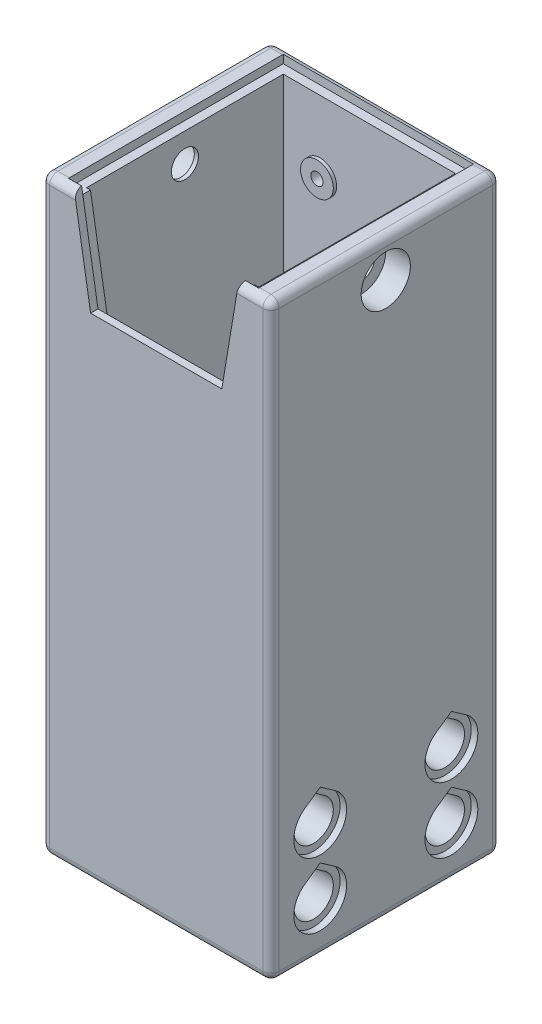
ISO-10303-21;
HEADER;
FILE_DESCRIPTION(('STEP AP214'),'2;1');
FILE_NAME('part.step','',(''),(''),'','','');
FILE_SCHEMA(('AUTOMOTIVE_DESIGN { 1 0 10303 214 1 1 1 1 }'));
ENDSEC;
DATA;
#1=APPLICATION_CONTEXT('core data for automotive mechanical design processes');
#2=APPLICATION_PROTOCOL_DEFINITION('international standard','automotive_design',2000,#1);
#3=PRODUCT_CONTEXT('',#1,'mechanical');
#4=PRODUCT('Part','Part','',(#3));
#5=PRODUCT_RELATED_PRODUCT_CATEGORY('part','',(#4));
#6=PRODUCT_DEFINITION_FORMATION('','',#4);
#7=PRODUCT_DEFINITION_CONTEXT('part definition',#1,'design');
#8=PRODUCT_DEFINITION('design','',#6,#7);
#9=PRODUCT_DEFINITION_SHAPE('','',#8);
#10=(LENGTH_UNIT() NAMED_UNIT(*) SI_UNIT(.MILLI.,.METRE.));
#11=(NAMED_UNIT(*) PLANE_ANGLE_UNIT() SI_UNIT($,.RADIAN.));
#12=(NAMED_UNIT(*) SI_UNIT($,.STERADIAN.) SOLID_ANGLE_UNIT());
#13=UNCERTAINTY_MEASURE_WITH_UNIT(LENGTH_MEASURE(1.E-05),#10,'distance_accuracy_value','');
#14=(GEOMETRIC_REPRESENTATION_CONTEXT(3) GLOBAL_UNCERTAINTY_ASSIGNED_CONTEXT((#13)) GLOBAL_UNIT_ASSIGNED_CONTEXT((#10,
#11,#12)) REPRESENTATION_CONTEXT('',''));
#15=CARTESIAN_POINT('',(0.,0.,0.));
#16=DIRECTION('',(0.,0.,1.));
#17=DIRECTION('',(1.,0.,0.));
#18=AXIS2_PLACEMENT_3D('',#15,#16,#17);
#19=CARTESIAN_POINT('',(0.,72.,0.));
#20=DIRECTION('',(0.,-1.,0.));
#21=DIRECTION('',(0.,0.,-1.));
#22=AXIS2_PLACEMENT_3D('',#19,#20,#21);
#23=PLANE('',#22);
#24=DIRECTION('',(0.,0.,-1.));
#25=VECTOR('',#24,1.);
#26=CARTESIAN_POINT('',(11.6,72.,-13.1));
#27=LINE('',#26,#25);
#28=CARTESIAN_POINT('',(11.6,72.,13.));
#29=VERTEX_POINT('',#28);
#30=CARTESIAN_POINT('',(11.6,72.,-13.));
#31=VERTEX_POINT('',#30);
#32=EDGE_CURVE('E1361',#29,#31,#27,.T.);
#33=ORIENTED_EDGE('',*,*,#32,.F.);
#34=DIRECTION('',(1.,0.,0.));
#35=VECTOR('',#34,1.);
#36=CARTESIAN_POINT('',(0.,72.,13.));
#37=LINE('',#36,#35);
#38=CARTESIAN_POINT('',(13.,72.,13.));
#39=VERTEX_POINT('',#38);
#40=EDGE_CURVE('E1515',#29,#39,#37,.T.);
#41=ORIENTED_EDGE('',*,*,#40,.T.);
#42=DIRECTION('',(0.,0.,-1.));
#43=VECTOR('',#42,1.);
#44=CARTESIAN_POINT('',(13.,72.,0.));
#45=LINE('',#44,#43);
#46=CARTESIAN_POINT('',(13.,72.,-13.));
#47=VERTEX_POINT('',#46);
#48=EDGE_CURVE('E1511',#39,#47,#45,.T.);
#49=ORIENTED_EDGE('',*,*,#48,.T.);
#50=DIRECTION('',(-1.,0.,0.));
#51=VECTOR('',#50,1.);
#52=CARTESIAN_POINT('',(0.,72.,-13.));
#53=LINE('',#52,#51);
#54=EDGE_CURVE('E1513',#47,#31,#53,.T.);
#55=ORIENTED_EDGE('',*,*,#54,.T.);
#56=EDGE_LOOP('',(#33,#41,#49,#55));
#57=FACE_BOUND('',#56,.T.);
#58=ADVANCED_FACE('F41',(#57),#23,.F.);
#59=CARTESIAN_POINT('',(-10.,72.,-11.3238075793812));
#60=DIRECTION('',(-0.986393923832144,-0.164398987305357,0.));
#61=DIRECTION('',(0.164398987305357,-0.986393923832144,0.));
#62=AXIS2_PLACEMENT_3D('',#59,#60,#61);
#63=PLANE('',#62);
#64=DIRECTION('',(-0.164398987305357,0.986393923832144,0.));
#65=VECTOR('',#64,1.);
#66=CARTESIAN_POINT('',(-10.,72.,13.1));
#67=LINE('',#66,#65);
#68=CARTESIAN_POINT('',(-8.,60.,13.1));
#69=VERTEX_POINT('',#68);
#70=CARTESIAN_POINT('',(-9.9991645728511,71.9949874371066,13.1));
#71=VERTEX_POINT('',#70);
#72=EDGE_CURVE('E1397',#69,#71,#67,.T.);
#73=ORIENTED_EDGE('',*,*,#72,.T.);
#74=CARTESIAN_POINT('',(-9.83333333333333,71.,13.));
#75=DIRECTION('',(-0.986393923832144,-0.164398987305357,0.));
#76=DIRECTION('',(0.164398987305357,-0.986393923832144,0.));
#77=AXIS2_PLACEMENT_3D('',#74,#75,#76);
#78=ELLIPSE('',#77,1.0137937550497,1.);
#79=CARTESIAN_POINT('',(-9.83333333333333,71.,14.));
#80=VERTEX_POINT('',#79);
#81=EDGE_CURVE('E1580',#71,#80,#78,.F.);
#82=ORIENTED_EDGE('',*,*,#81,.T.);
#83=DIRECTION('',(0.164398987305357,-0.986393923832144,0.));
#84=VECTOR('',#83,1.);
#85=CARTESIAN_POINT('',(-10.,72.,14.));
#86=LINE('',#85,#84);
#87=CARTESIAN_POINT('',(-8.,60.,14.));
#88=VERTEX_POINT('',#87);
#89=EDGE_CURVE('E1400',#80,#88,#86,.T.);
#90=ORIENTED_EDGE('',*,*,#89,.T.);
#91=DIRECTION('',(0.,0.,1.));
#92=VECTOR('',#91,1.);
#93=CARTESIAN_POINT('',(-8.,60.,-11.3238075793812));
#94=LINE('',#93,#92);
#95=EDGE_CURVE('E1408',#69,#88,#94,.T.);
#96=ORIENTED_EDGE('',*,*,#95,.F.);
#97=EDGE_LOOP('',(#73,#82,#90,#96));
#98=FACE_BOUND('',#97,.T.);
#99=ADVANCED_FACE('F1719',(#98),#63,.F.);
#100=CARTESIAN_POINT('',(10.,72.,-11.3238075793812));
#101=DIRECTION('',(0.986393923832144,-0.164398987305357,0.));
#102=DIRECTION('',(0.164398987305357,0.986393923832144,0.));
#103=AXIS2_PLACEMENT_3D('',#100,#101,#102);
#104=PLANE('',#103);
#105=DIRECTION('',(0.164398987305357,0.986393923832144,0.));
#106=VECTOR('',#105,1.);
#107=CARTESIAN_POINT('',(10.,72.,14.));
#108=LINE('',#107,#106);
#109=CARTESIAN_POINT('',(8.,60.,14.));
#110=VERTEX_POINT('',#109);
#111=CARTESIAN_POINT('',(9.83333333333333,71.,14.));
#112=VERTEX_POINT('',#111);
#113=EDGE_CURVE('E1405',#110,#112,#108,.T.);
#114=ORIENTED_EDGE('',*,*,#113,.T.);
#115=CARTESIAN_POINT('',(9.83333333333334,71.,13.));
#116=DIRECTION('',(0.986393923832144,-0.164398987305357,0.));
#117=DIRECTION('',(0.164398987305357,0.986393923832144,0.));
#118=AXIS2_PLACEMENT_3D('',#115,#116,#117);
#119=ELLIPSE('',#118,1.0137937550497,1.);
#120=CARTESIAN_POINT('',(9.9991645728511,71.9949874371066,13.1));
#121=VERTEX_POINT('',#120);
#122=EDGE_CURVE('E1528',#112,#121,#119,.F.);
#123=ORIENTED_EDGE('',*,*,#122,.T.);
#124=DIRECTION('',(-0.164398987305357,-0.986393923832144,0.));
#125=VECTOR('',#124,1.);
#126=CARTESIAN_POINT('',(10.,72.,13.1));
#127=LINE('',#126,#125);
#128=CARTESIAN_POINT('',(8.,60.,13.1));
#129=VERTEX_POINT('',#128);
#130=EDGE_CURVE('E1497',#121,#129,#127,.T.);
#131=ORIENTED_EDGE('',*,*,#130,.T.);
#132=DIRECTION('',(0.,0.,1.));
#133=VECTOR('',#132,1.);
#134=CARTESIAN_POINT('',(8.,60.,-11.3238075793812));
#135=LINE('',#134,#133);
#136=EDGE_CURVE('E1409',#129,#110,#135,.T.);
#137=ORIENTED_EDGE('',*,*,#136,.T.);
#138=EDGE_LOOP('',(#114,#123,#131,#137));
#139=FACE_BOUND('',#138,.T.);
#140=ADVANCED_FACE('F1726',(#139),#104,.F.);
#141=CARTESIAN_POINT('',(-8.,60.,-11.3238075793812));
#142=DIRECTION('',(0.,-1.,0.));
#143=DIRECTION('',(0.,0.,-1.));
#144=AXIS2_PLACEMENT_3D('',#141,#142,#143);
#145=PLANE('',#144);
#146=DIRECTION('',(1.,0.,0.));
#147=VECTOR('',#146,1.);
#148=CARTESIAN_POINT('',(8.,60.,13.1));
#149=LINE('',#148,#147);
#150=EDGE_CURVE('E1329',#69,#129,#149,.T.);
#151=ORIENTED_EDGE('',*,*,#150,.F.);
#152=ORIENTED_EDGE('',*,*,#95,.T.);
#153=DIRECTION('',(1.,0.,0.));
#154=VECTOR('',#153,1.);
#155=CARTESIAN_POINT('',(-8.,60.,14.));
#156=LINE('',#155,#154);
#157=EDGE_CURVE('E1402',#88,#110,#156,.T.);
#158=ORIENTED_EDGE('',*,*,#157,.T.);
#159=ORIENTED_EDGE('',*,*,#136,.F.);
#160=EDGE_LOOP('',(#151,#152,#158,#159));
#161=FACE_BOUND('',#160,.T.);
#162=ADVANCED_FACE('F1794',(#161),#145,.F.);
#163=CARTESIAN_POINT('',(-10.5,-12.890437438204,12.));
#164=DIRECTION('',(0.,0.,1.));
#165=DIRECTION('',(1.,0.,0.));
#166=AXIS2_PLACEMENT_3D('',#163,#164,#165);
#167=PLANE('',#166);
#168=DIRECTION('',(-1.,0.,0.));
#169=VECTOR('',#168,1.);
#170=CARTESIAN_POINT('',(-10.5,71.,12.));
#171=LINE('',#170,#169);
#172=CARTESIAN_POINT('',(-10.0166666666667,71.,12.));
#173=VERTEX_POINT('',#172);
#174=CARTESIAN_POINT('',(-10.5,71.,12.));
#175=VERTEX_POINT('',#174);
#176=EDGE_CURVE('E1391',#173,#175,#171,.T.);
#177=ORIENTED_EDGE('',*,*,#176,.F.);
#178=DIRECTION('',(-0.164398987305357,0.986393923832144,0.));
#179=VECTOR('',#178,1.);
#180=CARTESIAN_POINT('',(-8.,58.9,12.));
#181=LINE('',#180,#179);
#182=CARTESIAN_POINT('',(-8.,58.9,12.));
#183=VERTEX_POINT('',#182);
#184=EDGE_CURVE('E1333',#183,#173,#181,.T.);
#185=ORIENTED_EDGE('',*,*,#184,.F.);
#186=DIRECTION('',(-1.,0.,0.));
#187=VECTOR('',#186,1.);
#188=CARTESIAN_POINT('',(8.,58.9,12.));
#189=LINE('',#188,#187);
#190=CARTESIAN_POINT('',(8.,58.9,12.));
#191=VERTEX_POINT('',#190);
#192=EDGE_CURVE('E1344',#191,#183,#189,.T.);
#193=ORIENTED_EDGE('',*,*,#192,.F.);
#194=DIRECTION('',(-0.164398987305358,-0.986393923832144,0.));
#195=VECTOR('',#194,1.);
#196=CARTESIAN_POINT('',(8.,58.9,12.));
#197=LINE('',#196,#195);
#198=CARTESIAN_POINT('',(10.0166666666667,71.,12.));
#199=VERTEX_POINT('',#198);
#200=EDGE_CURVE('E1326',#199,#191,#197,.T.);
#201=ORIENTED_EDGE('',*,*,#200,.F.);
#202=CARTESIAN_POINT('',(10.5,71.,12.));
#203=VERTEX_POINT('',#202);
#204=EDGE_CURVE('E1379',#203,#199,#171,.T.);
#205=ORIENTED_EDGE('',*,*,#204,.F.);
#206=DIRECTION('',(0.,1.,0.));
#207=VECTOR('',#206,1.);
#208=CARTESIAN_POINT('',(10.5,-12.890437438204,12.));
#209=LINE('',#208,#207);
#210=CARTESIAN_POINT('',(10.5,28.,12.));
#211=VERTEX_POINT('',#210);
#212=EDGE_CURVE('E1440',#211,#203,#209,.T.);
#213=ORIENTED_EDGE('',*,*,#212,.F.);
#214=DIRECTION('',(1.,0.,0.));
#215=VECTOR('',#214,1.);
#216=CARTESIAN_POINT('',(-10.5,28.,12.));
#217=LINE('',#216,#215);
#218=CARTESIAN_POINT('',(-10.5,28.,12.));
#219=VERTEX_POINT('',#218);
#220=EDGE_CURVE('E1437',#219,#211,#217,.T.);
#221=ORIENTED_EDGE('',*,*,#220,.F.);
#222=DIRECTION('',(0.,1.,0.));
#223=VECTOR('',#222,1.);
#224=CARTESIAN_POINT('',(-10.5,-12.890437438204,12.));
#225=LINE('',#224,#223);
#226=EDGE_CURVE('E1444',#219,#175,#225,.T.);
#227=ORIENTED_EDGE('',*,*,#226,.T.);
#228=EDGE_LOOP('',(#177,#185,#193,#201,#205,#213,#221,#227));
#229=FACE_BOUND('',#228,.T.);
#230=ADVANCED_FACE('F2082',(#229),#167,.F.);
#231=CARTESIAN_POINT('',(10.5,-12.890437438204,-12.));
#232=DIRECTION('',(1.,0.,0.));
#233=DIRECTION('',(0.,0.,-1.));
#234=AXIS2_PLACEMENT_3D('',#231,#232,#233);
#235=PLANE('',#234);
#236=CARTESIAN_POINT('',(10.5,67.5,0.));
#237=DIRECTION('',(1.,0.,0.));
#238=DIRECTION('',(0.,0.,-1.));
#239=AXIS2_PLACEMENT_3D('',#236,#237,#238);
#240=CIRCLE('',#239,1.625);
#241=CARTESIAN_POINT('',(10.5,67.5,-1.625));
#242=VERTEX_POINT('',#241);
#243=EDGE_CURVE('E1313',#242,#242,#240,.F.);
#244=ORIENTED_EDGE('',*,*,#243,.F.);
#245=EDGE_LOOP('',(#244));
#246=FACE_BOUND('',#245,.T.);
#247=DIRECTION('',(0.,0.,1.));
#248=VECTOR('',#247,1.);
#249=CARTESIAN_POINT('',(10.5,71.,-12.));
#250=LINE('',#249,#248);
#251=CARTESIAN_POINT('',(10.5,71.,-12.));
#252=VERTEX_POINT('',#251);
#253=EDGE_CURVE('E1390',#252,#203,#250,.T.);
#254=ORIENTED_EDGE('',*,*,#253,.F.);
#255=DIRECTION('',(0.,1.,0.));
#256=VECTOR('',#255,1.);
#257=CARTESIAN_POINT('',(10.5,-12.890437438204,-12.));
#258=LINE('',#257,#256);
#259=CARTESIAN_POINT('',(10.5,28.,-12.));
#260=VERTEX_POINT('',#259);
#261=EDGE_CURVE('E1449',#260,#252,#258,.T.);
#262=ORIENTED_EDGE('',*,*,#261,.F.);
#263=DIRECTION('',(0.,0.,-1.));
#264=VECTOR('',#263,1.);
#265=CARTESIAN_POINT('',(10.5,28.,-12.));
#266=LINE('',#265,#264);
#267=EDGE_CURVE('E1450',#211,#260,#266,.T.);
#268=ORIENTED_EDGE('',*,*,#267,.F.);
#269=ORIENTED_EDGE('',*,*,#212,.T.);
#270=EDGE_LOOP('',(#254,#262,#268,#269));
#271=FACE_BOUND('',#270,.T.);
#272=ADVANCED_FACE('F2120',(#246,#271),#235,.F.);
#273=CARTESIAN_POINT('',(-10.5,-12.890437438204,-12.));
#274=DIRECTION('',(0.,0.,-1.));
#275=DIRECTION('',(-1.,0.,0.));
#276=AXIS2_PLACEMENT_3D('',#273,#274,#275);
#277=PLANE('',#276);
#278=CARTESIAN_POINT('',(6.,62.4,-12.));
#279=DIRECTION('',(0.,0.,-1.));
#280=DIRECTION('',(-1.,0.,0.));
#281=AXIS2_PLACEMENT_3D('',#278,#279,#280);
#282=CIRCLE('',#281,2.);
#283=CARTESIAN_POINT('',(4.,62.4,-12.));
#284=VERTEX_POINT('',#283);
#285=EDGE_CURVE('E1502',#284,#284,#282,.F.);
#286=ORIENTED_EDGE('',*,*,#285,.F.);
#287=EDGE_LOOP('',(#286));
#288=FACE_BOUND('',#287,.T.);
#289=CARTESIAN_POINT('',(-6.,62.4,-12.));
#290=DIRECTION('',(0.,0.,-1.));
#291=DIRECTION('',(-1.,0.,0.));
#292=AXIS2_PLACEMENT_3D('',#289,#290,#291);
#293=CIRCLE('',#292,2.);
#294=CARTESIAN_POINT('',(-8.,62.4,-12.));
#295=VERTEX_POINT('',#294);
#296=EDGE_CURVE('E1499',#295,#295,#293,.F.);
#297=ORIENTED_EDGE('',*,*,#296,.F.);
#298=EDGE_LOOP('',(#297));
#299=FACE_BOUND('',#298,.T.);
#300=DIRECTION('',(1.,0.,0.));
#301=VECTOR('',#300,1.);
#302=CARTESIAN_POINT('',(-10.5,71.,-12.));
#303=LINE('',#302,#301);
#304=CARTESIAN_POINT('',(-10.5,71.,-12.));
#305=VERTEX_POINT('',#304);
#306=EDGE_CURVE('E1393',#305,#252,#303,.T.);
#307=ORIENTED_EDGE('',*,*,#306,.F.);
#308=DIRECTION('',(0.,1.,0.));
#309=VECTOR('',#308,1.);
#310=CARTESIAN_POINT('',(-10.5,-12.890437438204,-12.));
#311=LINE('',#310,#309);
#312=CARTESIAN_POINT('',(-10.5,28.,-12.));
#313=VERTEX_POINT('',#312);
#314=EDGE_CURVE('E1445',#313,#305,#311,.T.);
#315=ORIENTED_EDGE('',*,*,#314,.F.);
#316=DIRECTION('',(-1.,0.,0.));
#317=VECTOR('',#316,1.);
#318=CARTESIAN_POINT('',(-10.5,28.,-12.));
#319=LINE('',#318,#317);
#320=EDGE_CURVE('E1446',#260,#313,#319,.T.);
#321=ORIENTED_EDGE('',*,*,#320,.F.);
#322=ORIENTED_EDGE('',*,*,#261,.T.);
#323=EDGE_LOOP('',(#307,#315,#321,#322));
#324=FACE_BOUND('',#323,.T.);
#325=ADVANCED_FACE('F2116',(#288,#299,#324),#277,.F.);
#326=CARTESIAN_POINT('',(-10.5,-12.890437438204,-12.));
#327=DIRECTION('',(-1.,0.,0.));
#328=DIRECTION('',(0.,0.,1.));
#329=AXIS2_PLACEMENT_3D('',#326,#327,#328);
#330=PLANE('',#329);
#331=CARTESIAN_POINT('',(-10.5,67.5,0.));
#332=DIRECTION('',(-1.,0.,0.));
#333=DIRECTION('',(0.,0.,1.));
#334=AXIS2_PLACEMENT_3D('',#331,#332,#333);
#335=CIRCLE('',#334,1.65);
#336=CARTESIAN_POINT('',(-10.5,67.5,1.65));
#337=VERTEX_POINT('',#336);
#338=EDGE_CURVE('E1307',#337,#337,#335,.F.);
#339=ORIENTED_EDGE('',*,*,#338,.F.);
#340=EDGE_LOOP('',(#339));
#341=FACE_BOUND('',#340,.T.);
#342=DIRECTION('',(0.,0.,-1.));
#343=VECTOR('',#342,1.);
#344=CARTESIAN_POINT('',(-10.5,71.,-12.));
#345=LINE('',#344,#343);
#346=EDGE_CURVE('E1395',#175,#305,#345,.T.);
#347=ORIENTED_EDGE('',*,*,#346,.F.);
#348=ORIENTED_EDGE('',*,*,#226,.F.);
#349=DIRECTION('',(0.,0.,1.));
#350=VECTOR('',#349,1.);
#351=CARTESIAN_POINT('',(-10.5,28.,-12.));
#352=LINE('',#351,#350);
#353=EDGE_CURVE('E1441',#313,#219,#352,.T.);
#354=ORIENTED_EDGE('',*,*,#353,.F.);
#355=ORIENTED_EDGE('',*,*,#314,.T.);
#356=EDGE_LOOP('',(#347,#348,#354,#355));
#357=FACE_BOUND('',#356,.T.);
#358=ADVANCED_FACE('F2112',(#341,#357),#330,.F.);
#359=CARTESIAN_POINT('',(-14.,72.,-14.));
#360=DIRECTION('',(1.,0.,0.));
#361=DIRECTION('',(0.,0.,-1.));
#362=AXIS2_PLACEMENT_3D('',#359,#360,#361);
#363=PLANE('',#362);
#364=DIRECTION('',(0.,0.573576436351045,0.819152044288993));
#365=VECTOR('',#364,1.);
#366=CARTESIAN_POINT('',(-14.,17.9369980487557,-8.));
#367=LINE('',#366,#365);
#368=CARTESIAN_POINT('',(-14.,16.641765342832,-9.84978400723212));
#369=VERTEX_POINT('',#368);
#370=CARTESIAN_POINT('',(-14.,17.9369980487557,-8.));
#371=VERTEX_POINT('',#370);
#372=EDGE_CURVE('E846',#369,#371,#367,.T.);
#373=ORIENTED_EDGE('',*,*,#372,.T.);
#374=DIRECTION('',(0.,-0.573576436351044,0.819152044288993));
#375=VECTOR('',#374,1.);
#376=CARTESIAN_POINT('',(-14.,17.9369980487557,-8.));
#377=LINE('',#376,#375);
#378=CARTESIAN_POINT('',(-14.,16.641765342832,-6.15021599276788));
#379=VERTEX_POINT('',#378);
#380=EDGE_CURVE('E841',#371,#379,#377,.T.);
#381=ORIENTED_EDGE('',*,*,#380,.T.);
#382=CARTESIAN_POINT('',(-14.,14.,-8.));
#383=DIRECTION('',(1.,0.,0.));
#384=DIRECTION('',(0.,0.,-1.));
#385=AXIS2_PLACEMENT_3D('',#382,#383,#384);
#386=CIRCLE('',#385,3.225);
#387=EDGE_CURVE('E849',#379,#369,#386,.T.);
#388=ORIENTED_EDGE('',*,*,#387,.T.);
#389=EDGE_LOOP('',(#373,#381,#388));
#390=FACE_BOUND('',#389,.T.);
#391=DIRECTION('',(0.,0.573576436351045,0.819152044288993));
#392=VECTOR('',#391,1.);
#393=CARTESIAN_POINT('',(-14.,9.93699804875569,8.));
#394=LINE('',#393,#392);
#395=CARTESIAN_POINT('',(-14.,8.641765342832,6.15021599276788));
#396=VERTEX_POINT('',#395);
#397=CARTESIAN_POINT('',(-14.,9.93699804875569,8.));
#398=VERTEX_POINT('',#397);
#399=EDGE_CURVE('E832',#396,#398,#394,.T.);
#400=ORIENTED_EDGE('',*,*,#399,.T.);
#401=DIRECTION('',(0.,-0.573576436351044,0.819152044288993));
#402=VECTOR('',#401,1.);
#403=CARTESIAN_POINT('',(-14.,9.93699804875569,8.));
#404=LINE('',#403,#402);
#405=CARTESIAN_POINT('',(-14.,8.641765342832,9.84978400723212));
#406=VERTEX_POINT('',#405);
#407=EDGE_CURVE('E867',#398,#406,#404,.T.);
#408=ORIENTED_EDGE('',*,*,#407,.T.);
#409=CARTESIAN_POINT('',(-14.,6.,8.));
#410=DIRECTION('',(1.,0.,0.));
#411=DIRECTION('',(0.,0.,-1.));
#412=AXIS2_PLACEMENT_3D('',#409,#410,#411);
#413=CIRCLE('',#412,3.225);
#414=EDGE_CURVE('E874',#406,#396,#413,.T.);
#415=ORIENTED_EDGE('',*,*,#414,.T.);
#416=EDGE_LOOP('',(#400,#408,#415));
#417=FACE_BOUND('',#416,.T.);
#418=DIRECTION('',(0.,0.573576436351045,0.819152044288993));
#419=VECTOR('',#418,1.);
#420=CARTESIAN_POINT('',(-14.,17.9369980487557,8.));
#421=LINE('',#420,#419);
#422=CARTESIAN_POINT('',(-14.,16.641765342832,6.15021599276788));
#423=VERTEX_POINT('',#422);
#424=CARTESIAN_POINT('',(-14.,17.9369980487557,8.));
#425=VERTEX_POINT('',#424);
#426=EDGE_CURVE('E812',#423,#425,#421,.T.);
#427=ORIENTED_EDGE('',*,*,#426,.T.);
#428=DIRECTION('',(0.,-0.573576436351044,0.819152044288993));
#429=VECTOR('',#428,1.);
#430=CARTESIAN_POINT('',(-14.,17.9369980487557,8.));
#431=LINE('',#430,#429);
#432=CARTESIAN_POINT('',(-14.,16.641765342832,9.84978400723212));
#433=VERTEX_POINT('',#432);
#434=EDGE_CURVE('E817',#425,#433,#431,.T.);
#435=ORIENTED_EDGE('',*,*,#434,.T.);
#436=CARTESIAN_POINT('',(-14.,14.,8.));
#437=DIRECTION('',(1.,0.,0.));
#438=DIRECTION('',(0.,0.,-1.));
#439=AXIS2_PLACEMENT_3D('',#436,#437,#438);
#440=CIRCLE('',#439,3.225);
#441=EDGE_CURVE('E824',#433,#423,#440,.T.);
#442=ORIENTED_EDGE('',*,*,#441,.T.);
#443=EDGE_LOOP('',(#427,#435,#442));
#444=FACE_BOUND('',#443,.T.);
#445=DIRECTION('',(0.,0.573576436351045,0.819152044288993));
#446=VECTOR('',#445,1.);
#447=CARTESIAN_POINT('',(-14.,9.93699804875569,-8.));
#448=LINE('',#447,#446);
#449=CARTESIAN_POINT('',(-14.,8.641765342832,-9.84978400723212));
#450=VERTEX_POINT('',#449);
#451=CARTESIAN_POINT('',(-14.,9.93699804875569,-8.));
#452=VERTEX_POINT('',#451);
#453=EDGE_CURVE('E858',#450,#452,#448,.T.);
#454=ORIENTED_EDGE('',*,*,#453,.T.);
#455=DIRECTION('',(0.,-0.573576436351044,0.819152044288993));
#456=VECTOR('',#455,1.);
#457=CARTESIAN_POINT('',(-14.,9.93699804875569,-8.));
#458=LINE('',#457,#456);
#459=CARTESIAN_POINT('',(-14.,8.641765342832,-6.15021599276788));
#460=VERTEX_POINT('',#459);
#461=EDGE_CURVE('E889',#452,#460,#458,.T.);
#462=ORIENTED_EDGE('',*,*,#461,.T.);
#463=CARTESIAN_POINT('',(-14.,6.,-8.));
#464=DIRECTION('',(1.,0.,0.));
#465=DIRECTION('',(0.,0.,-1.));
#466=AXIS2_PLACEMENT_3D('',#463,#464,#465);
#467=CIRCLE('',#466,3.225);
#468=EDGE_CURVE('E896',#460,#450,#467,.T.);
#469=ORIENTED_EDGE('',*,*,#468,.T.);
#470=EDGE_LOOP('',(#454,#462,#469));
#471=FACE_BOUND('',#470,.T.);
#472=DIRECTION('',(0.,-1.,0.));
#473=VECTOR('',#472,1.);
#474=CARTESIAN_POINT('',(-14.,72.,-13.));
#475=LINE('',#474,#473);
#476=CARTESIAN_POINT('',(-14.,71.,-13.));
#477=VERTEX_POINT('',#476);
#478=CARTESIAN_POINT('',(-14.,1.,-13.));
#479=VERTEX_POINT('',#478);
#480=EDGE_CURVE('E1560',#477,#479,#475,.T.);
#481=ORIENTED_EDGE('',*,*,#480,.T.);
#482=DIRECTION('',(0.,0.,1.));
#483=VECTOR('',#482,1.);
#484=CARTESIAN_POINT('',(-14.,1.,14.));
#485=LINE('',#484,#483);
#486=CARTESIAN_POINT('',(-14.,1.,13.));
#487=VERTEX_POINT('',#486);
#488=EDGE_CURVE('E1562',#479,#487,#485,.T.);
#489=ORIENTED_EDGE('',*,*,#488,.T.);
#490=DIRECTION('',(0.,-1.,0.));
#491=VECTOR('',#490,1.);
#492=CARTESIAN_POINT('',(-14.,72.,13.));
#493=LINE('',#492,#491);
#494=CARTESIAN_POINT('',(-14.,71.,13.));
#495=VERTEX_POINT('',#494);
#496=EDGE_CURVE('E1556',#487,#495,#493,.F.);
#497=ORIENTED_EDGE('',*,*,#496,.T.);
#498=DIRECTION('',(0.,0.,1.));
#499=VECTOR('',#498,1.);
#500=CARTESIAN_POINT('',(-14.,71.,-14.));
#501=LINE('',#500,#499);
#502=EDGE_CURVE('E1558',#495,#477,#501,.F.);
#503=ORIENTED_EDGE('',*,*,#502,.T.);
#504=EDGE_LOOP('',(#481,#489,#497,#503));
#505=FACE_BOUND('',#504,.T.);
#506=CARTESIAN_POINT('',(-14.,67.5,0.));
#507=DIRECTION('',(-1.,0.,0.));
#508=DIRECTION('',(0.,0.,1.));
#509=AXIS2_PLACEMENT_3D('',#506,#507,#508);
#510=CIRCLE('',#509,3.);
#511=CARTESIAN_POINT('',(-14.,67.5,3.));
#512=VERTEX_POINT('',#511);
#513=EDGE_CURVE('E1320',#512,#512,#510,.T.);
#514=ORIENTED_EDGE('',*,*,#513,.F.);
#515=EDGE_LOOP('',(#514));
#516=FACE_BOUND('',#515,.T.);
#517=ADVANCED_FACE('F2115',(#390,#417,#444,#471,#505,#516),#363,.F.);
#518=CARTESIAN_POINT('',(14.,72.,14.));
#519=DIRECTION('',(0.,0.,-1.));
#520=DIRECTION('',(-1.,0.,0.));
#521=AXIS2_PLACEMENT_3D('',#518,#519,#520);
#522=PLANE('',#521);
#523=DIRECTION('',(0.,-1.,0.));
#524=VECTOR('',#523,1.);
#525=CARTESIAN_POINT('',(13.,72.,14.));
#526=LINE('',#525,#524);
#527=CARTESIAN_POINT('',(13.,1.,14.));
#528=VERTEX_POINT('',#527);
#529=CARTESIAN_POINT('',(13.,71.,14.));
#530=VERTEX_POINT('',#529);
#531=EDGE_CURVE('E1524',#528,#530,#526,.F.);
#532=ORIENTED_EDGE('',*,*,#531,.T.);
#533=DIRECTION('',(1.,0.,0.));
#534=VECTOR('',#533,1.);
#535=CARTESIAN_POINT('',(14.,71.,14.));
#536=LINE('',#535,#534);
#537=EDGE_CURVE('E1526',#530,#112,#536,.F.);
#538=ORIENTED_EDGE('',*,*,#537,.T.);
#539=ORIENTED_EDGE('',*,*,#113,.F.);
#540=ORIENTED_EDGE('',*,*,#157,.F.);
#541=ORIENTED_EDGE('',*,*,#89,.F.);
#542=DIRECTION('',(1.,0.,0.));
#543=VECTOR('',#542,1.);
#544=CARTESIAN_POINT('',(14.,71.,14.));
#545=LINE('',#544,#543);
#546=CARTESIAN_POINT('',(-13.,71.,14.));
#547=VERTEX_POINT('',#546);
#548=EDGE_CURVE('E1520',#80,#547,#545,.F.);
#549=ORIENTED_EDGE('',*,*,#548,.T.);
#550=DIRECTION('',(0.,-1.,0.));
#551=VECTOR('',#550,1.);
#552=CARTESIAN_POINT('',(-13.,72.,14.));
#553=LINE('',#552,#551);
#554=CARTESIAN_POINT('',(-13.,1.,14.));
#555=VERTEX_POINT('',#554);
#556=EDGE_CURVE('E1518',#547,#555,#553,.T.);
#557=ORIENTED_EDGE('',*,*,#556,.T.);
#558=DIRECTION('',(1.,0.,0.));
#559=VECTOR('',#558,1.);
#560=CARTESIAN_POINT('',(14.,1.,14.));
#561=LINE('',#560,#559);
#562=EDGE_CURVE('E1522',#555,#528,#561,.T.);
#563=ORIENTED_EDGE('',*,*,#562,.T.);
#564=EDGE_LOOP('',(#532,#538,#539,#540,#541,#549,#557,#563));
#565=FACE_BOUND('',#564,.T.);
#566=ADVANCED_FACE('F1781',(#565),#522,.F.);
#567=CARTESIAN_POINT('',(14.,72.,-14.));
#568=DIRECTION('',(-1.,0.,0.));
#569=DIRECTION('',(0.,0.,1.));
#570=AXIS2_PLACEMENT_3D('',#567,#568,#569);
#571=PLANE('',#570);
#572=DIRECTION('',(0.,-0.573576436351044,0.819152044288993));
#573=VECTOR('',#572,1.);
#574=CARTESIAN_POINT('',(14.,17.9369980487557,-8.));
#575=LINE('',#574,#573);
#576=CARTESIAN_POINT('',(14.,17.9369980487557,-8.));
#577=VERTEX_POINT('',#576);
#578=CARTESIAN_POINT('',(14.,16.641765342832,-6.15021599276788));
#579=VERTEX_POINT('',#578);
#580=EDGE_CURVE('E1054',#577,#579,#575,.T.);
#581=ORIENTED_EDGE('',*,*,#580,.F.);
#582=DIRECTION('',(0.,0.573576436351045,0.819152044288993));
#583=VECTOR('',#582,1.);
#584=CARTESIAN_POINT('',(14.,17.9369980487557,-8.));
#585=LINE('',#584,#583);
#586=CARTESIAN_POINT('',(14.,16.641765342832,-9.84978400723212));
#587=VERTEX_POINT('',#586);
#588=EDGE_CURVE('E1052',#587,#577,#585,.T.);
#589=ORIENTED_EDGE('',*,*,#588,.F.);
#590=CARTESIAN_POINT('',(14.,14.,-8.));
#591=DIRECTION('',(1.,0.,0.));
#592=DIRECTION('',(0.,0.,-1.));
#593=AXIS2_PLACEMENT_3D('',#590,#591,#592);
#594=CIRCLE('',#593,3.225);
#595=EDGE_CURVE('E1045',#579,#587,#594,.T.);
#596=ORIENTED_EDGE('',*,*,#595,.F.);
#597=EDGE_LOOP('',(#581,#589,#596));
#598=FACE_BOUND('',#597,.T.);
#599=DIRECTION('',(0.,-0.573576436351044,0.819152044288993));
#600=VECTOR('',#599,1.);
#601=CARTESIAN_POINT('',(14.,9.93699804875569,8.));
#602=LINE('',#601,#600);
#603=CARTESIAN_POINT('',(14.,9.93699804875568,8.));
#604=VERTEX_POINT('',#603);
#605=CARTESIAN_POINT('',(14.,8.641765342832,9.84978400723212));
#606=VERTEX_POINT('',#605);
#607=EDGE_CURVE('E1080',#604,#606,#602,.T.);
#608=ORIENTED_EDGE('',*,*,#607,.F.);
#609=DIRECTION('',(0.,0.573576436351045,0.819152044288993));
#610=VECTOR('',#609,1.);
#611=CARTESIAN_POINT('',(14.,9.93699804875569,8.));
#612=LINE('',#611,#610);
#613=CARTESIAN_POINT('',(14.,8.641765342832,6.15021599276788));
#614=VERTEX_POINT('',#613);
#615=EDGE_CURVE('E1078',#614,#604,#612,.T.);
#616=ORIENTED_EDGE('',*,*,#615,.F.);
#617=CARTESIAN_POINT('',(14.,6.,8.));
#618=DIRECTION('',(1.,0.,0.));
#619=DIRECTION('',(0.,0.,-1.));
#620=AXIS2_PLACEMENT_3D('',#617,#618,#619);
#621=CIRCLE('',#620,3.225);
#622=EDGE_CURVE('E1071',#606,#614,#621,.T.);
#623=ORIENTED_EDGE('',*,*,#622,.F.);
#624=EDGE_LOOP('',(#608,#616,#623));
#625=FACE_BOUND('',#624,.T.);
#626=DIRECTION('',(0.,-0.573576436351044,0.819152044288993));
#627=VECTOR('',#626,1.);
#628=CARTESIAN_POINT('',(14.,17.9369980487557,8.));
#629=LINE('',#628,#627);
#630=CARTESIAN_POINT('',(14.,17.9369980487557,8.));
#631=VERTEX_POINT('',#630);
#632=CARTESIAN_POINT('',(14.,16.641765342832,9.84978400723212));
#633=VERTEX_POINT('',#632);
#634=EDGE_CURVE('E1103',#631,#633,#629,.T.);
#635=ORIENTED_EDGE('',*,*,#634,.F.);
#636=DIRECTION('',(0.,0.573576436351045,0.819152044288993));
#637=VECTOR('',#636,1.);
#638=CARTESIAN_POINT('',(14.,17.9369980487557,8.));
#639=LINE('',#638,#637);
#640=CARTESIAN_POINT('',(14.,16.641765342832,6.15021599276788));
#641=VERTEX_POINT('',#640);
#642=EDGE_CURVE('E1040',#641,#631,#639,.T.);
#643=ORIENTED_EDGE('',*,*,#642,.F.);
#644=CARTESIAN_POINT('',(14.,14.,8.));
#645=DIRECTION('',(1.,0.,0.));
#646=DIRECTION('',(0.,0.,-1.));
#647=AXIS2_PLACEMENT_3D('',#644,#645,#646);
#648=CIRCLE('',#647,3.225);
#649=EDGE_CURVE('E1095',#633,#641,#648,.T.);
#650=ORIENTED_EDGE('',*,*,#649,.F.);
#651=EDGE_LOOP('',(#635,#643,#650));
#652=FACE_BOUND('',#651,.T.);
#653=DIRECTION('',(0.,-0.573576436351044,0.819152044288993));
#654=VECTOR('',#653,1.);
#655=CARTESIAN_POINT('',(14.,9.93699804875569,-8.));
#656=LINE('',#655,#654);
#657=CARTESIAN_POINT('',(14.,9.93699804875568,-8.));
#658=VERTEX_POINT('',#657);
#659=CARTESIAN_POINT('',(14.,8.641765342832,-6.15021599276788));
#660=VERTEX_POINT('',#659);
#661=EDGE_CURVE('E1189',#658,#660,#656,.T.);
#662=ORIENTED_EDGE('',*,*,#661,.F.);
#663=DIRECTION('',(0.,0.573576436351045,0.819152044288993));
#664=VECTOR('',#663,1.);
#665=CARTESIAN_POINT('',(14.,9.93699804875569,-8.));
#666=LINE('',#665,#664);
#667=CARTESIAN_POINT('',(14.,8.641765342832,-9.84978400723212));
#668=VERTEX_POINT('',#667);
#669=EDGE_CURVE('E1176',#668,#658,#666,.T.);
#670=ORIENTED_EDGE('',*,*,#669,.F.);
#671=CARTESIAN_POINT('',(14.,6.,-8.));
#672=DIRECTION('',(1.,0.,0.));
#673=DIRECTION('',(0.,0.,-1.));
#674=AXIS2_PLACEMENT_3D('',#671,#672,#673);
#675=CIRCLE('',#674,3.225);
#676=EDGE_CURVE('E1181',#660,#668,#675,.T.);
#677=ORIENTED_EDGE('',*,*,#676,.F.);
#678=EDGE_LOOP('',(#662,#670,#677));
#679=FACE_BOUND('',#678,.T.);
#680=DIRECTION('',(0.,-1.,0.));
#681=VECTOR('',#680,1.);
#682=CARTESIAN_POINT('',(14.,72.,13.));
#683=LINE('',#682,#681);
#684=CARTESIAN_POINT('',(14.,71.,13.));
#685=VERTEX_POINT('',#684);
#686=CARTESIAN_POINT('',(14.,1.,13.));
#687=VERTEX_POINT('',#686);
#688=EDGE_CURVE('E1569',#685,#687,#683,.T.);
#689=ORIENTED_EDGE('',*,*,#688,.T.);
#690=DIRECTION('',(0.,0.,-1.));
#691=VECTOR('',#690,1.);
#692=CARTESIAN_POINT('',(14.,1.,-14.));
#693=LINE('',#692,#691);
#694=CARTESIAN_POINT('',(14.,1.,-13.));
#695=VERTEX_POINT('',#694);
#696=EDGE_CURVE('E1571',#687,#695,#693,.T.);
#697=ORIENTED_EDGE('',*,*,#696,.T.);
#698=DIRECTION('',(0.,-1.,0.));
#699=VECTOR('',#698,1.);
#700=CARTESIAN_POINT('',(14.,72.,-13.));
#701=LINE('',#700,#699);
#702=CARTESIAN_POINT('',(14.,71.,-13.));
#703=VERTEX_POINT('',#702);
#704=EDGE_CURVE('E1567',#695,#703,#701,.F.);
#705=ORIENTED_EDGE('',*,*,#704,.T.);
#706=DIRECTION('',(0.,0.,-1.));
#707=VECTOR('',#706,1.);
#708=CARTESIAN_POINT('',(14.,71.,-14.));
#709=LINE('',#708,#707);
#710=EDGE_CURVE('E1565',#703,#685,#709,.F.);
#711=ORIENTED_EDGE('',*,*,#710,.T.);
#712=EDGE_LOOP('',(#689,#697,#705,#711));
#713=FACE_BOUND('',#712,.T.);
#714=CARTESIAN_POINT('',(14.,67.5,0.));
#715=DIRECTION('',(1.,0.,0.));
#716=DIRECTION('',(0.,0.,-1.));
#717=AXIS2_PLACEMENT_3D('',#714,#715,#716);
#718=CIRCLE('',#717,3.);
#719=CARTESIAN_POINT('',(14.,67.5,-3.00000000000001));
#720=VERTEX_POINT('',#719);
#721=EDGE_CURVE('E1316',#720,#720,#718,.T.);
#722=ORIENTED_EDGE('',*,*,#721,.F.);
#723=EDGE_LOOP('',(#722));
#724=FACE_BOUND('',#723,.T.);
#725=ADVANCED_FACE('F1742',(#598,#625,#652,#679,#713,#724),#571,.F.);
#726=CARTESIAN_POINT('',(14.,72.,-14.));
#727=DIRECTION('',(0.,0.,1.));
#728=DIRECTION('',(1.,0.,0.));
#729=AXIS2_PLACEMENT_3D('',#726,#727,#728);
#730=PLANE('',#729);
#731=DIRECTION('',(0.,-1.,0.));
#732=VECTOR('',#731,1.);
#733=CARTESIAN_POINT('',(13.,72.,-14.));
#734=LINE('',#733,#732);
#735=CARTESIAN_POINT('',(13.,71.,-14.));
#736=VERTEX_POINT('',#735);
#737=CARTESIAN_POINT('',(13.,1.,-14.));
#738=VERTEX_POINT('',#737);
#739=EDGE_CURVE('E1542',#736,#738,#734,.T.);
#740=ORIENTED_EDGE('',*,*,#739,.T.);
#741=DIRECTION('',(-1.,0.,0.));
#742=VECTOR('',#741,1.);
#743=CARTESIAN_POINT('',(-14.,1.,-14.));
#744=LINE('',#743,#742);
#745=CARTESIAN_POINT('',(-13.,1.,-14.));
#746=VERTEX_POINT('',#745);
#747=EDGE_CURVE('E1544',#738,#746,#744,.T.);
#748=ORIENTED_EDGE('',*,*,#747,.T.);
#749=DIRECTION('',(0.,-1.,0.));
#750=VECTOR('',#749,1.);
#751=CARTESIAN_POINT('',(-13.,72.,-14.));
#752=LINE('',#751,#750);
#753=CARTESIAN_POINT('',(-13.,71.,-14.));
#754=VERTEX_POINT('',#753);
#755=EDGE_CURVE('E1540',#746,#754,#752,.F.);
#756=ORIENTED_EDGE('',*,*,#755,.T.);
#757=DIRECTION('',(-1.,0.,0.));
#758=VECTOR('',#757,1.);
#759=CARTESIAN_POINT('',(14.,71.,-14.));
#760=LINE('',#759,#758);
#761=EDGE_CURVE('E1538',#754,#736,#760,.F.);
#762=ORIENTED_EDGE('',*,*,#761,.T.);
#763=EDGE_LOOP('',(#740,#748,#756,#762));
#764=FACE_BOUND('',#763,.T.);
#765=ADVANCED_FACE('F1734',(#764),#730,.F.);
#766=DIRECTION('',(0.,0.,1.));
#767=VECTOR('',#766,1.);
#768=CARTESIAN_POINT('',(-11.6,72.,-13.1));
#769=LINE('',#768,#767);
#770=CARTESIAN_POINT('',(-11.6,72.,-13.));
#771=VERTEX_POINT('',#770);
#772=CARTESIAN_POINT('',(-11.6,72.,13.));
#773=VERTEX_POINT('',#772);
#774=EDGE_CURVE('E1351',#771,#773,#769,.T.);
#775=ORIENTED_EDGE('',*,*,#774,.F.);
#776=DIRECTION('',(-1.,0.,0.));
#777=VECTOR('',#776,1.);
#778=CARTESIAN_POINT('',(0.,72.,-13.));
#779=LINE('',#778,#777);
#780=CARTESIAN_POINT('',(-13.,72.,-13.));
#781=VERTEX_POINT('',#780);
#782=EDGE_CURVE('E1509',#771,#781,#779,.T.);
#783=ORIENTED_EDGE('',*,*,#782,.T.);
#784=DIRECTION('',(0.,0.,1.));
#785=VECTOR('',#784,1.);
#786=CARTESIAN_POINT('',(-13.,72.,0.));
#787=LINE('',#786,#785);
#788=CARTESIAN_POINT('',(-13.,72.,13.));
#789=VERTEX_POINT('',#788);
#790=EDGE_CURVE('E1505',#781,#789,#787,.T.);
#791=ORIENTED_EDGE('',*,*,#790,.T.);
#792=DIRECTION('',(1.,0.,0.));
#793=VECTOR('',#792,1.);
#794=CARTESIAN_POINT('',(0.,72.,13.));
#795=LINE('',#794,#793);
#796=EDGE_CURVE('E1507',#789,#773,#795,.T.);
#797=ORIENTED_EDGE('',*,*,#796,.T.);
#798=EDGE_LOOP('',(#775,#783,#791,#797));
#799=FACE_BOUND('',#798,.T.);
#800=ADVANCED_FACE('F1722',(#799),#23,.F.);
#801=CARTESIAN_POINT('',(0.,0.,0.));
#802=DIRECTION('',(0.,-1.,0.));
#803=DIRECTION('',(0.,0.,-1.));
#804=AXIS2_PLACEMENT_3D('',#801,#802,#803);
#805=PLANE('',#804);
#806=DIRECTION('',(0.,0.,1.));
#807=VECTOR('',#806,1.);
#808=CARTESIAN_POINT('',(-13.,0.,-14.));
#809=LINE('',#808,#807);
#810=CARTESIAN_POINT('',(-13.,0.,13.));
#811=VERTEX_POINT('',#810);
#812=CARTESIAN_POINT('',(-13.,0.,-13.));
#813=VERTEX_POINT('',#812);
#814=EDGE_CURVE('E1551',#811,#813,#809,.F.);
#815=ORIENTED_EDGE('',*,*,#814,.T.);
#816=DIRECTION('',(-1.,0.,0.));
#817=VECTOR('',#816,1.);
#818=CARTESIAN_POINT('',(14.,0.,-13.));
#819=LINE('',#818,#817);
#820=CARTESIAN_POINT('',(13.,0.,-13.));
#821=VERTEX_POINT('',#820);
#822=EDGE_CURVE('E1553',#813,#821,#819,.F.);
#823=ORIENTED_EDGE('',*,*,#822,.T.);
#824=DIRECTION('',(0.,0.,-1.));
#825=VECTOR('',#824,1.);
#826=CARTESIAN_POINT('',(13.,0.,14.));
#827=LINE('',#826,#825);
#828=CARTESIAN_POINT('',(13.,0.,13.));
#829=VERTEX_POINT('',#828);
#830=EDGE_CURVE('E1547',#821,#829,#827,.F.);
#831=ORIENTED_EDGE('',*,*,#830,.T.);
#832=DIRECTION('',(1.,0.,0.));
#833=VECTOR('',#832,1.);
#834=CARTESIAN_POINT('',(-14.,0.,13.));
#835=LINE('',#834,#833);
#836=EDGE_CURVE('E1549',#829,#811,#835,.F.);
#837=ORIENTED_EDGE('',*,*,#836,.T.);
#838=EDGE_LOOP('',(#815,#823,#831,#837));
#839=FACE_BOUND('',#838,.T.);
#840=CARTESIAN_POINT('',(0.,0.,-8.));
#841=DIRECTION('',(0.,1.,0.));
#842=DIRECTION('',(-1.,0.,0.));
#843=AXIS2_PLACEMENT_3D('',#840,#841,#842);
#844=CIRCLE('',#843,3.05);
#845=CARTESIAN_POINT('',(-3.05000000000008,0.,-7.99999999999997));
#846=VERTEX_POINT('',#845);
#847=EDGE_CURVE('E1213',#846,#846,#844,.T.);
#848=ORIENTED_EDGE('',*,*,#847,.T.);
#849=EDGE_LOOP('',(#848));
#850=FACE_BOUND('',#849,.T.);
#851=CARTESIAN_POINT('',(8.,0.,0.));
#852=DIRECTION('',(0.,1.,0.));
#853=DIRECTION('',(0.,0.,-1.));
#854=AXIS2_PLACEMENT_3D('',#851,#852,#853);
#855=CIRCLE('',#854,3.05);
#856=CARTESIAN_POINT('',(8.,0.,-3.05));
#857=VERTEX_POINT('',#856);
#858=EDGE_CURVE('E1232',#857,#857,#855,.T.);
#859=ORIENTED_EDGE('',*,*,#858,.T.);
#860=EDGE_LOOP('',(#859));
#861=FACE_BOUND('',#860,.T.);
#862=CARTESIAN_POINT('',(0.,0.,8.));
#863=DIRECTION('',(0.,1.,0.));
#864=DIRECTION('',(1.,0.,0.));
#865=AXIS2_PLACEMENT_3D('',#862,#863,#864);
#866=CIRCLE('',#865,3.05);
#867=CARTESIAN_POINT('',(3.05000000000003,0.,7.99999999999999));
#868=VERTEX_POINT('',#867);
#869=EDGE_CURVE('E1250',#868,#868,#866,.T.);
#870=ORIENTED_EDGE('',*,*,#869,.T.);
#871=EDGE_LOOP('',(#870));
#872=FACE_BOUND('',#871,.T.);
#873=CARTESIAN_POINT('',(-8.,0.,0.));
#874=DIRECTION('',(0.,1.,0.));
#875=DIRECTION('',(0.,0.,1.));
#876=AXIS2_PLACEMENT_3D('',#873,#874,#875);
#877=CIRCLE('',#876,3.05);
#878=CARTESIAN_POINT('',(-8.,0.,3.05));
#879=VERTEX_POINT('',#878);
#880=EDGE_CURVE('E1268',#879,#879,#877,.T.);
#881=ORIENTED_EDGE('',*,*,#880,.T.);
#882=EDGE_LOOP('',(#881));
#883=FACE_BOUND('',#882,.T.);
#884=CARTESIAN_POINT('',(0.,0.,0.));
#885=DIRECTION('',(0.,-1.,0.));
#886=DIRECTION('',(0.,0.,-1.));
#887=AXIS2_PLACEMENT_3D('',#884,#885,#886);
#888=CIRCLE('',#887,3.5);
#889=CARTESIAN_POINT('',(0.,0.,-3.5));
#890=VERTEX_POINT('',#889);
#891=EDGE_CURVE('E1434',#890,#890,#888,.T.);
#892=ORIENTED_EDGE('',*,*,#891,.F.);
#893=EDGE_LOOP('',(#892));
#894=FACE_BOUND('',#893,.T.);
#895=ADVANCED_FACE('F1733',(#839,#850,#861,#872,#883,#894),#805,.T.);
#896=CARTESIAN_POINT('',(0.,28.,0.));
#897=DIRECTION('',(0.,-1.,0.));
#898=DIRECTION('',(0.,0.,-1.));
#899=AXIS2_PLACEMENT_3D('',#896,#897,#898);
#900=PLANE('',#899);
#901=CARTESIAN_POINT('',(-5.6,28.,6.9));
#902=DIRECTION('',(0.,1.,0.));
#903=DIRECTION('',(0.,0.,1.));
#904=AXIS2_PLACEMENT_3D('',#901,#902,#903);
#905=CIRCLE('',#904,1.35);
#906=CARTESIAN_POINT('',(-5.6,28.,8.25));
#907=VERTEX_POINT('',#906);
#908=EDGE_CURVE('E1418',#907,#907,#905,.T.);
#909=ORIENTED_EDGE('',*,*,#908,.F.);
#910=EDGE_LOOP('',(#909));
#911=FACE_BOUND('',#910,.T.);
#912=CARTESIAN_POINT('',(5.6,28.,-6.9));
#913=DIRECTION('',(0.,1.,0.));
#914=DIRECTION('',(0.,0.,1.));
#915=AXIS2_PLACEMENT_3D('',#912,#913,#914);
#916=CIRCLE('',#915,1.35);
#917=CARTESIAN_POINT('',(5.6,28.,-5.55));
#918=VERTEX_POINT('',#917);
#919=EDGE_CURVE('E1421',#918,#918,#916,.T.);
#920=ORIENTED_EDGE('',*,*,#919,.F.);
#921=EDGE_LOOP('',(#920));
#922=FACE_BOUND('',#921,.T.);
#923=ORIENTED_EDGE('',*,*,#353,.T.);
#924=ORIENTED_EDGE('',*,*,#220,.T.);
#925=ORIENTED_EDGE('',*,*,#267,.T.);
#926=ORIENTED_EDGE('',*,*,#320,.T.);
#927=EDGE_LOOP('',(#923,#924,#925,#926));
#928=FACE_BOUND('',#927,.T.);
#929=DIRECTION('',(0.,0.,1.));
#930=VECTOR('',#929,1.);
#931=CARTESIAN_POINT('',(-6.1,28.,-5.1));
#932=LINE('',#931,#930);
#933=CARTESIAN_POINT('',(-6.1,28.,-5.1));
#934=VERTEX_POINT('',#933);
#935=CARTESIAN_POINT('',(-6.1,28.,5.1));
#936=VERTEX_POINT('',#935);
#937=EDGE_CURVE('E1494',#934,#936,#932,.T.);
#938=ORIENTED_EDGE('',*,*,#937,.F.);
#939=DIRECTION('',(-1.,0.,0.));
#940=VECTOR('',#939,1.);
#941=CARTESIAN_POINT('',(-6.1,28.,-5.1));
#942=LINE('',#941,#940);
#943=CARTESIAN_POINT('',(6.1,28.,-5.1));
#944=VERTEX_POINT('',#943);
#945=EDGE_CURVE('E1461',#944,#934,#942,.T.);
#946=ORIENTED_EDGE('',*,*,#945,.F.);
#947=DIRECTION('',(0.,0.,-1.));
#948=VECTOR('',#947,1.);
#949=CARTESIAN_POINT('',(6.1,28.,-5.1));
#950=LINE('',#949,#948);
#951=CARTESIAN_POINT('',(6.1,28.,5.1));
#952=VERTEX_POINT('',#951);
#953=EDGE_CURVE('E1464',#952,#944,#950,.T.);
#954=ORIENTED_EDGE('',*,*,#953,.F.);
#955=DIRECTION('',(1.,0.,0.));
#956=VECTOR('',#955,1.);
#957=CARTESIAN_POINT('',(-6.1,28.,5.1));
#958=LINE('',#957,#956);
#959=EDGE_CURVE('E1467',#936,#952,#958,.T.);
#960=ORIENTED_EDGE('',*,*,#959,.F.);
#961=EDGE_LOOP('',(#938,#946,#954,#960));
#962=FACE_BOUND('',#961,.T.);
#963=ADVANCED_FACE('F1740',(#911,#922,#928,#962),#900,.F.);
#964=CARTESIAN_POINT('',(0.,19.,0.));
#965=DIRECTION('',(0.,-1.,0.));
#966=DIRECTION('',(0.,0.,-1.));
#967=AXIS2_PLACEMENT_3D('',#964,#965,#966);
#968=PLANE('',#967);
#969=CARTESIAN_POINT('',(0.,19.,0.));
#970=DIRECTION('',(0.,-1.,0.));
#971=DIRECTION('',(0.,0.,-1.));
#972=AXIS2_PLACEMENT_3D('',#969,#970,#971);
#973=CIRCLE('',#972,4.1);
#974=CARTESIAN_POINT('',(0.,19.,-4.1));
#975=VERTEX_POINT('',#974);
#976=EDGE_CURVE('E1417',#975,#975,#973,.T.);
#977=ORIENTED_EDGE('',*,*,#976,.T.);
#978=EDGE_LOOP('',(#977));
#979=FACE_BOUND('',#978,.T.);
#980=DIRECTION('',(0.,0.,1.));
#981=VECTOR('',#980,1.);
#982=CARTESIAN_POINT('',(-6.1,19.,-5.1));
#983=LINE('',#982,#981);
#984=CARTESIAN_POINT('',(-6.1,19.,-5.1));
#985=VERTEX_POINT('',#984);
#986=CARTESIAN_POINT('',(-6.1,19.,5.1));
#987=VERTEX_POINT('',#986);
#988=EDGE_CURVE('E1474',#985,#987,#983,.T.);
#989=ORIENTED_EDGE('',*,*,#988,.T.);
#990=DIRECTION('',(1.,0.,0.));
#991=VECTOR('',#990,1.);
#992=CARTESIAN_POINT('',(-6.1,19.,5.1));
#993=LINE('',#992,#991);
#994=CARTESIAN_POINT('',(6.1,19.,5.1));
#995=VERTEX_POINT('',#994);
#996=EDGE_CURVE('E1470',#987,#995,#993,.T.);
#997=ORIENTED_EDGE('',*,*,#996,.T.);
#998=DIRECTION('',(0.,0.,-1.));
#999=VECTOR('',#998,1.);
#1000=CARTESIAN_POINT('',(6.1,19.,-5.1));
#1001=LINE('',#1000,#999);
#1002=CARTESIAN_POINT('',(6.1,19.,-5.1));
#1003=VERTEX_POINT('',#1002);
#1004=EDGE_CURVE('E1483',#995,#1003,#1001,.T.);
#1005=ORIENTED_EDGE('',*,*,#1004,.T.);
#1006=DIRECTION('',(-1.,0.,0.));
#1007=VECTOR('',#1006,1.);
#1008=CARTESIAN_POINT('',(-6.1,19.,-5.1));
#1009=LINE('',#1008,#1007);
#1010=EDGE_CURVE('E1479',#1003,#985,#1009,.T.);
#1011=ORIENTED_EDGE('',*,*,#1010,.T.);
#1012=EDGE_LOOP('',(#989,#997,#1005,#1011));
#1013=FACE_BOUND('',#1012,.T.);
#1014=ADVANCED_FACE('F2130',(#979,#1013),#968,.F.);
#1015=CARTESIAN_POINT('',(-6.1,-15.9022011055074,-5.1));
#1016=DIRECTION('',(-1.,0.,0.));
#1017=DIRECTION('',(0.,0.,1.));
#1018=AXIS2_PLACEMENT_3D('',#1015,#1016,#1017);
#1019=PLANE('',#1018);
#1020=DIRECTION('',(0.,1.,0.));
#1021=VECTOR('',#1020,1.);
#1022=CARTESIAN_POINT('',(-6.1,-15.9022011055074,-5.1));
#1023=LINE('',#1022,#1021);
#1024=EDGE_CURVE('E1478',#985,#934,#1023,.T.);
#1025=ORIENTED_EDGE('',*,*,#1024,.T.);
#1026=ORIENTED_EDGE('',*,*,#937,.T.);
#1027=DIRECTION('',(0.,1.,0.));
#1028=VECTOR('',#1027,1.);
#1029=CARTESIAN_POINT('',(-6.1,-15.9022011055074,5.1));
#1030=LINE('',#1029,#1028);
#1031=EDGE_CURVE('E1477',#987,#936,#1030,.T.);
#1032=ORIENTED_EDGE('',*,*,#1031,.F.);
#1033=ORIENTED_EDGE('',*,*,#988,.F.);
#1034=EDGE_LOOP('',(#1025,#1026,#1032,#1033));
#1035=FACE_BOUND('',#1034,.T.);
#1036=ADVANCED_FACE('F2132',(#1035),#1019,.F.);
#1037=CARTESIAN_POINT('',(-6.1,-15.9022011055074,-5.1));
#1038=DIRECTION('',(0.,0.,-1.));
#1039=DIRECTION('',(-1.,0.,0.));
#1040=AXIS2_PLACEMENT_3D('',#1037,#1038,#1039);
#1041=PLANE('',#1040);
#1042=DIRECTION('',(0.,1.,0.));
#1043=VECTOR('',#1042,1.);
#1044=CARTESIAN_POINT('',(6.1,-15.9022011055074,-5.1));
#1045=LINE('',#1044,#1043);
#1046=EDGE_CURVE('E1482',#1003,#944,#1045,.T.);
#1047=ORIENTED_EDGE('',*,*,#1046,.T.);
#1048=ORIENTED_EDGE('',*,*,#945,.T.);
#1049=ORIENTED_EDGE('',*,*,#1024,.F.);
#1050=ORIENTED_EDGE('',*,*,#1010,.F.);
#1051=EDGE_LOOP('',(#1047,#1048,#1049,#1050));
#1052=FACE_BOUND('',#1051,.T.);
#1053=ADVANCED_FACE('F2135',(#1052),#1041,.F.);
#1054=CARTESIAN_POINT('',(6.1,-15.9022011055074,-5.1));
#1055=DIRECTION('',(1.,0.,0.));
#1056=DIRECTION('',(0.,0.,-1.));
#1057=AXIS2_PLACEMENT_3D('',#1054,#1055,#1056);
#1058=PLANE('',#1057);
#1059=DIRECTION('',(0.,1.,0.));
#1060=VECTOR('',#1059,1.);
#1061=CARTESIAN_POINT('',(6.1,-15.9022011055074,5.1));
#1062=LINE('',#1061,#1060);
#1063=EDGE_CURVE('E1473',#995,#952,#1062,.T.);
#1064=ORIENTED_EDGE('',*,*,#1063,.T.);
#1065=ORIENTED_EDGE('',*,*,#953,.T.);
#1066=ORIENTED_EDGE('',*,*,#1046,.F.);
#1067=ORIENTED_EDGE('',*,*,#1004,.F.);
#1068=EDGE_LOOP('',(#1064,#1065,#1066,#1067));
#1069=FACE_BOUND('',#1068,.T.);
#1070=ADVANCED_FACE('F2139',(#1069),#1058,.F.);
#1071=CARTESIAN_POINT('',(-6.1,-15.9022011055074,5.1));
#1072=DIRECTION('',(0.,0.,1.));
#1073=DIRECTION('',(1.,0.,0.));
#1074=AXIS2_PLACEMENT_3D('',#1071,#1072,#1073);
#1075=PLANE('',#1074);
#1076=ORIENTED_EDGE('',*,*,#1031,.T.);
#1077=ORIENTED_EDGE('',*,*,#959,.T.);
#1078=ORIENTED_EDGE('',*,*,#1063,.F.);
#1079=ORIENTED_EDGE('',*,*,#996,.F.);
#1080=EDGE_LOOP('',(#1076,#1077,#1078,#1079));
#1081=FACE_BOUND('',#1080,.T.);
#1082=ADVANCED_FACE('F2110',(#1081),#1075,.F.);
#1083=CARTESIAN_POINT('',(0.,0.,0.));
#1084=DIRECTION('',(0.,-1.,0.));
#1085=DIRECTION('',(0.,0.,-1.));
#1086=AXIS2_PLACEMENT_3D('',#1083,#1084,#1085);
#1087=CYLINDRICAL_SURFACE('',#1086,3.5);
#1088=ORIENTED_EDGE('',*,*,#891,.T.);
#1089=EDGE_LOOP('',(#1088));
#1090=FACE_BOUND('',#1089,.T.);
#1091=CARTESIAN_POINT('',(0.,8.,0.));
#1092=DIRECTION('',(0.,-1.,0.));
#1093=DIRECTION('',(0.,0.,-1.));
#1094=AXIS2_PLACEMENT_3D('',#1091,#1092,#1093);
#1095=CIRCLE('',#1094,3.5);
#1096=CARTESIAN_POINT('',(0.,8.,-3.5));
#1097=VERTEX_POINT('',#1096);
#1098=EDGE_CURVE('E1431',#1097,#1097,#1095,.T.);
#1099=ORIENTED_EDGE('',*,*,#1098,.F.);
#1100=EDGE_LOOP('',(#1099));
#1101=FACE_BOUND('',#1100,.T.);
#1102=ADVANCED_FACE('F2106',(#1090,#1101),#1087,.F.);
#1103=CARTESIAN_POINT('',(-3.5,8.,0.));
#1104=DIRECTION('',(0.,1.,0.));
#1105=DIRECTION('',(0.,0.,1.));
#1106=AXIS2_PLACEMENT_3D('',#1103,#1104,#1105);
#1107=PLANE('',#1106);
#1108=ORIENTED_EDGE('',*,*,#1098,.T.);
#1109=EDGE_LOOP('',(#1108));
#1110=FACE_BOUND('',#1109,.T.);
#1111=CARTESIAN_POINT('',(0.,8.,0.));
#1112=DIRECTION('',(0.,-1.,0.));
#1113=DIRECTION('',(0.,0.,-1.));
#1114=AXIS2_PLACEMENT_3D('',#1111,#1112,#1113);
#1115=CIRCLE('',#1114,4.1);
#1116=CARTESIAN_POINT('',(0.,8.,-4.1));
#1117=VERTEX_POINT('',#1116);
#1118=EDGE_CURVE('E1428',#1117,#1117,#1115,.T.);
#1119=ORIENTED_EDGE('',*,*,#1118,.F.);
#1120=EDGE_LOOP('',(#1119));
#1121=FACE_BOUND('',#1120,.T.);
#1122=ADVANCED_FACE('F2102',(#1110,#1121),#1107,.T.);
#1123=CARTESIAN_POINT('',(0.,0.,0.));
#1124=DIRECTION('',(0.,-1.,0.));
#1125=DIRECTION('',(0.,0.,-1.));
#1126=AXIS2_PLACEMENT_3D('',#1123,#1124,#1125);
#1127=CYLINDRICAL_SURFACE('',#1126,4.1);
#1128=ORIENTED_EDGE('',*,*,#1118,.T.);
#1129=EDGE_LOOP('',(#1128));
#1130=FACE_BOUND('',#1129,.T.);
#1131=ORIENTED_EDGE('',*,*,#976,.F.);
#1132=EDGE_LOOP('',(#1131));
#1133=FACE_BOUND('',#1132,.T.);
#1134=ADVANCED_FACE('F2095',(#1130,#1133),#1127,.F.);
#1135=CARTESIAN_POINT('',(5.6,22.,-6.9));
#1136=DIRECTION('',(0.,1.,0.));
#1137=DIRECTION('',(0.,0.,1.));
#1138=AXIS2_PLACEMENT_3D('',#1135,#1136,#1137);
#1139=CYLINDRICAL_SURFACE('',#1138,1.35);
#1140=CARTESIAN_POINT('',(5.6,22.,-6.9));
#1141=DIRECTION('',(0.,1.,0.));
#1142=DIRECTION('',(0.,0.,1.));
#1143=AXIS2_PLACEMENT_3D('',#1140,#1141,#1142);
#1144=CIRCLE('',#1143,1.35);
#1145=CARTESIAN_POINT('',(5.6,22.,-5.55));
#1146=VERTEX_POINT('',#1145);
#1147=EDGE_CURVE('E1411',#1146,#1146,#1144,.T.);
#1148=ORIENTED_EDGE('',*,*,#1147,.F.);
#1149=EDGE_LOOP('',(#1148));
#1150=FACE_BOUND('',#1149,.T.);
#1151=ORIENTED_EDGE('',*,*,#919,.T.);
#1152=EDGE_LOOP('',(#1151));
#1153=FACE_BOUND('',#1152,.T.);
#1154=ADVANCED_FACE('F2092',(#1150,#1153),#1139,.F.);
#1155=CARTESIAN_POINT('',(5.6,22.,-6.9));
#1156=DIRECTION('',(0.,1.,0.));
#1157=DIRECTION('',(0.,0.,1.));
#1158=AXIS2_PLACEMENT_3D('',#1155,#1156,#1157);
#1159=PLANE('',#1158);
#1160=ORIENTED_EDGE('',*,*,#1147,.T.);
#1161=EDGE_LOOP('',(#1160));
#1162=FACE_BOUND('',#1161,.T.);
#1163=ADVANCED_FACE('F2090',(#1162),#1159,.T.);
#1164=CARTESIAN_POINT('',(-5.6,22.,6.9));
#1165=DIRECTION('',(0.,1.,0.));
#1166=DIRECTION('',(0.,0.,1.));
#1167=AXIS2_PLACEMENT_3D('',#1164,#1165,#1166);
#1168=CYLINDRICAL_SURFACE('',#1167,1.35);
#1169=CARTESIAN_POINT('',(-5.6,22.,6.9));
#1170=DIRECTION('',(0.,1.,0.));
#1171=DIRECTION('',(0.,0.,1.));
#1172=AXIS2_PLACEMENT_3D('',#1169,#1170,#1171);
#1173=CIRCLE('',#1172,1.35);
#1174=CARTESIAN_POINT('',(-5.6,22.,8.25));
#1175=VERTEX_POINT('',#1174);
#1176=EDGE_CURVE('E1414',#1175,#1175,#1173,.T.);
#1177=ORIENTED_EDGE('',*,*,#1176,.F.);
#1178=EDGE_LOOP('',(#1177));
#1179=FACE_BOUND('',#1178,.T.);
#1180=ORIENTED_EDGE('',*,*,#908,.T.);
#1181=EDGE_LOOP('',(#1180));
#1182=FACE_BOUND('',#1181,.T.);
#1183=ADVANCED_FACE('F2086',(#1179,#1182),#1168,.F.);
#1184=CARTESIAN_POINT('',(-5.6,22.,6.9));
#1185=DIRECTION('',(0.,1.,0.));
#1186=DIRECTION('',(0.,0.,1.));
#1187=AXIS2_PLACEMENT_3D('',#1184,#1185,#1186);
#1188=PLANE('',#1187);
#1189=ORIENTED_EDGE('',*,*,#1176,.T.);
#1190=EDGE_LOOP('',(#1189));
#1191=FACE_BOUND('',#1190,.T.);
#1192=ADVANCED_FACE('F2076',(#1191),#1188,.T.);
#1193=CARTESIAN_POINT('',(-11.6,71.,13.1));
#1194=DIRECTION('',(0.,0.,1.));
#1195=DIRECTION('',(1.,0.,0.));
#1196=AXIS2_PLACEMENT_3D('',#1193,#1194,#1195);
#1197=PLANE('',#1196);
#1198=ORIENTED_EDGE('',*,*,#130,.F.);
#1199=DIRECTION('',(1.,0.,0.));
#1200=VECTOR('',#1199,1.);
#1201=CARTESIAN_POINT('',(9.9991645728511,71.9949874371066,13.1));
#1202=LINE('',#1201,#1200);
#1203=CARTESIAN_POINT('',(11.6,71.9949874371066,13.1));
#1204=VERTEX_POINT('',#1203);
#1205=EDGE_CURVE('E1532',#121,#1204,#1202,.T.);
#1206=ORIENTED_EDGE('',*,*,#1205,.T.);
#1207=DIRECTION('',(0.,1.,0.));
#1208=VECTOR('',#1207,1.);
#1209=CARTESIAN_POINT('',(11.6,71.,13.1));
#1210=LINE('',#1209,#1208);
#1211=CARTESIAN_POINT('',(11.6,71.,13.1));
#1212=VERTEX_POINT('',#1211);
#1213=EDGE_CURVE('E1383',#1212,#1204,#1210,.T.);
#1214=ORIENTED_EDGE('',*,*,#1213,.F.);
#1215=DIRECTION('',(1.,0.,0.));
#1216=VECTOR('',#1215,1.);
#1217=CARTESIAN_POINT('',(-11.6,71.,13.1));
#1218=LINE('',#1217,#1216);
#1219=CARTESIAN_POINT('',(10.0166666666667,71.,13.1));
#1220=VERTEX_POINT('',#1219);
#1221=EDGE_CURVE('E1360',#1220,#1212,#1218,.T.);
#1222=ORIENTED_EDGE('',*,*,#1221,.F.);
#1223=DIRECTION('',(-0.164398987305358,-0.986393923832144,0.));
#1224=VECTOR('',#1223,1.);
#1225=CARTESIAN_POINT('',(8.,58.9,13.1));
#1226=LINE('',#1225,#1224);
#1227=CARTESIAN_POINT('',(8.,58.9,13.1));
#1228=VERTEX_POINT('',#1227);
#1229=EDGE_CURVE('E1332',#1220,#1228,#1226,.T.);
#1230=ORIENTED_EDGE('',*,*,#1229,.T.);
#1231=DIRECTION('',(-1.,0.,0.));
#1232=VECTOR('',#1231,1.);
#1233=CARTESIAN_POINT('',(8.,58.9,13.1));
#1234=LINE('',#1233,#1232);
#1235=CARTESIAN_POINT('',(-8.,58.9,13.1));
#1236=VERTEX_POINT('',#1235);
#1237=EDGE_CURVE('E1336',#1228,#1236,#1234,.T.);
#1238=ORIENTED_EDGE('',*,*,#1237,.T.);
#1239=DIRECTION('',(-0.164398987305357,0.986393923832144,0.));
#1240=VECTOR('',#1239,1.);
#1241=CARTESIAN_POINT('',(-8.,58.9,13.1));
#1242=LINE('',#1241,#1240);
#1243=CARTESIAN_POINT('',(-10.0166666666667,71.,13.1));
#1244=VERTEX_POINT('',#1243);
#1245=EDGE_CURVE('E1339',#1236,#1244,#1242,.T.);
#1246=ORIENTED_EDGE('',*,*,#1245,.T.);
#1247=CARTESIAN_POINT('',(-11.6,71.,13.1));
#1248=VERTEX_POINT('',#1247);
#1249=EDGE_CURVE('E1362',#1248,#1244,#1218,.T.);
#1250=ORIENTED_EDGE('',*,*,#1249,.F.);
#1251=DIRECTION('',(0.,1.,0.));
#1252=VECTOR('',#1251,1.);
#1253=CARTESIAN_POINT('',(-11.6,71.,13.1));
#1254=LINE('',#1253,#1252);
#1255=CARTESIAN_POINT('',(-11.6,71.9949874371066,13.1));
#1256=VERTEX_POINT('',#1255);
#1257=EDGE_CURVE('E1371',#1248,#1256,#1254,.T.);
#1258=ORIENTED_EDGE('',*,*,#1257,.T.);
#1259=DIRECTION('',(1.,0.,0.));
#1260=VECTOR('',#1259,1.);
#1261=CARTESIAN_POINT('',(-11.6,71.9949874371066,13.1));
#1262=LINE('',#1261,#1260);
#1263=EDGE_CURVE('E1530',#1256,#71,#1262,.T.);
#1264=ORIENTED_EDGE('',*,*,#1263,.T.);
#1265=ORIENTED_EDGE('',*,*,#72,.F.);
#1266=ORIENTED_EDGE('',*,*,#150,.T.);
#1267=EDGE_LOOP('',(#1198,#1206,#1214,#1222,#1230,#1238,#1246,#1250,#1258,#1264,#1265,#1266));
#1268=FACE_BOUND('',#1267,.T.);
#1269=ADVANCED_FACE('F1791',(#1268),#1197,.F.);
#1270=CARTESIAN_POINT('',(0.,71.,0.));
#1271=DIRECTION('',(0.,1.,0.));
#1272=DIRECTION('',(0.,0.,1.));
#1273=AXIS2_PLACEMENT_3D('',#1270,#1271,#1272);
#1274=PLANE('',#1273);
#1275=DIRECTION('',(0.,0.,-1.));
#1276=VECTOR('',#1275,1.);
#1277=CARTESIAN_POINT('',(-10.0166666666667,71.,13.1));
#1278=LINE('',#1277,#1276);
#1279=EDGE_CURVE('E1348',#1244,#173,#1278,.T.);
#1280=ORIENTED_EDGE('',*,*,#1279,.T.);
#1281=ORIENTED_EDGE('',*,*,#176,.T.);
#1282=ORIENTED_EDGE('',*,*,#346,.T.);
#1283=ORIENTED_EDGE('',*,*,#306,.T.);
#1284=ORIENTED_EDGE('',*,*,#253,.T.);
#1285=ORIENTED_EDGE('',*,*,#204,.T.);
#1286=DIRECTION('',(0.,0.,-1.));
#1287=VECTOR('',#1286,1.);
#1288=CARTESIAN_POINT('',(10.0166666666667,71.,13.1));
#1289=LINE('',#1288,#1287);
#1290=EDGE_CURVE('E1341',#1220,#199,#1289,.T.);
#1291=ORIENTED_EDGE('',*,*,#1290,.F.);
#1292=ORIENTED_EDGE('',*,*,#1221,.T.);
#1293=DIRECTION('',(0.,0.,-1.));
#1294=VECTOR('',#1293,1.);
#1295=CARTESIAN_POINT('',(11.6,71.,-13.1));
#1296=LINE('',#1295,#1294);
#1297=CARTESIAN_POINT('',(11.6,71.,-13.1));
#1298=VERTEX_POINT('',#1297);
#1299=EDGE_CURVE('E1365',#1212,#1298,#1296,.T.);
#1300=ORIENTED_EDGE('',*,*,#1299,.T.);
#1301=DIRECTION('',(-1.,0.,0.));
#1302=VECTOR('',#1301,1.);
#1303=CARTESIAN_POINT('',(-11.6,71.,-13.1));
#1304=LINE('',#1303,#1302);
#1305=CARTESIAN_POINT('',(-11.6,71.,-13.1));
#1306=VERTEX_POINT('',#1305);
#1307=EDGE_CURVE('E1368',#1298,#1306,#1304,.T.);
#1308=ORIENTED_EDGE('',*,*,#1307,.T.);
#1309=DIRECTION('',(0.,0.,1.));
#1310=VECTOR('',#1309,1.);
#1311=CARTESIAN_POINT('',(-11.6,71.,-13.1));
#1312=LINE('',#1311,#1310);
#1313=EDGE_CURVE('E1357',#1306,#1248,#1312,.T.);
#1314=ORIENTED_EDGE('',*,*,#1313,.T.);
#1315=ORIENTED_EDGE('',*,*,#1249,.T.);
#1316=EDGE_LOOP('',(#1280,#1281,#1282,#1283,#1284,#1285,#1291,#1292,#1300,#1308,#1314,#1315));
#1317=FACE_BOUND('',#1316,.T.);
#1318=ADVANCED_FACE('F2063',(#1317),#1274,.T.);
#1319=CARTESIAN_POINT('',(-11.6,71.,-13.1));
#1320=DIRECTION('',(-1.,0.,0.));
#1321=DIRECTION('',(0.,0.,1.));
#1322=AXIS2_PLACEMENT_3D('',#1319,#1320,#1321);
#1323=PLANE('',#1322);
#1324=DIRECTION('',(0.,1.,0.));
#1325=VECTOR('',#1324,1.);
#1326=CARTESIAN_POINT('',(-11.6,71.,-13.1));
#1327=LINE('',#1326,#1325);
#1328=CARTESIAN_POINT('',(-11.6,71.9949874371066,-13.1));
#1329=VERTEX_POINT('',#1328);
#1330=EDGE_CURVE('E1376',#1306,#1329,#1327,.T.);
#1331=ORIENTED_EDGE('',*,*,#1330,.T.);
#1332=CARTESIAN_POINT('',(-11.6,71.,-13.));
#1333=DIRECTION('',(-1.,0.,0.));
#1334=DIRECTION('',(0.,0.,1.));
#1335=AXIS2_PLACEMENT_3D('',#1332,#1333,#1334);
#1336=CIRCLE('',#1335,1.);
#1337=EDGE_CURVE('E1578',#1329,#771,#1336,.F.);
#1338=ORIENTED_EDGE('',*,*,#1337,.T.);
#1339=ORIENTED_EDGE('',*,*,#774,.T.);
#1340=CARTESIAN_POINT('',(-11.6,71.,13.));
#1341=DIRECTION('',(-1.,0.,0.));
#1342=DIRECTION('',(0.,0.,1.));
#1343=AXIS2_PLACEMENT_3D('',#1340,#1341,#1342);
#1344=CIRCLE('',#1343,1.);
#1345=EDGE_CURVE('E1576',#773,#1256,#1344,.F.);
#1346=ORIENTED_EDGE('',*,*,#1345,.T.);
#1347=ORIENTED_EDGE('',*,*,#1257,.F.);
#1348=ORIENTED_EDGE('',*,*,#1313,.F.);
#1349=EDGE_LOOP('',(#1331,#1338,#1339,#1346,#1347,#1348));
#1350=FACE_BOUND('',#1349,.T.);
#1351=ADVANCED_FACE('F2066',(#1350),#1323,.F.);
#1352=CARTESIAN_POINT('',(-11.6,71.,-13.1));
#1353=DIRECTION('',(0.,0.,-1.));
#1354=DIRECTION('',(-1.,0.,0.));
#1355=AXIS2_PLACEMENT_3D('',#1352,#1353,#1354);
#1356=PLANE('',#1355);
#1357=DIRECTION('',(0.,1.,0.));
#1358=VECTOR('',#1357,1.);
#1359=CARTESIAN_POINT('',(11.6,71.,-13.1));
#1360=LINE('',#1359,#1358);
#1361=CARTESIAN_POINT('',(11.6,71.9949874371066,-13.1));
#1362=VERTEX_POINT('',#1361);
#1363=EDGE_CURVE('E1380',#1298,#1362,#1360,.T.);
#1364=ORIENTED_EDGE('',*,*,#1363,.T.);
#1365=DIRECTION('',(-1.,0.,0.));
#1366=VECTOR('',#1365,1.);
#1367=CARTESIAN_POINT('',(11.6,71.9949874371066,-13.1));
#1368=LINE('',#1367,#1366);
#1369=EDGE_CURVE('E1574',#1362,#1329,#1368,.T.);
#1370=ORIENTED_EDGE('',*,*,#1369,.T.);
#1371=ORIENTED_EDGE('',*,*,#1330,.F.);
#1372=ORIENTED_EDGE('',*,*,#1307,.F.);
#1373=EDGE_LOOP('',(#1364,#1370,#1371,#1372));
#1374=FACE_BOUND('',#1373,.T.);
#1375=ADVANCED_FACE('F2068',(#1374),#1356,.F.);
#1376=CARTESIAN_POINT('',(11.6,71.,-13.1));
#1377=DIRECTION('',(1.,0.,0.));
#1378=DIRECTION('',(0.,0.,-1.));
#1379=AXIS2_PLACEMENT_3D('',#1376,#1377,#1378);
#1380=PLANE('',#1379);
#1381=ORIENTED_EDGE('',*,*,#1213,.T.);
#1382=CARTESIAN_POINT('',(11.6,71.,13.));
#1383=DIRECTION('',(1.,0.,0.));
#1384=DIRECTION('',(0.,0.,-1.));
#1385=AXIS2_PLACEMENT_3D('',#1382,#1383,#1384);
#1386=CIRCLE('',#1385,1.);
#1387=EDGE_CURVE('E1536',#1204,#29,#1386,.F.);
#1388=ORIENTED_EDGE('',*,*,#1387,.T.);
#1389=ORIENTED_EDGE('',*,*,#32,.T.);
#1390=CARTESIAN_POINT('',(11.6,71.,-13.));
#1391=DIRECTION('',(1.,0.,0.));
#1392=DIRECTION('',(0.,0.,-1.));
#1393=AXIS2_PLACEMENT_3D('',#1390,#1391,#1392);
#1394=CIRCLE('',#1393,1.);
#1395=EDGE_CURVE('E1534',#31,#1362,#1394,.F.);
#1396=ORIENTED_EDGE('',*,*,#1395,.T.);
#1397=ORIENTED_EDGE('',*,*,#1363,.F.);
#1398=ORIENTED_EDGE('',*,*,#1299,.F.);
#1399=EDGE_LOOP('',(#1381,#1388,#1389,#1396,#1397,#1398));
#1400=FACE_BOUND('',#1399,.T.);
#1401=ADVANCED_FACE('F1806',(#1400),#1380,.F.);
#1402=CARTESIAN_POINT('',(-8.,58.9,13.1));
#1403=DIRECTION('',(-0.986393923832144,-0.164398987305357,0.));
#1404=DIRECTION('',(0.164398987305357,-0.986393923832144,0.));
#1405=AXIS2_PLACEMENT_3D('',#1402,#1403,#1404);
#1406=PLANE('',#1405);
#1407=ORIENTED_EDGE('',*,*,#184,.T.);
#1408=ORIENTED_EDGE('',*,*,#1279,.F.);
#1409=ORIENTED_EDGE('',*,*,#1245,.F.);
#1410=DIRECTION('',(0.,0.,-1.));
#1411=VECTOR('',#1410,1.);
#1412=CARTESIAN_POINT('',(-8.,58.9,13.1));
#1413=LINE('',#1412,#1411);
#1414=EDGE_CURVE('E1352',#1236,#183,#1413,.T.);
#1415=ORIENTED_EDGE('',*,*,#1414,.T.);
#1416=EDGE_LOOP('',(#1407,#1408,#1409,#1415));
#1417=FACE_BOUND('',#1416,.T.);
#1418=ADVANCED_FACE('F2052',(#1417),#1406,.F.);
#1419=CARTESIAN_POINT('',(8.,58.9,13.1));
#1420=DIRECTION('',(0.,-1.,0.));
#1421=DIRECTION('',(0.,0.,-1.));
#1422=AXIS2_PLACEMENT_3D('',#1419,#1420,#1421);
#1423=PLANE('',#1422);
#1424=ORIENTED_EDGE('',*,*,#192,.T.);
#1425=ORIENTED_EDGE('',*,*,#1414,.F.);
#1426=ORIENTED_EDGE('',*,*,#1237,.F.);
#1427=DIRECTION('',(0.,0.,-1.));
#1428=VECTOR('',#1427,1.);
#1429=CARTESIAN_POINT('',(8.,58.9,13.1));
#1430=LINE('',#1429,#1428);
#1431=EDGE_CURVE('E1354',#1228,#191,#1430,.T.);
#1432=ORIENTED_EDGE('',*,*,#1431,.T.);
#1433=EDGE_LOOP('',(#1424,#1425,#1426,#1432));
#1434=FACE_BOUND('',#1433,.T.);
#1435=ADVANCED_FACE('F2055',(#1434),#1423,.F.);
#1436=CARTESIAN_POINT('',(8.,58.9,13.1));
#1437=DIRECTION('',(0.986393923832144,-0.164398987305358,0.));
#1438=DIRECTION('',(0.164398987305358,0.986393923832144,0.));
#1439=AXIS2_PLACEMENT_3D('',#1436,#1437,#1438);
#1440=PLANE('',#1439);
#1441=ORIENTED_EDGE('',*,*,#200,.T.);
#1442=ORIENTED_EDGE('',*,*,#1431,.F.);
#1443=ORIENTED_EDGE('',*,*,#1229,.F.);
#1444=ORIENTED_EDGE('',*,*,#1290,.T.);
#1445=EDGE_LOOP('',(#1441,#1442,#1443,#1444));
#1446=FACE_BOUND('',#1445,.T.);
#1447=ADVANCED_FACE('F2050',(#1446),#1440,.F.);
#1448=CARTESIAN_POINT('',(-11.,67.5,0.));
#1449=DIRECTION('',(-1.,0.,0.));
#1450=DIRECTION('',(0.,0.,1.));
#1451=AXIS2_PLACEMENT_3D('',#1448,#1449,#1450);
#1452=CYLINDRICAL_SURFACE('',#1451,3.);
#1453=CARTESIAN_POINT('',(-11.,67.5,0.));
#1454=DIRECTION('',(-1.,0.,0.));
#1455=DIRECTION('',(0.,0.,1.));
#1456=AXIS2_PLACEMENT_3D('',#1453,#1454,#1455);
#1457=CIRCLE('',#1456,3.);
#1458=CARTESIAN_POINT('',(-11.,67.5,3.));
#1459=VERTEX_POINT('',#1458);
#1460=EDGE_CURVE('E1323',#1459,#1459,#1457,.T.);
#1461=ORIENTED_EDGE('',*,*,#1460,.F.);
#1462=EDGE_LOOP('',(#1461));
#1463=FACE_BOUND('',#1462,.T.);
#1464=ORIENTED_EDGE('',*,*,#513,.T.);
#1465=EDGE_LOOP('',(#1464));
#1466=FACE_BOUND('',#1465,.T.);
#1467=ADVANCED_FACE('F2046',(#1463,#1466),#1452,.F.);
#1468=CARTESIAN_POINT('',(-11.,67.5,0.));
#1469=DIRECTION('',(-1.,0.,0.));
#1470=DIRECTION('',(0.,0.,1.));
#1471=AXIS2_PLACEMENT_3D('',#1468,#1469,#1470);
#1472=PLANE('',#1471);
#1473=CARTESIAN_POINT('',(-11.,67.5,0.));
#1474=DIRECTION('',(-1.,0.,0.));
#1475=DIRECTION('',(0.,0.,1.));
#1476=AXIS2_PLACEMENT_3D('',#1473,#1474,#1475);
#1477=CIRCLE('',#1476,1.65);
#1478=CARTESIAN_POINT('',(-11.,67.5,1.65));
#1479=VERTEX_POINT('',#1478);
#1480=EDGE_CURVE('E1304',#1479,#1479,#1477,.T.);
#1481=ORIENTED_EDGE('',*,*,#1480,.F.);
#1482=EDGE_LOOP('',(#1481));
#1483=FACE_BOUND('',#1482,.T.);
#1484=ORIENTED_EDGE('',*,*,#1460,.T.);
#1485=EDGE_LOOP('',(#1484));
#1486=FACE_BOUND('',#1485,.T.);
#1487=ADVANCED_FACE('F2042',(#1483,#1486),#1472,.T.);
#1488=CARTESIAN_POINT('',(11.,67.5,0.));
#1489=DIRECTION('',(1.,0.,0.));
#1490=DIRECTION('',(0.,0.,-1.));
#1491=AXIS2_PLACEMENT_3D('',#1488,#1489,#1490);
#1492=CYLINDRICAL_SURFACE('',#1491,3.);
#1493=CARTESIAN_POINT('',(11.,67.5,0.));
#1494=DIRECTION('',(1.,0.,0.));
#1495=DIRECTION('',(0.,0.,-1.));
#1496=AXIS2_PLACEMENT_3D('',#1493,#1494,#1495);
#1497=CIRCLE('',#1496,3.);
#1498=CARTESIAN_POINT('',(11.,67.5,-3.));
#1499=VERTEX_POINT('',#1498);
#1500=EDGE_CURVE('E1317',#1499,#1499,#1497,.T.);
#1501=ORIENTED_EDGE('',*,*,#1500,.F.);
#1502=EDGE_LOOP('',(#1501));
#1503=FACE_BOUND('',#1502,.T.);
#1504=ORIENTED_EDGE('',*,*,#721,.T.);
#1505=EDGE_LOOP('',(#1504));
#1506=FACE_BOUND('',#1505,.T.);
#1507=ADVANCED_FACE('F2038',(#1503,#1506),#1492,.F.);
#1508=CARTESIAN_POINT('',(11.,67.5,0.));
#1509=DIRECTION('',(1.,0.,0.));
#1510=DIRECTION('',(0.,0.,-1.));
#1511=AXIS2_PLACEMENT_3D('',#1508,#1509,#1510);
#1512=PLANE('',#1511);
#1513=CARTESIAN_POINT('',(11.,67.5,0.));
#1514=DIRECTION('',(1.,0.,0.));
#1515=DIRECTION('',(0.,0.,-1.));
#1516=AXIS2_PLACEMENT_3D('',#1513,#1514,#1515);
#1517=CIRCLE('',#1516,1.625);
#1518=CARTESIAN_POINT('',(11.,67.5,-1.625));
#1519=VERTEX_POINT('',#1518);
#1520=EDGE_CURVE('E1310',#1519,#1519,#1517,.T.);
#1521=ORIENTED_EDGE('',*,*,#1520,.F.);
#1522=EDGE_LOOP('',(#1521));
#1523=FACE_BOUND('',#1522,.T.);
#1524=ORIENTED_EDGE('',*,*,#1500,.T.);
#1525=EDGE_LOOP('',(#1524));
#1526=FACE_BOUND('',#1525,.T.);
#1527=ADVANCED_FACE('F2034',(#1523,#1526),#1512,.T.);
#1528=CARTESIAN_POINT('',(5.90380592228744,67.5,0.));
#1529=DIRECTION('',(1.,0.,0.));
#1530=DIRECTION('',(0.,0.,-1.));
#1531=AXIS2_PLACEMENT_3D('',#1528,#1529,#1530);
#1532=CYLINDRICAL_SURFACE('',#1531,1.625);
#1533=ORIENTED_EDGE('',*,*,#243,.T.);
#1534=EDGE_LOOP('',(#1533));
#1535=FACE_BOUND('',#1534,.T.);
#1536=ORIENTED_EDGE('',*,*,#1520,.T.);
#1537=EDGE_LOOP('',(#1536));
#1538=FACE_BOUND('',#1537,.T.);
#1539=ADVANCED_FACE('F2030',(#1535,#1538),#1532,.F.);
#1540=CARTESIAN_POINT('',(-5.83309524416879,67.5,0.));
#1541=DIRECTION('',(-1.,0.,0.));
#1542=DIRECTION('',(0.,0.,1.));
#1543=AXIS2_PLACEMENT_3D('',#1540,#1541,#1542);
#1544=CYLINDRICAL_SURFACE('',#1543,1.65);
#1545=ORIENTED_EDGE('',*,*,#338,.T.);
#1546=EDGE_LOOP('',(#1545));
#1547=FACE_BOUND('',#1546,.T.);
#1548=ORIENTED_EDGE('',*,*,#1480,.T.);
#1549=EDGE_LOOP('',(#1548));
#1550=FACE_BOUND('',#1549,.T.);
#1551=ADVANCED_FACE('F2026',(#1547,#1550),#1544,.F.);
#1552=CARTESIAN_POINT('',(-6.,62.4,-11.6));
#1553=DIRECTION('',(0.,0.,-1.));
#1554=DIRECTION('',(-1.,0.,0.));
#1555=AXIS2_PLACEMENT_3D('',#1552,#1553,#1554);
#1556=CYLINDRICAL_SURFACE('',#1555,2.);
#1557=CARTESIAN_POINT('',(-6.,62.4,-11.6));
#1558=DIRECTION('',(0.,0.,1.));
#1559=DIRECTION('',(1.,0.,0.));
#1560=AXIS2_PLACEMENT_3D('',#1557,#1558,#1559);
#1561=CIRCLE('',#1560,2.);
#1562=CARTESIAN_POINT('',(-4.,62.4,-11.6));
#1563=VERTEX_POINT('',#1562);
#1564=EDGE_CURVE('E1301',#1563,#1563,#1561,.T.);
#1565=ORIENTED_EDGE('',*,*,#1564,.F.);
#1566=EDGE_LOOP('',(#1565));
#1567=FACE_BOUND('',#1566,.T.);
#1568=ORIENTED_EDGE('',*,*,#296,.T.);
#1569=EDGE_LOOP('',(#1568));
#1570=FACE_BOUND('',#1569,.T.);
#1571=ADVANCED_FACE('F2022',(#1567,#1570),#1556,.T.);
#1572=CARTESIAN_POINT('',(-6.,62.4,-11.6));
#1573=DIRECTION('',(0.,0.,1.));
#1574=DIRECTION('',(1.,0.,0.));
#1575=AXIS2_PLACEMENT_3D('',#1572,#1573,#1574);
#1576=PLANE('',#1575);
#1577=CARTESIAN_POINT('',(-6.,62.4,-11.6));
#1578=DIRECTION('',(0.,0.,1.));
#1579=DIRECTION('',(1.,0.,0.));
#1580=AXIS2_PLACEMENT_3D('',#1577,#1578,#1579);
#1581=CIRCLE('',#1580,0.75);
#1582=CARTESIAN_POINT('',(-5.25,62.4,-11.6));
#1583=VERTEX_POINT('',#1582);
#1584=EDGE_CURVE('E1287',#1583,#1583,#1581,.T.);
#1585=ORIENTED_EDGE('',*,*,#1584,.F.);
#1586=EDGE_LOOP('',(#1585));
#1587=FACE_BOUND('',#1586,.T.);
#1588=ORIENTED_EDGE('',*,*,#1564,.T.);
#1589=EDGE_LOOP('',(#1588));
#1590=FACE_BOUND('',#1589,.T.);
#1591=ADVANCED_FACE('F2015',(#1587,#1590),#1576,.T.);
#1592=CARTESIAN_POINT('',(6.,62.4,-11.6));
#1593=DIRECTION('',(0.,0.,-1.));
#1594=DIRECTION('',(-1.,0.,0.));
#1595=AXIS2_PLACEMENT_3D('',#1592,#1593,#1594);
#1596=CYLINDRICAL_SURFACE('',#1595,2.);
#1597=CARTESIAN_POINT('',(6.,62.4,-11.6));
#1598=DIRECTION('',(0.,0.,1.));
#1599=DIRECTION('',(-1.,0.,0.));
#1600=AXIS2_PLACEMENT_3D('',#1597,#1598,#1599);
#1601=CIRCLE('',#1600,2.);
#1602=CARTESIAN_POINT('',(4.,62.4,-11.6));
#1603=VERTEX_POINT('',#1602);
#1604=EDGE_CURVE('E1294',#1603,#1603,#1601,.T.);
#1605=ORIENTED_EDGE('',*,*,#1604,.F.);
#1606=EDGE_LOOP('',(#1605));
#1607=FACE_BOUND('',#1606,.T.);
#1608=ORIENTED_EDGE('',*,*,#285,.T.);
#1609=EDGE_LOOP('',(#1608));
#1610=FACE_BOUND('',#1609,.T.);
#1611=ADVANCED_FACE('F2012',(#1607,#1610),#1596,.T.);
#1612=CARTESIAN_POINT('',(6.,62.4,-11.6));
#1613=DIRECTION('',(0.,0.,-1.));
#1614=DIRECTION('',(-1.,0.,0.));
#1615=AXIS2_PLACEMENT_3D('',#1612,#1613,#1614);
#1616=PLANE('',#1615);
#1617=CARTESIAN_POINT('',(6.,62.4,-11.6));
#1618=DIRECTION('',(0.,0.,1.));
#1619=DIRECTION('',(1.,0.,0.));
#1620=AXIS2_PLACEMENT_3D('',#1617,#1618,#1619);
#1621=CIRCLE('',#1620,0.75);
#1622=CARTESIAN_POINT('',(6.75,62.4,-11.6));
#1623=VERTEX_POINT('',#1622);
#1624=EDGE_CURVE('E1291',#1623,#1623,#1621,.T.);
#1625=ORIENTED_EDGE('',*,*,#1624,.F.);
#1626=EDGE_LOOP('',(#1625));
#1627=FACE_BOUND('',#1626,.T.);
#1628=ORIENTED_EDGE('',*,*,#1604,.T.);
#1629=EDGE_LOOP('',(#1628));
#1630=FACE_BOUND('',#1629,.T.);
#1631=ADVANCED_FACE('F2007',(#1627,#1630),#1616,.F.);
#1632=CARTESIAN_POINT('',(6.,62.4,-16.1213203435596));
#1633=DIRECTION('',(0.,0.,1.));
#1634=DIRECTION('',(1.,0.,0.));
#1635=AXIS2_PLACEMENT_3D('',#1632,#1633,#1634);
#1636=CYLINDRICAL_SURFACE('',#1635,0.75);
#1637=CARTESIAN_POINT('',(6.,62.4,-13.2));
#1638=DIRECTION('',(0.,0.,1.));
#1639=DIRECTION('',(1.,0.,0.));
#1640=AXIS2_PLACEMENT_3D('',#1637,#1638,#1639);
#1641=CIRCLE('',#1640,0.75);
#1642=CARTESIAN_POINT('',(6.75,62.4,-13.2));
#1643=VERTEX_POINT('',#1642);
#1644=EDGE_CURVE('E1286',#1643,#1643,#1641,.F.);
#1645=ORIENTED_EDGE('',*,*,#1644,.T.);
#1646=EDGE_LOOP('',(#1645));
#1647=FACE_BOUND('',#1646,.T.);
#1648=ORIENTED_EDGE('',*,*,#1624,.T.);
#1649=EDGE_LOOP('',(#1648));
#1650=FACE_BOUND('',#1649,.T.);
#1651=ADVANCED_FACE('F2004',(#1647,#1650),#1636,.F.);
#1652=CARTESIAN_POINT('',(14.,72.,-13.2));
#1653=DIRECTION('',(0.,0.,1.));
#1654=DIRECTION('',(1.,0.,0.));
#1655=AXIS2_PLACEMENT_3D('',#1652,#1653,#1654);
#1656=PLANE('',#1655);
#1657=ORIENTED_EDGE('',*,*,#1644,.F.);
#1658=EDGE_LOOP('',(#1657));
#1659=FACE_BOUND('',#1658,.T.);
#1660=ADVANCED_FACE('F2002',(#1659),#1656,.T.);
#1661=CARTESIAN_POINT('',(-6.,62.4,-16.1213203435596));
#1662=DIRECTION('',(0.,0.,1.));
#1663=DIRECTION('',(1.,0.,0.));
#1664=AXIS2_PLACEMENT_3D('',#1661,#1662,#1663);
#1665=CYLINDRICAL_SURFACE('',#1664,0.75);
#1666=CARTESIAN_POINT('',(-6.,62.4,-13.2));
#1667=DIRECTION('',(0.,0.,1.));
#1668=DIRECTION('',(1.,0.,0.));
#1669=AXIS2_PLACEMENT_3D('',#1666,#1667,#1668);
#1670=CIRCLE('',#1669,0.75);
#1671=CARTESIAN_POINT('',(-5.25,62.4,-13.2));
#1672=VERTEX_POINT('',#1671);
#1673=EDGE_CURVE('E1290',#1672,#1672,#1670,.F.);
#1674=ORIENTED_EDGE('',*,*,#1673,.T.);
#1675=EDGE_LOOP('',(#1674));
#1676=FACE_BOUND('',#1675,.T.);
#1677=ORIENTED_EDGE('',*,*,#1584,.T.);
#1678=EDGE_LOOP('',(#1677));
#1679=FACE_BOUND('',#1678,.T.);
#1680=ADVANCED_FACE('F1998',(#1676,#1679),#1665,.F.);
#1681=CARTESIAN_POINT('',(14.,72.,-13.2));
#1682=DIRECTION('',(0.,0.,1.));
#1683=DIRECTION('',(1.,0.,0.));
#1684=AXIS2_PLACEMENT_3D('',#1681,#1682,#1683);
#1685=PLANE('',#1684);
#1686=ORIENTED_EDGE('',*,*,#1673,.F.);
#1687=EDGE_LOOP('',(#1686));
#1688=FACE_BOUND('',#1687,.T.);
#1689=ADVANCED_FACE('F1994',(#1688),#1685,.T.);
#1690=CARTESIAN_POINT('',(-4.95,8.2,0.));
#1691=DIRECTION('',(0.,-1.,0.));
#1692=DIRECTION('',(0.,0.,-1.));
#1693=AXIS2_PLACEMENT_3D('',#1690,#1691,#1692);
#1694=PLANE('',#1693);
#1695=CARTESIAN_POINT('',(-8.,8.2,0.));
#1696=DIRECTION('',(0.,1.,0.));
#1697=DIRECTION('',(0.,0.,1.));
#1698=AXIS2_PLACEMENT_3D('',#1695,#1696,#1697);
#1699=CIRCLE('',#1698,3.05);
#1700=CARTESIAN_POINT('',(-8.,8.2,3.05));
#1701=VERTEX_POINT('',#1700);
#1702=EDGE_CURVE('E1283',#1701,#1701,#1699,.T.);
#1703=ORIENTED_EDGE('',*,*,#1702,.F.);
#1704=EDGE_LOOP('',(#1703));
#1705=FACE_BOUND('',#1704,.T.);
#1706=ADVANCED_FACE('F1990',(#1705),#1694,.T.);
#1707=CARTESIAN_POINT('',(-8.,8.2,0.));
#1708=DIRECTION('',(0.,1.,0.));
#1709=DIRECTION('',(0.,0.,1.));
#1710=AXIS2_PLACEMENT_3D('',#1707,#1708,#1709);
#1711=CYLINDRICAL_SURFACE('',#1710,3.05);
#1712=ORIENTED_EDGE('',*,*,#1702,.T.);
#1713=EDGE_LOOP('',(#1712));
#1714=FACE_BOUND('',#1713,.T.);
#1715=CARTESIAN_POINT('',(-8.,7.,0.));
#1716=DIRECTION('',(0.,1.,0.));
#1717=DIRECTION('',(0.,0.,1.));
#1718=AXIS2_PLACEMENT_3D('',#1715,#1716,#1717);
#1719=CIRCLE('',#1718,3.05);
#1720=CARTESIAN_POINT('',(-8.,7.,3.05));
#1721=VERTEX_POINT('',#1720);
#1722=EDGE_CURVE('E1280',#1721,#1721,#1719,.T.);
#1723=ORIENTED_EDGE('',*,*,#1722,.F.);
#1724=EDGE_LOOP('',(#1723));
#1725=FACE_BOUND('',#1724,.T.);
#1726=ADVANCED_FACE('F1986',(#1714,#1725),#1711,.F.);
#1727=CARTESIAN_POINT('',(-5.45,7.,0.));
#1728=DIRECTION('',(0.,1.,0.));
#1729=DIRECTION('',(0.,0.,1.));
#1730=AXIS2_PLACEMENT_3D('',#1727,#1728,#1729);
#1731=PLANE('',#1730);
#1732=ORIENTED_EDGE('',*,*,#1722,.T.);
#1733=EDGE_LOOP('',(#1732));
#1734=FACE_BOUND('',#1733,.T.);
#1735=CARTESIAN_POINT('',(-8.,7.,0.));
#1736=DIRECTION('',(0.,1.,0.));
#1737=DIRECTION('',(0.,0.,1.));
#1738=AXIS2_PLACEMENT_3D('',#1735,#1736,#1737);
#1739=CIRCLE('',#1738,2.55);
#1740=CARTESIAN_POINT('',(-8.,7.,2.55));
#1741=VERTEX_POINT('',#1740);
#1742=EDGE_CURVE('E1277',#1741,#1741,#1739,.T.);
#1743=ORIENTED_EDGE('',*,*,#1742,.F.);
#1744=EDGE_LOOP('',(#1743));
#1745=FACE_BOUND('',#1744,.T.);
#1746=ADVANCED_FACE('F1982',(#1734,#1745),#1731,.T.);
#1747=CARTESIAN_POINT('',(-8.,8.2,0.));
#1748=DIRECTION('',(0.,1.,0.));
#1749=DIRECTION('',(0.,0.,1.));
#1750=AXIS2_PLACEMENT_3D('',#1747,#1748,#1749);
#1751=CYLINDRICAL_SURFACE('',#1750,2.55);
#1752=ORIENTED_EDGE('',*,*,#1742,.T.);
#1753=EDGE_LOOP('',(#1752));
#1754=FACE_BOUND('',#1753,.T.);
#1755=CARTESIAN_POINT('',(-8.,0.8,0.));
#1756=DIRECTION('',(0.,1.,0.));
#1757=DIRECTION('',(0.,0.,1.));
#1758=AXIS2_PLACEMENT_3D('',#1755,#1756,#1757);
#1759=CIRCLE('',#1758,2.55);
#1760=CARTESIAN_POINT('',(-8.,0.8,2.55));
#1761=VERTEX_POINT('',#1760);
#1762=EDGE_CURVE('E1274',#1761,#1761,#1759,.T.);
#1763=ORIENTED_EDGE('',*,*,#1762,.F.);
#1764=EDGE_LOOP('',(#1763));
#1765=FACE_BOUND('',#1764,.T.);
#1766=ADVANCED_FACE('F1978',(#1754,#1765),#1751,.F.);
#1767=CARTESIAN_POINT('',(-4.95,0.8,0.));
#1768=DIRECTION('',(0.,-1.,0.));
#1769=DIRECTION('',(0.,0.,-1.));
#1770=AXIS2_PLACEMENT_3D('',#1767,#1768,#1769);
#1771=PLANE('',#1770);
#1772=ORIENTED_EDGE('',*,*,#1762,.T.);
#1773=EDGE_LOOP('',(#1772));
#1774=FACE_BOUND('',#1773,.T.);
#1775=CARTESIAN_POINT('',(-8.,0.8,0.));
#1776=DIRECTION('',(0.,1.,0.));
#1777=DIRECTION('',(0.,0.,1.));
#1778=AXIS2_PLACEMENT_3D('',#1775,#1776,#1777);
#1779=CIRCLE('',#1778,3.05);
#1780=CARTESIAN_POINT('',(-8.,0.8,3.05));
#1781=VERTEX_POINT('',#1780);
#1782=EDGE_CURVE('E1271',#1781,#1781,#1779,.T.);
#1783=ORIENTED_EDGE('',*,*,#1782,.F.);
#1784=EDGE_LOOP('',(#1783));
#1785=FACE_BOUND('',#1784,.T.);
#1786=ADVANCED_FACE('F1974',(#1774,#1785),#1771,.T.);
#1787=CARTESIAN_POINT('',(-8.,8.2,0.));
#1788=DIRECTION('',(0.,1.,0.));
#1789=DIRECTION('',(0.,0.,1.));
#1790=AXIS2_PLACEMENT_3D('',#1787,#1788,#1789);
#1791=CYLINDRICAL_SURFACE('',#1790,3.05);
#1792=ORIENTED_EDGE('',*,*,#1782,.T.);
#1793=EDGE_LOOP('',(#1792));
#1794=FACE_BOUND('',#1793,.T.);
#1795=ORIENTED_EDGE('',*,*,#880,.F.);
#1796=EDGE_LOOP('',(#1795));
#1797=FACE_BOUND('',#1796,.T.);
#1798=ADVANCED_FACE('F1970',(#1794,#1797),#1791,.F.);
#1799=CARTESIAN_POINT('',(0.,8.2,4.95));
#1800=DIRECTION('',(0.,-1.,0.));
#1801=DIRECTION('',(-1.,0.,0.));
#1802=AXIS2_PLACEMENT_3D('',#1799,#1800,#1801);
#1803=PLANE('',#1802);
#1804=CARTESIAN_POINT('',(0.,8.2,8.));
#1805=DIRECTION('',(0.,1.,0.));
#1806=DIRECTION('',(1.,0.,0.));
#1807=AXIS2_PLACEMENT_3D('',#1804,#1805,#1806);
#1808=CIRCLE('',#1807,3.05);
#1809=CARTESIAN_POINT('',(3.05000000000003,8.2,7.99999999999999));
#1810=VERTEX_POINT('',#1809);
#1811=EDGE_CURVE('E1265',#1810,#1810,#1808,.T.);
#1812=ORIENTED_EDGE('',*,*,#1811,.F.);
#1813=EDGE_LOOP('',(#1812));
#1814=FACE_BOUND('',#1813,.T.);
#1815=ADVANCED_FACE('F1966',(#1814),#1803,.T.);
#1816=CARTESIAN_POINT('',(0.,8.2,8.));
#1817=DIRECTION('',(0.,1.,0.));
#1818=DIRECTION('',(1.,0.,0.));
#1819=AXIS2_PLACEMENT_3D('',#1816,#1817,#1818);
#1820=CYLINDRICAL_SURFACE('',#1819,3.05);
#1821=ORIENTED_EDGE('',*,*,#1811,.T.);
#1822=EDGE_LOOP('',(#1821));
#1823=FACE_BOUND('',#1822,.T.);
#1824=CARTESIAN_POINT('',(0.,7.,8.));
#1825=DIRECTION('',(0.,1.,0.));
#1826=DIRECTION('',(1.,0.,0.));
#1827=AXIS2_PLACEMENT_3D('',#1824,#1825,#1826);
#1828=CIRCLE('',#1827,3.05);
#1829=CARTESIAN_POINT('',(3.05000000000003,7.,7.99999999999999));
#1830=VERTEX_POINT('',#1829);
#1831=EDGE_CURVE('E1262',#1830,#1830,#1828,.T.);
#1832=ORIENTED_EDGE('',*,*,#1831,.F.);
#1833=EDGE_LOOP('',(#1832));
#1834=FACE_BOUND('',#1833,.T.);
#1835=ADVANCED_FACE('F1962',(#1823,#1834),#1820,.F.);
#1836=CARTESIAN_POINT('',(0.,7.,5.45));
#1837=DIRECTION('',(0.,1.,0.));
#1838=DIRECTION('',(1.,0.,0.));
#1839=AXIS2_PLACEMENT_3D('',#1836,#1837,#1838);
#1840=PLANE('',#1839);
#1841=ORIENTED_EDGE('',*,*,#1831,.T.);
#1842=EDGE_LOOP('',(#1841));
#1843=FACE_BOUND('',#1842,.T.);
#1844=CARTESIAN_POINT('',(0.,7.,8.));
#1845=DIRECTION('',(0.,1.,0.));
#1846=DIRECTION('',(1.,0.,0.));
#1847=AXIS2_PLACEMENT_3D('',#1844,#1845,#1846);
#1848=CIRCLE('',#1847,2.55);
#1849=CARTESIAN_POINT('',(2.55000000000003,7.,7.99999999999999));
#1850=VERTEX_POINT('',#1849);
#1851=EDGE_CURVE('E1259',#1850,#1850,#1848,.T.);
#1852=ORIENTED_EDGE('',*,*,#1851,.F.);
#1853=EDGE_LOOP('',(#1852));
#1854=FACE_BOUND('',#1853,.T.);
#1855=ADVANCED_FACE('F1958',(#1843,#1854),#1840,.T.);
#1856=CARTESIAN_POINT('',(0.,8.2,8.));
#1857=DIRECTION('',(0.,1.,0.));
#1858=DIRECTION('',(1.,0.,0.));
#1859=AXIS2_PLACEMENT_3D('',#1856,#1857,#1858);
#1860=CYLINDRICAL_SURFACE('',#1859,2.55);
#1861=ORIENTED_EDGE('',*,*,#1851,.T.);
#1862=EDGE_LOOP('',(#1861));
#1863=FACE_BOUND('',#1862,.T.);
#1864=CARTESIAN_POINT('',(0.,0.8,8.));
#1865=DIRECTION('',(0.,1.,0.));
#1866=DIRECTION('',(1.,0.,0.));
#1867=AXIS2_PLACEMENT_3D('',#1864,#1865,#1866);
#1868=CIRCLE('',#1867,2.55);
#1869=CARTESIAN_POINT('',(2.55000000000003,0.8,7.99999999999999));
#1870=VERTEX_POINT('',#1869);
#1871=EDGE_CURVE('E1256',#1870,#1870,#1868,.T.);
#1872=ORIENTED_EDGE('',*,*,#1871,.F.);
#1873=EDGE_LOOP('',(#1872));
#1874=FACE_BOUND('',#1873,.T.);
#1875=ADVANCED_FACE('F1954',(#1863,#1874),#1860,.F.);
#1876=CARTESIAN_POINT('',(0.,0.8,4.95));
#1877=DIRECTION('',(0.,-1.,0.));
#1878=DIRECTION('',(-1.,0.,0.));
#1879=AXIS2_PLACEMENT_3D('',#1876,#1877,#1878);
#1880=PLANE('',#1879);
#1881=ORIENTED_EDGE('',*,*,#1871,.T.);
#1882=EDGE_LOOP('',(#1881));
#1883=FACE_BOUND('',#1882,.T.);
#1884=CARTESIAN_POINT('',(0.,0.8,8.));
#1885=DIRECTION('',(0.,1.,0.));
#1886=DIRECTION('',(1.,0.,0.));
#1887=AXIS2_PLACEMENT_3D('',#1884,#1885,#1886);
#1888=CIRCLE('',#1887,3.05);
#1889=CARTESIAN_POINT('',(3.05000000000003,0.8,7.99999999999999));
#1890=VERTEX_POINT('',#1889);
#1891=EDGE_CURVE('E1253',#1890,#1890,#1888,.T.);
#1892=ORIENTED_EDGE('',*,*,#1891,.F.);
#1893=EDGE_LOOP('',(#1892));
#1894=FACE_BOUND('',#1893,.T.);
#1895=ADVANCED_FACE('F1950',(#1883,#1894),#1880,.T.);
#1896=CARTESIAN_POINT('',(0.,8.2,8.));
#1897=DIRECTION('',(0.,1.,0.));
#1898=DIRECTION('',(1.,0.,0.));
#1899=AXIS2_PLACEMENT_3D('',#1896,#1897,#1898);
#1900=CYLINDRICAL_SURFACE('',#1899,3.05);
#1901=ORIENTED_EDGE('',*,*,#1891,.T.);
#1902=EDGE_LOOP('',(#1901));
#1903=FACE_BOUND('',#1902,.T.);
#1904=ORIENTED_EDGE('',*,*,#869,.F.);
#1905=EDGE_LOOP('',(#1904));
#1906=FACE_BOUND('',#1905,.T.);
#1907=ADVANCED_FACE('F1946',(#1903,#1906),#1900,.F.);
#1908=CARTESIAN_POINT('',(4.95,8.2,0.));
#1909=DIRECTION('',(0.,-1.,0.));
#1910=DIRECTION('',(0.,0.,1.));
#1911=AXIS2_PLACEMENT_3D('',#1908,#1909,#1910);
#1912=PLANE('',#1911);
#1913=CARTESIAN_POINT('',(8.,8.2,0.));
#1914=DIRECTION('',(0.,1.,0.));
#1915=DIRECTION('',(0.,0.,-1.));
#1916=AXIS2_PLACEMENT_3D('',#1913,#1914,#1915);
#1917=CIRCLE('',#1916,3.05);
#1918=CARTESIAN_POINT('',(8.,8.2,-3.05));
#1919=VERTEX_POINT('',#1918);
#1920=EDGE_CURVE('E1247',#1919,#1919,#1917,.T.);
#1921=ORIENTED_EDGE('',*,*,#1920,.F.);
#1922=EDGE_LOOP('',(#1921));
#1923=FACE_BOUND('',#1922,.T.);
#1924=ADVANCED_FACE('F1942',(#1923),#1912,.T.);
#1925=CARTESIAN_POINT('',(8.,8.2,0.));
#1926=DIRECTION('',(0.,1.,0.));
#1927=DIRECTION('',(0.,0.,-1.));
#1928=AXIS2_PLACEMENT_3D('',#1925,#1926,#1927);
#1929=CYLINDRICAL_SURFACE('',#1928,3.05);
#1930=ORIENTED_EDGE('',*,*,#1920,.T.);
#1931=EDGE_LOOP('',(#1930));
#1932=FACE_BOUND('',#1931,.T.);
#1933=CARTESIAN_POINT('',(8.,7.,0.));
#1934=DIRECTION('',(0.,1.,0.));
#1935=DIRECTION('',(0.,0.,-1.));
#1936=AXIS2_PLACEMENT_3D('',#1933,#1934,#1935);
#1937=CIRCLE('',#1936,3.05);
#1938=CARTESIAN_POINT('',(8.,7.,-3.05));
#1939=VERTEX_POINT('',#1938);
#1940=EDGE_CURVE('E1244',#1939,#1939,#1937,.T.);
#1941=ORIENTED_EDGE('',*,*,#1940,.F.);
#1942=EDGE_LOOP('',(#1941));
#1943=FACE_BOUND('',#1942,.T.);
#1944=ADVANCED_FACE('F1938',(#1932,#1943),#1929,.F.);
#1945=CARTESIAN_POINT('',(5.45,7.,0.));
#1946=DIRECTION('',(0.,1.,0.));
#1947=DIRECTION('',(0.,0.,-1.));
#1948=AXIS2_PLACEMENT_3D('',#1945,#1946,#1947);
#1949=PLANE('',#1948);
#1950=ORIENTED_EDGE('',*,*,#1940,.T.);
#1951=EDGE_LOOP('',(#1950));
#1952=FACE_BOUND('',#1951,.T.);
#1953=CARTESIAN_POINT('',(8.,7.,0.));
#1954=DIRECTION('',(0.,1.,0.));
#1955=DIRECTION('',(0.,0.,-1.));
#1956=AXIS2_PLACEMENT_3D('',#1953,#1954,#1955);
#1957=CIRCLE('',#1956,2.55);
#1958=CARTESIAN_POINT('',(8.,7.,-2.55));
#1959=VERTEX_POINT('',#1958);
#1960=EDGE_CURVE('E1241',#1959,#1959,#1957,.T.);
#1961=ORIENTED_EDGE('',*,*,#1960,.F.);
#1962=EDGE_LOOP('',(#1961));
#1963=FACE_BOUND('',#1962,.T.);
#1964=ADVANCED_FACE('F1934',(#1952,#1963),#1949,.T.);
#1965=CARTESIAN_POINT('',(8.,8.2,0.));
#1966=DIRECTION('',(0.,1.,0.));
#1967=DIRECTION('',(0.,0.,-1.));
#1968=AXIS2_PLACEMENT_3D('',#1965,#1966,#1967);
#1969=CYLINDRICAL_SURFACE('',#1968,2.55);
#1970=ORIENTED_EDGE('',*,*,#1960,.T.);
#1971=EDGE_LOOP('',(#1970));
#1972=FACE_BOUND('',#1971,.T.);
#1973=CARTESIAN_POINT('',(8.,0.8,0.));
#1974=DIRECTION('',(0.,1.,0.));
#1975=DIRECTION('',(0.,0.,-1.));
#1976=AXIS2_PLACEMENT_3D('',#1973,#1974,#1975);
#1977=CIRCLE('',#1976,2.55);
#1978=CARTESIAN_POINT('',(8.,0.8,-2.55));
#1979=VERTEX_POINT('',#1978);
#1980=EDGE_CURVE('E1238',#1979,#1979,#1977,.T.);
#1981=ORIENTED_EDGE('',*,*,#1980,.F.);
#1982=EDGE_LOOP('',(#1981));
#1983=FACE_BOUND('',#1982,.T.);
#1984=ADVANCED_FACE('F1930',(#1972,#1983),#1969,.F.);
#1985=CARTESIAN_POINT('',(4.95,0.8,0.));
#1986=DIRECTION('',(0.,-1.,0.));
#1987=DIRECTION('',(0.,0.,1.));
#1988=AXIS2_PLACEMENT_3D('',#1985,#1986,#1987);
#1989=PLANE('',#1988);
#1990=ORIENTED_EDGE('',*,*,#1980,.T.);
#1991=EDGE_LOOP('',(#1990));
#1992=FACE_BOUND('',#1991,.T.);
#1993=CARTESIAN_POINT('',(8.,0.8,0.));
#1994=DIRECTION('',(0.,1.,0.));
#1995=DIRECTION('',(0.,0.,-1.));
#1996=AXIS2_PLACEMENT_3D('',#1993,#1994,#1995);
#1997=CIRCLE('',#1996,3.05);
#1998=CARTESIAN_POINT('',(8.,0.8,-3.05));
#1999=VERTEX_POINT('',#1998);
#2000=EDGE_CURVE('E1235',#1999,#1999,#1997,.T.);
#2001=ORIENTED_EDGE('',*,*,#2000,.F.);
#2002=EDGE_LOOP('',(#2001));
#2003=FACE_BOUND('',#2002,.T.);
#2004=ADVANCED_FACE('F1926',(#1992,#2003),#1989,.T.);
#2005=CARTESIAN_POINT('',(8.,8.2,0.));
#2006=DIRECTION('',(0.,1.,0.));
#2007=DIRECTION('',(0.,0.,-1.));
#2008=AXIS2_PLACEMENT_3D('',#2005,#2006,#2007);
#2009=CYLINDRICAL_SURFACE('',#2008,3.05);
#2010=ORIENTED_EDGE('',*,*,#2000,.T.);
#2011=EDGE_LOOP('',(#2010));
#2012=FACE_BOUND('',#2011,.T.);
#2013=ORIENTED_EDGE('',*,*,#858,.F.);
#2014=EDGE_LOOP('',(#2013));
#2015=FACE_BOUND('',#2014,.T.);
#2016=ADVANCED_FACE('F1922',(#2012,#2015),#2009,.F.);
#2017=CARTESIAN_POINT('',(0.,8.2,-4.95));
#2018=DIRECTION('',(0.,-1.,0.));
#2019=DIRECTION('',(1.,0.,0.));
#2020=AXIS2_PLACEMENT_3D('',#2017,#2018,#2019);
#2021=PLANE('',#2020);
#2022=CARTESIAN_POINT('',(0.,8.2,-8.));
#2023=DIRECTION('',(0.,1.,0.));
#2024=DIRECTION('',(-1.,0.,0.));
#2025=AXIS2_PLACEMENT_3D('',#2022,#2023,#2024);
#2026=CIRCLE('',#2025,3.05);
#2027=CARTESIAN_POINT('',(-3.05000000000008,8.2,-7.99999999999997));
#2028=VERTEX_POINT('',#2027);
#2029=EDGE_CURVE('E1229',#2028,#2028,#2026,.T.);
#2030=ORIENTED_EDGE('',*,*,#2029,.F.);
#2031=EDGE_LOOP('',(#2030));
#2032=FACE_BOUND('',#2031,.T.);
#2033=ADVANCED_FACE('F1918',(#2032),#2021,.T.);
#2034=CARTESIAN_POINT('',(0.,8.2,-8.));
#2035=DIRECTION('',(0.,1.,0.));
#2036=DIRECTION('',(-1.,0.,0.));
#2037=AXIS2_PLACEMENT_3D('',#2034,#2035,#2036);
#2038=CYLINDRICAL_SURFACE('',#2037,3.05);
#2039=ORIENTED_EDGE('',*,*,#2029,.T.);
#2040=EDGE_LOOP('',(#2039));
#2041=FACE_BOUND('',#2040,.T.);
#2042=CARTESIAN_POINT('',(0.,7.,-8.));
#2043=DIRECTION('',(0.,1.,0.));
#2044=DIRECTION('',(-1.,0.,0.));
#2045=AXIS2_PLACEMENT_3D('',#2042,#2043,#2044);
#2046=CIRCLE('',#2045,3.05);
#2047=CARTESIAN_POINT('',(-3.05000000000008,7.,-7.99999999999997));
#2048=VERTEX_POINT('',#2047);
#2049=EDGE_CURVE('E1226',#2048,#2048,#2046,.T.);
#2050=ORIENTED_EDGE('',*,*,#2049,.F.);
#2051=EDGE_LOOP('',(#2050));
#2052=FACE_BOUND('',#2051,.T.);
#2053=ADVANCED_FACE('F1914',(#2041,#2052),#2038,.F.);
#2054=CARTESIAN_POINT('',(0.,7.,-5.45));
#2055=DIRECTION('',(0.,1.,0.));
#2056=DIRECTION('',(-1.,0.,0.));
#2057=AXIS2_PLACEMENT_3D('',#2054,#2055,#2056);
#2058=PLANE('',#2057);
#2059=ORIENTED_EDGE('',*,*,#2049,.T.);
#2060=EDGE_LOOP('',(#2059));
#2061=FACE_BOUND('',#2060,.T.);
#2062=CARTESIAN_POINT('',(0.,7.,-8.));
#2063=DIRECTION('',(0.,1.,0.));
#2064=DIRECTION('',(-1.,0.,0.));
#2065=AXIS2_PLACEMENT_3D('',#2062,#2063,#2064);
#2066=CIRCLE('',#2065,2.55);
#2067=CARTESIAN_POINT('',(-2.55000000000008,7.,-7.99999999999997));
#2068=VERTEX_POINT('',#2067);
#2069=EDGE_CURVE('E1223',#2068,#2068,#2066,.T.);
#2070=ORIENTED_EDGE('',*,*,#2069,.F.);
#2071=EDGE_LOOP('',(#2070));
#2072=FACE_BOUND('',#2071,.T.);
#2073=ADVANCED_FACE('F1910',(#2061,#2072),#2058,.T.);
#2074=CARTESIAN_POINT('',(0.,8.2,-8.));
#2075=DIRECTION('',(0.,1.,0.));
#2076=DIRECTION('',(-1.,0.,0.));
#2077=AXIS2_PLACEMENT_3D('',#2074,#2075,#2076);
#2078=CYLINDRICAL_SURFACE('',#2077,2.55);
#2079=ORIENTED_EDGE('',*,*,#2069,.T.);
#2080=EDGE_LOOP('',(#2079));
#2081=FACE_BOUND('',#2080,.T.);
#2082=CARTESIAN_POINT('',(0.,0.8,-8.));
#2083=DIRECTION('',(0.,1.,0.));
#2084=DIRECTION('',(-1.,0.,0.));
#2085=AXIS2_PLACEMENT_3D('',#2082,#2083,#2084);
#2086=CIRCLE('',#2085,2.55);
#2087=CARTESIAN_POINT('',(-2.55000000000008,0.8,-7.99999999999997));
#2088=VERTEX_POINT('',#2087);
#2089=EDGE_CURVE('E1220',#2088,#2088,#2086,.T.);
#2090=ORIENTED_EDGE('',*,*,#2089,.F.);
#2091=EDGE_LOOP('',(#2090));
#2092=FACE_BOUND('',#2091,.T.);
#2093=ADVANCED_FACE('F1900',(#2081,#2092),#2078,.F.);
#2094=CARTESIAN_POINT('',(0.,0.8,-4.95));
#2095=DIRECTION('',(0.,-1.,0.));
#2096=DIRECTION('',(1.,0.,0.));
#2097=AXIS2_PLACEMENT_3D('',#2094,#2095,#2096);
#2098=PLANE('',#2097);
#2099=ORIENTED_EDGE('',*,*,#2089,.T.);
#2100=EDGE_LOOP('',(#2099));
#2101=FACE_BOUND('',#2100,.T.);
#2102=CARTESIAN_POINT('',(0.,0.8,-8.));
#2103=DIRECTION('',(0.,1.,0.));
#2104=DIRECTION('',(-1.,0.,0.));
#2105=AXIS2_PLACEMENT_3D('',#2102,#2103,#2104);
#2106=CIRCLE('',#2105,3.05);
#2107=CARTESIAN_POINT('',(-3.05000000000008,0.8,-7.99999999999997));
#2108=VERTEX_POINT('',#2107);
#2109=EDGE_CURVE('E1216',#2108,#2108,#2106,.T.);
#2110=ORIENTED_EDGE('',*,*,#2109,.F.);
#2111=EDGE_LOOP('',(#2110));
#2112=FACE_BOUND('',#2111,.T.);
#2113=ADVANCED_FACE('F1894',(#2101,#2112),#2098,.T.);
#2114=CARTESIAN_POINT('',(0.,8.2,-8.));
#2115=DIRECTION('',(0.,1.,0.));
#2116=DIRECTION('',(-1.,0.,0.));
#2117=AXIS2_PLACEMENT_3D('',#2114,#2115,#2116);
#2118=CYLINDRICAL_SURFACE('',#2117,3.05);
#2119=ORIENTED_EDGE('',*,*,#2109,.T.);
#2120=EDGE_LOOP('',(#2119));
#2121=FACE_BOUND('',#2120,.T.);
#2122=ORIENTED_EDGE('',*,*,#847,.F.);
#2123=EDGE_LOOP('',(#2122));
#2124=FACE_BOUND('',#2123,.T.);
#2125=ADVANCED_FACE('F1889',(#2121,#2124),#2118,.F.);
#2126=CARTESIAN_POINT('',(-13.,1.,-13.));
#2127=DIRECTION('',(0.,0.,-1.));
#2128=DIRECTION('',(0.,1.,0.));
#2129=AXIS2_PLACEMENT_3D('',#2126,#2127,#2128);
#2130=SPHERICAL_SURFACE('',#2129,1.);
#2131=CARTESIAN_POINT('',(-13.,1.,-13.));
#2132=DIRECTION('',(0.,0.,-1.));
#2133=DIRECTION('',(-1.,0.,0.));
#2134=AXIS2_PLACEMENT_3D('',#2131,#2132,#2133);
#2135=CIRCLE('',#2134,1.);
#2136=EDGE_CURVE('E1637',#479,#813,#2135,.F.);
#2137=ORIENTED_EDGE('',*,*,#2136,.F.);
#2138=CARTESIAN_POINT('',(-13.,1.,-13.));
#2139=DIRECTION('',(0.,-1.,0.));
#2140=DIRECTION('',(0.,0.,-1.));
#2141=AXIS2_PLACEMENT_3D('',#2138,#2139,#2140);
#2142=CIRCLE('',#2141,1.);
#2143=EDGE_CURVE('E1643',#746,#479,#2142,.F.);
#2144=ORIENTED_EDGE('',*,*,#2143,.F.);
#2145=CARTESIAN_POINT('',(-13.,1.,-13.));
#2146=DIRECTION('',(-1.,0.,0.));
#2147=DIRECTION('',(0.,0.,1.));
#2148=AXIS2_PLACEMENT_3D('',#2145,#2146,#2147);
#2149=CIRCLE('',#2148,1.);
#2150=EDGE_CURVE('E1640',#813,#746,#2149,.F.);
#2151=ORIENTED_EDGE('',*,*,#2150,.F.);
#2152=EDGE_LOOP('',(#2137,#2144,#2151));
#2153=FACE_BOUND('',#2152,.T.);
#2154=ADVANCED_FACE('F1852',(#2153),#2130,.T.);
#2155=CARTESIAN_POINT('',(0.,71.,13.));
#2156=DIRECTION('',(1.,0.,0.));
#2157=DIRECTION('',(0.,0.,-1.));
#2158=AXIS2_PLACEMENT_3D('',#2155,#2156,#2157);
#2159=CYLINDRICAL_SURFACE('',#2158,1.);
#2160=CARTESIAN_POINT('',(-13.,71.,13.));
#2161=DIRECTION('',(-1.,0.,0.));
#2162=DIRECTION('',(0.,0.,1.));
#2163=AXIS2_PLACEMENT_3D('',#2160,#2161,#2162);
#2164=CIRCLE('',#2163,1.);
#2165=EDGE_CURVE('E1217',#547,#789,#2164,.T.);
#2166=ORIENTED_EDGE('',*,*,#2165,.F.);
#2167=ORIENTED_EDGE('',*,*,#548,.F.);
#2168=ORIENTED_EDGE('',*,*,#81,.F.);
#2169=ORIENTED_EDGE('',*,*,#1263,.F.);
#2170=ORIENTED_EDGE('',*,*,#1345,.F.);
#2171=ORIENTED_EDGE('',*,*,#796,.F.);
#2172=EDGE_LOOP('',(#2166,#2167,#2168,#2169,#2170,#2171));
#2173=FACE_BOUND('',#2172,.T.);
#2174=ADVANCED_FACE('F43',(#2173),#2159,.T.);
#2175=CARTESIAN_POINT('',(-13.,71.,13.));
#2176=DIRECTION('',(0.,1.,0.));
#2177=DIRECTION('',(0.,0.,1.));
#2178=AXIS2_PLACEMENT_3D('',#2175,#2176,#2177);
#2179=SPHERICAL_SURFACE('',#2178,1.);
#2180=CARTESIAN_POINT('',(-13.,71.,13.));
#2181=DIRECTION('',(0.,1.,0.));
#2182=DIRECTION('',(0.,0.,1.));
#2183=AXIS2_PLACEMENT_3D('',#2180,#2181,#2182);
#2184=CIRCLE('',#2183,1.);
#2185=EDGE_CURVE('E1634',#547,#495,#2184,.F.);
#2186=ORIENTED_EDGE('',*,*,#2185,.F.);
#2187=ORIENTED_EDGE('',*,*,#2165,.T.);
#2188=CARTESIAN_POINT('',(-13.,71.,13.));
#2189=DIRECTION('',(0.,0.,1.));
#2190=DIRECTION('',(1.,0.,0.));
#2191=AXIS2_PLACEMENT_3D('',#2188,#2189,#2190);
#2192=CIRCLE('',#2191,1.);
#2193=EDGE_CURVE('E1646',#495,#789,#2192,.F.);
#2194=ORIENTED_EDGE('',*,*,#2193,.F.);
#2195=EDGE_LOOP('',(#2186,#2187,#2194));
#2196=FACE_BOUND('',#2195,.T.);
#2197=ADVANCED_FACE('F1773',(#2196),#2179,.T.);
#2198=CARTESIAN_POINT('',(-13.,71.,0.));
#2199=DIRECTION('',(0.,0.,1.));
#2200=DIRECTION('',(1.,0.,0.));
#2201=AXIS2_PLACEMENT_3D('',#2198,#2199,#2200);
#2202=CYLINDRICAL_SURFACE('',#2201,1.);
#2203=ORIENTED_EDGE('',*,*,#2193,.T.);
#2204=ORIENTED_EDGE('',*,*,#790,.F.);
#2205=CARTESIAN_POINT('',(-13.,71.,-13.));
#2206=DIRECTION('',(0.,0.,-1.));
#2207=DIRECTION('',(-1.,0.,0.));
#2208=AXIS2_PLACEMENT_3D('',#2205,#2206,#2207);
#2209=CIRCLE('',#2208,1.);
#2210=EDGE_CURVE('E1631',#477,#781,#2209,.T.);
#2211=ORIENTED_EDGE('',*,*,#2210,.F.);
#2212=ORIENTED_EDGE('',*,*,#502,.F.);
#2213=EDGE_LOOP('',(#2203,#2204,#2211,#2212));
#2214=FACE_BOUND('',#2213,.T.);
#2215=ADVANCED_FACE('F1765',(#2214),#2202,.T.);
#2216=CARTESIAN_POINT('',(-13.,72.,-13.));
#2217=DIRECTION('',(0.,-1.,0.));
#2218=DIRECTION('',(0.,0.,-1.));
#2219=AXIS2_PLACEMENT_3D('',#2216,#2217,#2218);
#2220=CYLINDRICAL_SURFACE('',#2219,1.);
#2221=ORIENTED_EDGE('',*,*,#2143,.T.);
#2222=ORIENTED_EDGE('',*,*,#480,.F.);
#2223=CARTESIAN_POINT('',(-13.,71.,-13.));
#2224=DIRECTION('',(0.,1.,0.));
#2225=DIRECTION('',(0.,0.,1.));
#2226=AXIS2_PLACEMENT_3D('',#2223,#2224,#2225);
#2227=CIRCLE('',#2226,1.);
#2228=EDGE_CURVE('E1628',#754,#477,#2227,.T.);
#2229=ORIENTED_EDGE('',*,*,#2228,.F.);
#2230=ORIENTED_EDGE('',*,*,#755,.F.);
#2231=EDGE_LOOP('',(#2221,#2222,#2229,#2230));
#2232=FACE_BOUND('',#2231,.T.);
#2233=ADVANCED_FACE('F1881',(#2232),#2220,.T.);
#2234=CARTESIAN_POINT('',(14.,1.,-13.));
#2235=DIRECTION('',(1.,0.,0.));
#2236=DIRECTION('',(0.,0.,-1.));
#2237=AXIS2_PLACEMENT_3D('',#2234,#2235,#2236);
#2238=CYLINDRICAL_SURFACE('',#2237,1.);
#2239=ORIENTED_EDGE('',*,*,#2150,.T.);
#2240=ORIENTED_EDGE('',*,*,#747,.F.);
#2241=CARTESIAN_POINT('',(13.,1.,-13.));
#2242=DIRECTION('',(1.,0.,0.));
#2243=DIRECTION('',(0.,0.,-1.));
#2244=AXIS2_PLACEMENT_3D('',#2241,#2242,#2243);
#2245=CIRCLE('',#2244,1.);
#2246=EDGE_CURVE('E1625',#821,#738,#2245,.T.);
#2247=ORIENTED_EDGE('',*,*,#2246,.F.);
#2248=ORIENTED_EDGE('',*,*,#822,.F.);
#2249=EDGE_LOOP('',(#2239,#2240,#2247,#2248));
#2250=FACE_BOUND('',#2249,.T.);
#2251=ADVANCED_FACE('F1840',(#2250),#2238,.T.);
#2252=CARTESIAN_POINT('',(-13.,1.,-14.));
#2253=DIRECTION('',(0.,0.,-1.));
#2254=DIRECTION('',(-1.,0.,0.));
#2255=AXIS2_PLACEMENT_3D('',#2252,#2253,#2254);
#2256=CYLINDRICAL_SURFACE('',#2255,1.);
#2257=ORIENTED_EDGE('',*,*,#2136,.T.);
#2258=ORIENTED_EDGE('',*,*,#814,.F.);
#2259=CARTESIAN_POINT('',(-13.,1.,13.));
#2260=DIRECTION('',(0.,0.,1.));
#2261=DIRECTION('',(1.,0.,0.));
#2262=AXIS2_PLACEMENT_3D('',#2259,#2260,#2261);
#2263=CIRCLE('',#2262,1.);
#2264=EDGE_CURVE('E1622',#487,#811,#2263,.T.);
#2265=ORIENTED_EDGE('',*,*,#2264,.F.);
#2266=ORIENTED_EDGE('',*,*,#488,.F.);
#2267=EDGE_LOOP('',(#2257,#2258,#2265,#2266));
#2268=FACE_BOUND('',#2267,.T.);
#2269=ADVANCED_FACE('F1849',(#2268),#2256,.T.);
#2270=CARTESIAN_POINT('',(-13.,72.,13.));
#2271=DIRECTION('',(0.,-1.,0.));
#2272=DIRECTION('',(0.,0.,-1.));
#2273=AXIS2_PLACEMENT_3D('',#2270,#2271,#2272);
#2274=CYLINDRICAL_SURFACE('',#2273,1.);
#2275=ORIENTED_EDGE('',*,*,#2185,.T.);
#2276=ORIENTED_EDGE('',*,*,#496,.F.);
#2277=CARTESIAN_POINT('',(-13.,1.,13.));
#2278=DIRECTION('',(0.,-1.,0.));
#2279=DIRECTION('',(0.,0.,-1.));
#2280=AXIS2_PLACEMENT_3D('',#2277,#2278,#2279);
#2281=CIRCLE('',#2280,1.);
#2282=EDGE_CURVE('E1620',#555,#487,#2281,.T.);
#2283=ORIENTED_EDGE('',*,*,#2282,.F.);
#2284=ORIENTED_EDGE('',*,*,#556,.F.);
#2285=EDGE_LOOP('',(#2275,#2276,#2283,#2284));
#2286=FACE_BOUND('',#2285,.T.);
#2287=ADVANCED_FACE('F1778',(#2286),#2274,.T.);
#2288=CARTESIAN_POINT('',(-13.,71.,-13.));
#2289=DIRECTION('',(-1.,0.,0.));
#2290=DIRECTION('',(0.,0.,1.));
#2291=AXIS2_PLACEMENT_3D('',#2288,#2289,#2290);
#2292=SPHERICAL_SURFACE('',#2291,1.);
#2293=ORIENTED_EDGE('',*,*,#2228,.T.);
#2294=ORIENTED_EDGE('',*,*,#2210,.T.);
#2295=CARTESIAN_POINT('',(-13.,71.,-13.));
#2296=DIRECTION('',(-1.,0.,0.));
#2297=DIRECTION('',(0.,0.,1.));
#2298=AXIS2_PLACEMENT_3D('',#2295,#2296,#2297);
#2299=CIRCLE('',#2298,1.);
#2300=EDGE_CURVE('E1617',#754,#781,#2299,.F.);
#2301=ORIENTED_EDGE('',*,*,#2300,.F.);
#2302=EDGE_LOOP('',(#2293,#2294,#2301));
#2303=FACE_BOUND('',#2302,.T.);
#2304=ADVANCED_FACE('F1760',(#2303),#2292,.T.);
#2305=CARTESIAN_POINT('',(13.,1.,-13.));
#2306=DIRECTION('',(0.,0.,-1.));
#2307=DIRECTION('',(0.,1.,0.));
#2308=AXIS2_PLACEMENT_3D('',#2305,#2306,#2307);
#2309=SPHERICAL_SURFACE('',#2308,1.);
#2310=CARTESIAN_POINT('',(13.,1.,-13.));
#2311=DIRECTION('',(0.,0.,-1.));
#2312=DIRECTION('',(-1.,0.,0.));
#2313=AXIS2_PLACEMENT_3D('',#2310,#2311,#2312);
#2314=CIRCLE('',#2313,1.);
#2315=EDGE_CURVE('E1611',#821,#695,#2314,.F.);
#2316=ORIENTED_EDGE('',*,*,#2315,.F.);
#2317=ORIENTED_EDGE('',*,*,#2246,.T.);
#2318=CARTESIAN_POINT('',(13.,1.,-13.));
#2319=DIRECTION('',(0.,-1.,0.));
#2320=DIRECTION('',(0.,0.,-1.));
#2321=AXIS2_PLACEMENT_3D('',#2318,#2319,#2320);
#2322=CIRCLE('',#2321,1.);
#2323=EDGE_CURVE('E1614',#695,#738,#2322,.F.);
#2324=ORIENTED_EDGE('',*,*,#2323,.F.);
#2325=EDGE_LOOP('',(#2316,#2317,#2324));
#2326=FACE_BOUND('',#2325,.T.);
#2327=ADVANCED_FACE('F1836',(#2326),#2309,.T.);
#2328=CARTESIAN_POINT('',(-13.,1.,13.));
#2329=DIRECTION('',(-1.,0.,0.));
#2330=DIRECTION('',(0.,-1.,0.));
#2331=AXIS2_PLACEMENT_3D('',#2328,#2329,#2330);
#2332=SPHERICAL_SURFACE('',#2331,1.);
#2333=ORIENTED_EDGE('',*,*,#2282,.T.);
#2334=ORIENTED_EDGE('',*,*,#2264,.T.);
#2335=CARTESIAN_POINT('',(-13.,1.,13.));
#2336=DIRECTION('',(-1.,0.,0.));
#2337=DIRECTION('',(0.,0.,1.));
#2338=AXIS2_PLACEMENT_3D('',#2335,#2336,#2337);
#2339=CIRCLE('',#2338,1.);
#2340=EDGE_CURVE('E1608',#555,#811,#2339,.F.);
#2341=ORIENTED_EDGE('',*,*,#2340,.F.);
#2342=EDGE_LOOP('',(#2333,#2334,#2341));
#2343=FACE_BOUND('',#2342,.T.);
#2344=ADVANCED_FACE('F1864',(#2343),#2332,.T.);
#2345=CARTESIAN_POINT('',(0.,71.,-13.));
#2346=DIRECTION('',(-1.,0.,0.));
#2347=DIRECTION('',(0.,0.,1.));
#2348=AXIS2_PLACEMENT_3D('',#2345,#2346,#2347);
#2349=CYLINDRICAL_SURFACE('',#2348,1.);
#2350=ORIENTED_EDGE('',*,*,#1395,.F.);
#2351=ORIENTED_EDGE('',*,*,#54,.F.);
#2352=CARTESIAN_POINT('',(13.,71.,-13.));
#2353=DIRECTION('',(1.,0.,0.));
#2354=DIRECTION('',(0.,0.,-1.));
#2355=AXIS2_PLACEMENT_3D('',#2352,#2353,#2354);
#2356=CIRCLE('',#2355,1.);
#2357=EDGE_CURVE('E1605',#736,#47,#2356,.T.);
#2358=ORIENTED_EDGE('',*,*,#2357,.F.);
#2359=ORIENTED_EDGE('',*,*,#761,.F.);
#2360=ORIENTED_EDGE('',*,*,#2300,.T.);
#2361=ORIENTED_EDGE('',*,*,#782,.F.);
#2362=ORIENTED_EDGE('',*,*,#1337,.F.);
#2363=ORIENTED_EDGE('',*,*,#1369,.F.);
#2364=EDGE_LOOP('',(#2350,#2351,#2358,#2359,#2360,#2361,#2362,#2363));
#2365=FACE_BOUND('',#2364,.T.);
#2366=ADVANCED_FACE('F1754',(#2365),#2349,.T.);
#2367=CARTESIAN_POINT('',(13.,72.,-13.));
#2368=DIRECTION('',(0.,-1.,0.));
#2369=DIRECTION('',(0.,0.,-1.));
#2370=AXIS2_PLACEMENT_3D('',#2367,#2368,#2369);
#2371=CYLINDRICAL_SURFACE('',#2370,1.);
#2372=ORIENTED_EDGE('',*,*,#2323,.T.);
#2373=ORIENTED_EDGE('',*,*,#739,.F.);
#2374=CARTESIAN_POINT('',(13.,71.,-13.));
#2375=DIRECTION('',(0.,1.,0.));
#2376=DIRECTION('',(0.,0.,1.));
#2377=AXIS2_PLACEMENT_3D('',#2374,#2375,#2376);
#2378=CIRCLE('',#2377,1.);
#2379=EDGE_CURVE('E1602',#703,#736,#2378,.T.);
#2380=ORIENTED_EDGE('',*,*,#2379,.F.);
#2381=ORIENTED_EDGE('',*,*,#704,.F.);
#2382=EDGE_LOOP('',(#2372,#2373,#2380,#2381));
#2383=FACE_BOUND('',#2382,.T.);
#2384=ADVANCED_FACE('F1855',(#2383),#2371,.T.);
#2385=CARTESIAN_POINT('',(13.,1.,-14.));
#2386=DIRECTION('',(0.,0.,1.));
#2387=DIRECTION('',(1.,0.,0.));
#2388=AXIS2_PLACEMENT_3D('',#2385,#2386,#2387);
#2389=CYLINDRICAL_SURFACE('',#2388,1.);
#2390=ORIENTED_EDGE('',*,*,#2315,.T.);
#2391=ORIENTED_EDGE('',*,*,#696,.F.);
#2392=CARTESIAN_POINT('',(13.,1.,13.));
#2393=DIRECTION('',(0.,0.,1.));
#2394=DIRECTION('',(1.,0.,0.));
#2395=AXIS2_PLACEMENT_3D('',#2392,#2393,#2394);
#2396=CIRCLE('',#2395,1.);
#2397=EDGE_CURVE('E1599',#829,#687,#2396,.T.);
#2398=ORIENTED_EDGE('',*,*,#2397,.F.);
#2399=ORIENTED_EDGE('',*,*,#830,.F.);
#2400=EDGE_LOOP('',(#2390,#2391,#2398,#2399));
#2401=FACE_BOUND('',#2400,.T.);
#2402=ADVANCED_FACE('F1831',(#2401),#2389,.T.);
#2403=CARTESIAN_POINT('',(14.,1.,13.));
#2404=DIRECTION('',(-1.,0.,0.));
#2405=DIRECTION('',(0.,0.,1.));
#2406=AXIS2_PLACEMENT_3D('',#2403,#2404,#2405);
#2407=CYLINDRICAL_SURFACE('',#2406,1.);
#2408=ORIENTED_EDGE('',*,*,#2340,.T.);
#2409=ORIENTED_EDGE('',*,*,#836,.F.);
#2410=CARTESIAN_POINT('',(13.,1.,13.));
#2411=DIRECTION('',(1.,0.,0.));
#2412=DIRECTION('',(0.,0.,-1.));
#2413=AXIS2_PLACEMENT_3D('',#2410,#2411,#2412);
#2414=CIRCLE('',#2413,1.);
#2415=EDGE_CURVE('E1596',#528,#829,#2414,.T.);
#2416=ORIENTED_EDGE('',*,*,#2415,.F.);
#2417=ORIENTED_EDGE('',*,*,#562,.F.);
#2418=EDGE_LOOP('',(#2408,#2409,#2416,#2417));
#2419=FACE_BOUND('',#2418,.T.);
#2420=ADVANCED_FACE('F1862',(#2419),#2407,.T.);
#2421=CARTESIAN_POINT('',(13.,71.,-13.));
#2422=DIRECTION('',(0.,0.,-1.));
#2423=DIRECTION('',(-1.,0.,0.));
#2424=AXIS2_PLACEMENT_3D('',#2421,#2422,#2423);
#2425=SPHERICAL_SURFACE('',#2424,1.);
#2426=ORIENTED_EDGE('',*,*,#2379,.T.);
#2427=ORIENTED_EDGE('',*,*,#2357,.T.);
#2428=CARTESIAN_POINT('',(13.,71.,-13.));
#2429=DIRECTION('',(0.,0.,-1.));
#2430=DIRECTION('',(-1.,0.,0.));
#2431=AXIS2_PLACEMENT_3D('',#2428,#2429,#2430);
#2432=CIRCLE('',#2431,1.);
#2433=EDGE_CURVE('E1593',#703,#47,#2432,.F.);
#2434=ORIENTED_EDGE('',*,*,#2433,.F.);
#2435=EDGE_LOOP('',(#2426,#2427,#2434));
#2436=FACE_BOUND('',#2435,.T.);
#2437=ADVANCED_FACE('F1812',(#2436),#2425,.T.);
#2438=CARTESIAN_POINT('',(13.,1.,13.));
#2439=DIRECTION('',(0.,-1.,0.));
#2440=DIRECTION('',(0.,0.,-1.));
#2441=AXIS2_PLACEMENT_3D('',#2438,#2439,#2440);
#2442=SPHERICAL_SURFACE('',#2441,1.);
#2443=ORIENTED_EDGE('',*,*,#2415,.T.);
#2444=ORIENTED_EDGE('',*,*,#2397,.T.);
#2445=CARTESIAN_POINT('',(13.,1.,13.));
#2446=DIRECTION('',(0.,-1.,0.));
#2447=DIRECTION('',(0.,0.,-1.));
#2448=AXIS2_PLACEMENT_3D('',#2445,#2446,#2447);
#2449=CIRCLE('',#2448,1.);
#2450=EDGE_CURVE('E1590',#528,#687,#2449,.F.);
#2451=ORIENTED_EDGE('',*,*,#2450,.F.);
#2452=EDGE_LOOP('',(#2443,#2444,#2451));
#2453=FACE_BOUND('',#2452,.T.);
#2454=ADVANCED_FACE('F1828',(#2453),#2442,.T.);
#2455=CARTESIAN_POINT('',(13.,71.,0.));
#2456=DIRECTION('',(0.,0.,-1.));
#2457=DIRECTION('',(-1.,0.,0.));
#2458=AXIS2_PLACEMENT_3D('',#2455,#2456,#2457);
#2459=CYLINDRICAL_SURFACE('',#2458,1.);
#2460=ORIENTED_EDGE('',*,*,#2433,.T.);
#2461=ORIENTED_EDGE('',*,*,#48,.F.);
#2462=CARTESIAN_POINT('',(13.,71.,13.));
#2463=DIRECTION('',(0.,0.,1.));
#2464=DIRECTION('',(0.,-1.,0.));
#2465=AXIS2_PLACEMENT_3D('',#2462,#2463,#2464);
#2466=CIRCLE('',#2465,1.);
#2467=EDGE_CURVE('E1587',#685,#39,#2466,.T.);
#2468=ORIENTED_EDGE('',*,*,#2467,.F.);
#2469=ORIENTED_EDGE('',*,*,#710,.F.);
#2470=EDGE_LOOP('',(#2460,#2461,#2468,#2469));
#2471=FACE_BOUND('',#2470,.T.);
#2472=ADVANCED_FACE('F1816',(#2471),#2459,.T.);
#2473=CARTESIAN_POINT('',(13.,72.,13.));
#2474=DIRECTION('',(0.,-1.,0.));
#2475=DIRECTION('',(0.,0.,-1.));
#2476=AXIS2_PLACEMENT_3D('',#2473,#2474,#2475);
#2477=CYLINDRICAL_SURFACE('',#2476,1.);
#2478=ORIENTED_EDGE('',*,*,#2450,.T.);
#2479=ORIENTED_EDGE('',*,*,#688,.F.);
#2480=CARTESIAN_POINT('',(13.,71.,13.));
#2481=DIRECTION('',(0.,1.,0.));
#2482=DIRECTION('',(0.,0.,1.));
#2483=AXIS2_PLACEMENT_3D('',#2480,#2481,#2482);
#2484=CIRCLE('',#2483,1.);
#2485=EDGE_CURVE('E1584',#530,#685,#2484,.T.);
#2486=ORIENTED_EDGE('',*,*,#2485,.F.);
#2487=ORIENTED_EDGE('',*,*,#531,.F.);
#2488=EDGE_LOOP('',(#2478,#2479,#2486,#2487));
#2489=FACE_BOUND('',#2488,.T.);
#2490=ADVANCED_FACE('F1824',(#2489),#2477,.T.);
#2491=CARTESIAN_POINT('',(13.,71.,13.));
#2492=DIRECTION('',(1.,0.,0.));
#2493=DIRECTION('',(0.,0.,-1.));
#2494=AXIS2_PLACEMENT_3D('',#2491,#2492,#2493);
#2495=SPHERICAL_SURFACE('',#2494,1.);
#2496=ORIENTED_EDGE('',*,*,#2485,.T.);
#2497=ORIENTED_EDGE('',*,*,#2467,.T.);
#2498=CARTESIAN_POINT('',(13.,71.,13.));
#2499=DIRECTION('',(1.,0.,0.));
#2500=DIRECTION('',(0.,0.,-1.));
#2501=AXIS2_PLACEMENT_3D('',#2498,#2499,#2500);
#2502=CIRCLE('',#2501,1.);
#2503=EDGE_CURVE('E1209',#530,#39,#2502,.F.);
#2504=ORIENTED_EDGE('',*,*,#2503,.F.);
#2505=EDGE_LOOP('',(#2496,#2497,#2504));
#2506=FACE_BOUND('',#2505,.T.);
#2507=ADVANCED_FACE('F3727',(#2506),#2495,.T.);
#2508=CARTESIAN_POINT('',(0.,71.,13.));
#2509=DIRECTION('',(1.,0.,0.));
#2510=DIRECTION('',(0.,0.,-1.));
#2511=AXIS2_PLACEMENT_3D('',#2508,#2509,#2510);
#2512=CYLINDRICAL_SURFACE('',#2511,1.);
#2513=ORIENTED_EDGE('',*,*,#122,.F.);
#2514=ORIENTED_EDGE('',*,*,#537,.F.);
#2515=ORIENTED_EDGE('',*,*,#2503,.T.);
#2516=ORIENTED_EDGE('',*,*,#40,.F.);
#2517=ORIENTED_EDGE('',*,*,#1387,.F.);
#2518=ORIENTED_EDGE('',*,*,#1205,.F.);
#2519=EDGE_LOOP('',(#2513,#2514,#2515,#2516,#2517,#2518));
#2520=FACE_BOUND('',#2519,.T.);
#2521=ADVANCED_FACE('F1802',(#2520),#2512,.T.);
#2522=CARTESIAN_POINT('',(13.2,6.,-8.));
#2523=DIRECTION('',(1.,0.,0.));
#2524=DIRECTION('',(0.,0.,-1.));
#2525=AXIS2_PLACEMENT_3D('',#2522,#2523,#2524);
#2526=PLANE('',#2525);
#2527=DIRECTION('',(0.,0.573576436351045,0.819152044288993));
#2528=VECTOR('',#2527,1.);
#2529=CARTESIAN_POINT('',(13.2,9.93699804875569,-8.));
#2530=LINE('',#2529,#2528);
#2531=CARTESIAN_POINT('',(13.2,8.641765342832,-9.84978400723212));
#2532=VERTEX_POINT('',#2531);
#2533=CARTESIAN_POINT('',(13.2,9.93699804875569,-8.));
#2534=VERTEX_POINT('',#2533);
#2535=EDGE_CURVE('E1177',#2532,#2534,#2530,.T.);
#2536=ORIENTED_EDGE('',*,*,#2535,.T.);
#2537=DIRECTION('',(0.,-0.573576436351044,0.819152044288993));
#2538=VECTOR('',#2537,1.);
#2539=CARTESIAN_POINT('',(13.2,9.93699804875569,-8.));
#2540=LINE('',#2539,#2538);
#2541=CARTESIAN_POINT('',(13.2,8.641765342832,-6.15021599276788));
#2542=VERTEX_POINT('',#2541);
#2543=EDGE_CURVE('E1180',#2534,#2542,#2540,.T.);
#2544=ORIENTED_EDGE('',*,*,#2543,.T.);
#2545=CARTESIAN_POINT('',(13.2,6.,-8.));
#2546=DIRECTION('',(1.,0.,0.));
#2547=DIRECTION('',(0.,0.,-1.));
#2548=AXIS2_PLACEMENT_3D('',#2545,#2546,#2547);
#2549=CIRCLE('',#2548,3.225);
#2550=EDGE_CURVE('E1184',#2542,#2532,#2549,.T.);
#2551=ORIENTED_EDGE('',*,*,#2550,.T.);
#2552=EDGE_LOOP('',(#2536,#2544,#2551));
#2553=FACE_BOUND('',#2552,.T.);
#2554=DIRECTION('',(0.,-0.573576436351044,-0.819152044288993));
#2555=VECTOR('',#2554,1.);
#2556=CARTESIAN_POINT('',(13.2,8.92985901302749,-8.));
#2557=LINE('',#2556,#2555);
#2558=CARTESIAN_POINT('',(13.2,8.92985901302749,-8.));
#2559=VERTEX_POINT('',#2558);
#2560=CARTESIAN_POINT('',(13.2,7.96596490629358,-9.37658344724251));
#2561=VERTEX_POINT('',#2560);
#2562=EDGE_CURVE('E1203',#2559,#2561,#2557,.T.);
#2563=ORIENTED_EDGE('',*,*,#2562,.T.);
#2564=CARTESIAN_POINT('',(13.2,6.,-8.));
#2565=DIRECTION('',(1.,0.,0.));
#2566=DIRECTION('',(0.,0.,-1.));
#2567=AXIS2_PLACEMENT_3D('',#2564,#2565,#2566);
#2568=CIRCLE('',#2567,2.4);
#2569=CARTESIAN_POINT('',(13.2,7.96596490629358,-6.6234165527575));
#2570=VERTEX_POINT('',#2569);
#2571=EDGE_CURVE('E1196',#2561,#2570,#2568,.F.);
#2572=ORIENTED_EDGE('',*,*,#2571,.T.);
#2573=DIRECTION('',(0.,0.573576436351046,-0.819152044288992));
#2574=VECTOR('',#2573,1.);
#2575=CARTESIAN_POINT('',(13.2,8.92985901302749,-8.));
#2576=LINE('',#2575,#2574);
#2577=EDGE_CURVE('E1582',#2570,#2559,#2576,.T.);
#2578=ORIENTED_EDGE('',*,*,#2577,.T.);
#2579=EDGE_LOOP('',(#2563,#2572,#2578));
#2580=FACE_BOUND('',#2579,.T.);
#2581=ADVANCED_FACE('F3681',(#2553,#2580),#2526,.T.);
#2582=CARTESIAN_POINT('',(13.2,9.93699804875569,-8.));
#2583=DIRECTION('',(0.,0.819152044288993,-0.573576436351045));
#2584=DIRECTION('',(0.,0.573576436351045,0.819152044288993));
#2585=AXIS2_PLACEMENT_3D('',#2582,#2583,#2584);
#2586=PLANE('',#2585);
#2587=ORIENTED_EDGE('',*,*,#669,.T.);
#2588=DIRECTION('',(1.,0.,0.));
#2589=VECTOR('',#2588,1.);
#2590=CARTESIAN_POINT('',(13.2,9.93699804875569,-8.));
#2591=LINE('',#2590,#2589);
#2592=EDGE_CURVE('E1187',#2534,#658,#2591,.T.);
#2593=ORIENTED_EDGE('',*,*,#2592,.F.);
#2594=ORIENTED_EDGE('',*,*,#2535,.F.);
#2595=DIRECTION('',(1.,0.,0.));
#2596=VECTOR('',#2595,1.);
#2597=CARTESIAN_POINT('',(13.2,8.641765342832,-9.84978400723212));
#2598=LINE('',#2597,#2596);
#2599=EDGE_CURVE('E1194',#2532,#668,#2598,.T.);
#2600=ORIENTED_EDGE('',*,*,#2599,.T.);
#2601=EDGE_LOOP('',(#2587,#2593,#2594,#2600));
#2602=FACE_BOUND('',#2601,.T.);
#2603=ADVANCED_FACE('F3670',(#2602),#2586,.F.);
#2604=CARTESIAN_POINT('',(13.2,6.,-8.));
#2605=DIRECTION('',(1.,0.,0.));
#2606=DIRECTION('',(0.,0.,-1.));
#2607=AXIS2_PLACEMENT_3D('',#2604,#2605,#2606);
#2608=CYLINDRICAL_SURFACE('',#2607,3.225);
#2609=ORIENTED_EDGE('',*,*,#676,.T.);
#2610=ORIENTED_EDGE('',*,*,#2599,.F.);
#2611=ORIENTED_EDGE('',*,*,#2550,.F.);
#2612=DIRECTION('',(1.,0.,0.));
#2613=VECTOR('',#2612,1.);
#2614=CARTESIAN_POINT('',(13.2,8.641765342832,-6.15021599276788));
#2615=LINE('',#2614,#2613);
#2616=EDGE_CURVE('E1197',#2542,#660,#2615,.T.);
#2617=ORIENTED_EDGE('',*,*,#2616,.T.);
#2618=EDGE_LOOP('',(#2609,#2610,#2611,#2617));
#2619=FACE_BOUND('',#2618,.T.);
#2620=ADVANCED_FACE('F3658',(#2619),#2608,.F.);
#2621=CARTESIAN_POINT('',(13.2,9.93699804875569,-8.));
#2622=DIRECTION('',(0.,0.819152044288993,0.573576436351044));
#2623=DIRECTION('',(0.,-0.573576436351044,0.819152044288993));
#2624=AXIS2_PLACEMENT_3D('',#2621,#2622,#2623);
#2625=PLANE('',#2624);
#2626=ORIENTED_EDGE('',*,*,#661,.T.);
#2627=ORIENTED_EDGE('',*,*,#2616,.F.);
#2628=ORIENTED_EDGE('',*,*,#2543,.F.);
#2629=ORIENTED_EDGE('',*,*,#2592,.T.);
#2630=EDGE_LOOP('',(#2626,#2627,#2628,#2629));
#2631=FACE_BOUND('',#2630,.T.);
#2632=ADVANCED_FACE('F3651',(#2631),#2625,.F.);
#2633=CARTESIAN_POINT('',(6.2,8.92985901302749,-8.));
#2634=DIRECTION('',(0.,0.819152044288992,0.573576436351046));
#2635=DIRECTION('',(0.,-0.573576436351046,0.819152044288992));
#2636=AXIS2_PLACEMENT_3D('',#2633,#2634,#2635);
#2637=PLANE('',#2636);
#2638=DIRECTION('',(1.,0.,0.));
#2639=VECTOR('',#2638,1.);
#2640=CARTESIAN_POINT('',(6.2,7.96596490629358,-6.6234165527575));
#2641=LINE('',#2640,#2639);
#2642=CARTESIAN_POINT('',(7.,7.96596490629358,-6.62341655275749));
#2643=VERTEX_POINT('',#2642);
#2644=EDGE_CURVE('E1210',#2643,#2570,#2641,.T.);
#2645=ORIENTED_EDGE('',*,*,#2644,.F.);
#2646=DIRECTION('',(0.,0.573576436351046,-0.819152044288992));
#2647=VECTOR('',#2646,1.);
#2648=CARTESIAN_POINT('',(7.,8.92985901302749,-8.));
#2649=LINE('',#2648,#2647);
#2650=CARTESIAN_POINT('',(7.,8.92985901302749,-8.));
#2651=VERTEX_POINT('',#2650);
#2652=EDGE_CURVE('E1173',#2643,#2651,#2649,.T.);
#2653=ORIENTED_EDGE('',*,*,#2652,.T.);
#2654=DIRECTION('',(1.,0.,0.));
#2655=VECTOR('',#2654,1.);
#2656=CARTESIAN_POINT('',(6.2,8.92985901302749,-8.));
#2657=LINE('',#2656,#2655);
#2658=EDGE_CURVE('E1206',#2651,#2559,#2657,.T.);
#2659=ORIENTED_EDGE('',*,*,#2658,.T.);
#2660=ORIENTED_EDGE('',*,*,#2577,.F.);
#2661=EDGE_LOOP('',(#2645,#2653,#2659,#2660));
#2662=FACE_BOUND('',#2661,.T.);
#2663=ADVANCED_FACE('F3657',(#2662),#2637,.F.);
#2664=CARTESIAN_POINT('',(6.2,6.,-8.));
#2665=DIRECTION('',(1.,0.,0.));
#2666=DIRECTION('',(0.,0.,-1.));
#2667=AXIS2_PLACEMENT_3D('',#2664,#2665,#2666);
#2668=CYLINDRICAL_SURFACE('',#2667,2.4);
#2669=DIRECTION('',(1.,0.,0.));
#2670=VECTOR('',#2669,1.);
#2671=CARTESIAN_POINT('',(6.2,7.96596490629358,-9.37658344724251));
#2672=LINE('',#2671,#2670);
#2673=CARTESIAN_POINT('',(7.,7.96596490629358,-9.37658344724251));
#2674=VERTEX_POINT('',#2673);
#2675=EDGE_CURVE('E1207',#2674,#2561,#2672,.T.);
#2676=ORIENTED_EDGE('',*,*,#2675,.F.);
#2677=CARTESIAN_POINT('',(7.,6.,-8.));
#2678=DIRECTION('',(1.,0.,0.));
#2679=DIRECTION('',(0.,0.,-1.));
#2680=AXIS2_PLACEMENT_3D('',#2677,#2678,#2679);
#2681=CIRCLE('',#2680,2.4);
#2682=EDGE_CURVE('E1170',#2674,#2643,#2681,.F.);
#2683=ORIENTED_EDGE('',*,*,#2682,.T.);
#2684=ORIENTED_EDGE('',*,*,#2644,.T.);
#2685=ORIENTED_EDGE('',*,*,#2571,.F.);
#2686=EDGE_LOOP('',(#2676,#2683,#2684,#2685));
#2687=FACE_BOUND('',#2686,.T.);
#2688=ADVANCED_FACE('F3703',(#2687),#2668,.F.);
#2689=CARTESIAN_POINT('',(6.2,8.92985901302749,-8.));
#2690=DIRECTION('',(0.,0.819152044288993,-0.573576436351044));
#2691=DIRECTION('',(0.,0.573576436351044,0.819152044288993));
#2692=AXIS2_PLACEMENT_3D('',#2689,#2690,#2691);
#2693=PLANE('',#2692);
#2694=ORIENTED_EDGE('',*,*,#2658,.F.);
#2695=DIRECTION('',(0.,-0.573576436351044,-0.819152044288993));
#2696=VECTOR('',#2695,1.);
#2697=CARTESIAN_POINT('',(7.,8.92985901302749,-8.));
#2698=LINE('',#2697,#2696);
#2699=EDGE_CURVE('E1653',#2651,#2674,#2698,.T.);
#2700=ORIENTED_EDGE('',*,*,#2699,.T.);
#2701=ORIENTED_EDGE('',*,*,#2675,.T.);
#2702=ORIENTED_EDGE('',*,*,#2562,.F.);
#2703=EDGE_LOOP('',(#2694,#2700,#2701,#2702));
#2704=FACE_BOUND('',#2703,.T.);
#2705=ADVANCED_FACE('F1905',(#2704),#2693,.F.);
#2706=CARTESIAN_POINT('',(7.,6.,-8.));
#2707=DIRECTION('',(1.,0.,0.));
#2708=DIRECTION('',(0.,0.,-1.));
#2709=AXIS2_PLACEMENT_3D('',#2706,#2707,#2708);
#2710=PLANE('',#2709);
#2711=DIRECTION('',(0.,0.573576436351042,0.819152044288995));
#2712=VECTOR('',#2711,1.);
#2713=CARTESIAN_POINT('',(7.,9.93699804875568,-8.));
#2714=LINE('',#2713,#2712);
#2715=CARTESIAN_POINT('',(7.,8.64176534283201,-9.84978400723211));
#2716=VERTEX_POINT('',#2715);
#2717=CARTESIAN_POINT('',(7.,9.93699804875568,-8.));
#2718=VERTEX_POINT('',#2717);
#2719=EDGE_CURVE('E1157',#2716,#2718,#2714,.T.);
#2720=ORIENTED_EDGE('',*,*,#2719,.F.);
#2721=CARTESIAN_POINT('',(7.,6.,-8.));
#2722=DIRECTION('',(1.,0.,0.));
#2723=DIRECTION('',(0.,0.,-1.));
#2724=AXIS2_PLACEMENT_3D('',#2721,#2722,#2723);
#2725=CIRCLE('',#2724,3.225);
#2726=CARTESIAN_POINT('',(7.,8.641765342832,-6.15021599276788));
#2727=VERTEX_POINT('',#2726);
#2728=EDGE_CURVE('E1162',#2727,#2716,#2725,.T.);
#2729=ORIENTED_EDGE('',*,*,#2728,.F.);
#2730=DIRECTION('',(0.,-0.573576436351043,0.819152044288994));
#2731=VECTOR('',#2730,1.);
#2732=CARTESIAN_POINT('',(7.,9.93699804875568,-8.));
#2733=LINE('',#2732,#2731);
#2734=EDGE_CURVE('E1160',#2718,#2727,#2733,.T.);
#2735=ORIENTED_EDGE('',*,*,#2734,.F.);
#2736=EDGE_LOOP('',(#2720,#2729,#2735));
#2737=FACE_BOUND('',#2736,.T.);
#2738=ORIENTED_EDGE('',*,*,#2682,.F.);
#2739=ORIENTED_EDGE('',*,*,#2699,.F.);
#2740=ORIENTED_EDGE('',*,*,#2652,.F.);
#2741=EDGE_LOOP('',(#2738,#2739,#2740));
#2742=FACE_BOUND('',#2741,.T.);
#2743=ADVANCED_FACE('F3634',(#2737,#2742),#2710,.F.);
#2744=CARTESIAN_POINT('',(7.,9.93699804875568,-8.));
#2745=DIRECTION('',(0.,-0.819152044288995,0.573576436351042));
#2746=DIRECTION('',(0.,-0.573576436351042,-0.819152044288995));
#2747=AXIS2_PLACEMENT_3D('',#2744,#2745,#2746);
#2748=PLANE('',#2747);
#2749=DIRECTION('',(-1.,0.,0.));
#2750=VECTOR('',#2749,1.);
#2751=CARTESIAN_POINT('',(7.,8.64176534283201,-9.84978400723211));
#2752=LINE('',#2751,#2750);
#2753=CARTESIAN_POINT('',(5.8,8.64176534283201,-9.84978400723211));
#2754=VERTEX_POINT('',#2753);
#2755=EDGE_CURVE('E1164',#2716,#2754,#2752,.T.);
#2756=ORIENTED_EDGE('',*,*,#2755,.F.);
#2757=ORIENTED_EDGE('',*,*,#2719,.T.);
#2758=DIRECTION('',(-1.,0.,0.));
#2759=VECTOR('',#2758,1.);
#2760=CARTESIAN_POINT('',(7.,9.93699804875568,-8.));
#2761=LINE('',#2760,#2759);
#2762=CARTESIAN_POINT('',(5.8,9.93699804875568,-8.));
#2763=VERTEX_POINT('',#2762);
#2764=EDGE_CURVE('E1168',#2718,#2763,#2761,.T.);
#2765=ORIENTED_EDGE('',*,*,#2764,.T.);
#2766=DIRECTION('',(0.,0.573576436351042,0.819152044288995));
#2767=VECTOR('',#2766,1.);
#2768=CARTESIAN_POINT('',(5.8,9.93699804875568,-8.));
#2769=LINE('',#2768,#2767);
#2770=EDGE_CURVE('E1133',#2754,#2763,#2769,.T.);
#2771=ORIENTED_EDGE('',*,*,#2770,.F.);
#2772=EDGE_LOOP('',(#2756,#2757,#2765,#2771));
#2773=FACE_BOUND('',#2772,.T.);
#2774=ADVANCED_FACE('F3623',(#2773),#2748,.T.);
#2775=CARTESIAN_POINT('',(7.,9.93699804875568,-8.));
#2776=DIRECTION('',(0.,-0.819152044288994,-0.573576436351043));
#2777=DIRECTION('',(0.,0.573576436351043,-0.819152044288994));
#2778=AXIS2_PLACEMENT_3D('',#2775,#2776,#2777);
#2779=PLANE('',#2778);
#2780=ORIENTED_EDGE('',*,*,#2764,.F.);
#2781=ORIENTED_EDGE('',*,*,#2734,.T.);
#2782=DIRECTION('',(-1.,0.,0.));
#2783=VECTOR('',#2782,1.);
#2784=CARTESIAN_POINT('',(7.,8.641765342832,-6.15021599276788));
#2785=LINE('',#2784,#2783);
#2786=CARTESIAN_POINT('',(5.8,8.641765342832,-6.15021599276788));
#2787=VERTEX_POINT('',#2786);
#2788=EDGE_CURVE('E1166',#2727,#2787,#2785,.T.);
#2789=ORIENTED_EDGE('',*,*,#2788,.T.);
#2790=DIRECTION('',(0.,-0.573576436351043,0.819152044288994));
#2791=VECTOR('',#2790,1.);
#2792=CARTESIAN_POINT('',(5.8,9.93699804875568,-8.));
#2793=LINE('',#2792,#2791);
#2794=EDGE_CURVE('E1151',#2763,#2787,#2793,.T.);
#2795=ORIENTED_EDGE('',*,*,#2794,.F.);
#2796=EDGE_LOOP('',(#2780,#2781,#2789,#2795));
#2797=FACE_BOUND('',#2796,.T.);
#2798=ADVANCED_FACE('F3612',(#2797),#2779,.T.);
#2799=CARTESIAN_POINT('',(7.,6.,-8.));
#2800=DIRECTION('',(-1.,0.,0.));
#2801=DIRECTION('',(0.,0.,1.));
#2802=AXIS2_PLACEMENT_3D('',#2799,#2800,#2801);
#2803=CYLINDRICAL_SURFACE('',#2802,3.225);
#2804=ORIENTED_EDGE('',*,*,#2788,.F.);
#2805=ORIENTED_EDGE('',*,*,#2728,.T.);
#2806=ORIENTED_EDGE('',*,*,#2755,.T.);
#2807=CARTESIAN_POINT('',(5.8,6.,-8.));
#2808=DIRECTION('',(1.,0.,0.));
#2809=DIRECTION('',(0.,0.,-1.));
#2810=AXIS2_PLACEMENT_3D('',#2807,#2808,#2809);
#2811=CIRCLE('',#2810,3.225);
#2812=EDGE_CURVE('E1154',#2787,#2754,#2811,.T.);
#2813=ORIENTED_EDGE('',*,*,#2812,.F.);
#2814=EDGE_LOOP('',(#2804,#2805,#2806,#2813));
#2815=FACE_BOUND('',#2814,.T.);
#2816=ADVANCED_FACE('F3601',(#2815),#2803,.F.);
#2817=CARTESIAN_POINT('',(5.8,6.,-8.));
#2818=DIRECTION('',(1.,0.,0.));
#2819=DIRECTION('',(0.,0.,-1.));
#2820=AXIS2_PLACEMENT_3D('',#2817,#2818,#2819);
#2821=PLANE('',#2820);
#2822=ORIENTED_EDGE('',*,*,#2770,.T.);
#2823=ORIENTED_EDGE('',*,*,#2794,.T.);
#2824=ORIENTED_EDGE('',*,*,#2812,.T.);
#2825=EDGE_LOOP('',(#2822,#2823,#2824));
#2826=FACE_BOUND('',#2825,.T.);
#2827=ADVANCED_FACE('F3503',(#2826),#2821,.T.);
#2828=CARTESIAN_POINT('',(13.2,14.,-8.));
#2829=DIRECTION('',(1.,0.,0.));
#2830=DIRECTION('',(0.,0.,-1.));
#2831=AXIS2_PLACEMENT_3D('',#2828,#2829,#2830);
#2832=PLANE('',#2831);
#2833=DIRECTION('',(0.,0.573576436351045,0.819152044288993));
#2834=VECTOR('',#2833,1.);
#2835=CARTESIAN_POINT('',(13.2,17.9369980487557,-8.));
#2836=LINE('',#2835,#2834);
#2837=CARTESIAN_POINT('',(13.2,16.641765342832,-9.84978400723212));
#2838=VERTEX_POINT('',#2837);
#2839=CARTESIAN_POINT('',(13.2,17.9369980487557,-8.));
#2840=VERTEX_POINT('',#2839);
#2841=EDGE_CURVE('E1041',#2838,#2840,#2836,.T.);
#2842=ORIENTED_EDGE('',*,*,#2841,.T.);
#2843=DIRECTION('',(0.,-0.573576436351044,0.819152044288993));
#2844=VECTOR('',#2843,1.);
#2845=CARTESIAN_POINT('',(13.2,17.9369980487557,-8.));
#2846=LINE('',#2845,#2844);
#2847=CARTESIAN_POINT('',(13.2,16.641765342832,-6.15021599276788));
#2848=VERTEX_POINT('',#2847);
#2849=EDGE_CURVE('E1044',#2840,#2848,#2846,.T.);
#2850=ORIENTED_EDGE('',*,*,#2849,.T.);
#2851=CARTESIAN_POINT('',(13.2,14.,-8.));
#2852=DIRECTION('',(1.,0.,0.));
#2853=DIRECTION('',(0.,0.,-1.));
#2854=AXIS2_PLACEMENT_3D('',#2851,#2852,#2853);
#2855=CIRCLE('',#2854,3.225);
#2856=EDGE_CURVE('E1048',#2848,#2838,#2855,.T.);
#2857=ORIENTED_EDGE('',*,*,#2856,.T.);
#2858=EDGE_LOOP('',(#2842,#2850,#2857));
#2859=FACE_BOUND('',#2858,.T.);
#2860=DIRECTION('',(0.,-0.573576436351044,-0.819152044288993));
#2861=VECTOR('',#2860,1.);
#2862=CARTESIAN_POINT('',(13.2,16.9298590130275,-8.));
#2863=LINE('',#2862,#2861);
#2864=CARTESIAN_POINT('',(13.2,16.9298590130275,-8.));
#2865=VERTEX_POINT('',#2864);
#2866=CARTESIAN_POINT('',(13.2,15.9659649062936,-9.37658344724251));
#2867=VERTEX_POINT('',#2866);
#2868=EDGE_CURVE('E1115',#2865,#2867,#2863,.T.);
#2869=ORIENTED_EDGE('',*,*,#2868,.T.);
#2870=CARTESIAN_POINT('',(13.2,14.,-8.));
#2871=DIRECTION('',(1.,0.,0.));
#2872=DIRECTION('',(0.,0.,-1.));
#2873=AXIS2_PLACEMENT_3D('',#2870,#2871,#2872);
#2874=CIRCLE('',#2873,2.4);
#2875=CARTESIAN_POINT('',(13.2,15.9659649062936,-6.6234165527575));
#2876=VERTEX_POINT('',#2875);
#2877=EDGE_CURVE('E1062',#2867,#2876,#2874,.F.);
#2878=ORIENTED_EDGE('',*,*,#2877,.T.);
#2879=DIRECTION('',(0.,0.573576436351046,-0.819152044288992));
#2880=VECTOR('',#2879,1.);
#2881=CARTESIAN_POINT('',(13.2,16.9298590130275,-8.));
#2882=LINE('',#2881,#2880);
#2883=EDGE_CURVE('E1656',#2876,#2865,#2882,.T.);
#2884=ORIENTED_EDGE('',*,*,#2883,.T.);
#2885=EDGE_LOOP('',(#2869,#2878,#2884));
#2886=FACE_BOUND('',#2885,.T.);
#2887=ADVANCED_FACE('F3492',(#2859,#2886),#2832,.T.);
#2888=CARTESIAN_POINT('',(13.2,17.9369980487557,-8.));
#2889=DIRECTION('',(0.,0.819152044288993,-0.573576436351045));
#2890=DIRECTION('',(0.,0.573576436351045,0.819152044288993));
#2891=AXIS2_PLACEMENT_3D('',#2888,#2889,#2890);
#2892=PLANE('',#2891);
#2893=ORIENTED_EDGE('',*,*,#588,.T.);
#2894=DIRECTION('',(1.,0.,0.));
#2895=VECTOR('',#2894,1.);
#2896=CARTESIAN_POINT('',(13.2,17.9369980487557,-8.));
#2897=LINE('',#2896,#2895);
#2898=EDGE_CURVE('E1051',#2840,#577,#2897,.T.);
#2899=ORIENTED_EDGE('',*,*,#2898,.F.);
#2900=ORIENTED_EDGE('',*,*,#2841,.F.);
#2901=DIRECTION('',(1.,0.,0.));
#2902=VECTOR('',#2901,1.);
#2903=CARTESIAN_POINT('',(13.2,16.641765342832,-9.84978400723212));
#2904=LINE('',#2903,#2902);
#2905=EDGE_CURVE('E1060',#2838,#587,#2904,.T.);
#2906=ORIENTED_EDGE('',*,*,#2905,.T.);
#2907=EDGE_LOOP('',(#2893,#2899,#2900,#2906));
#2908=FACE_BOUND('',#2907,.T.);
#2909=ADVANCED_FACE('F3481',(#2908),#2892,.F.);
#2910=CARTESIAN_POINT('',(13.2,14.,-8.));
#2911=DIRECTION('',(1.,0.,0.));
#2912=DIRECTION('',(0.,0.,-1.));
#2913=AXIS2_PLACEMENT_3D('',#2910,#2911,#2912);
#2914=CYLINDRICAL_SURFACE('',#2913,3.225);
#2915=ORIENTED_EDGE('',*,*,#595,.T.);
#2916=ORIENTED_EDGE('',*,*,#2905,.F.);
#2917=ORIENTED_EDGE('',*,*,#2856,.F.);
#2918=DIRECTION('',(1.,0.,0.));
#2919=VECTOR('',#2918,1.);
#2920=CARTESIAN_POINT('',(13.2,16.641765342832,-6.15021599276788));
#2921=LINE('',#2920,#2919);
#2922=EDGE_CURVE('E1063',#2848,#579,#2921,.T.);
#2923=ORIENTED_EDGE('',*,*,#2922,.T.);
#2924=EDGE_LOOP('',(#2915,#2916,#2917,#2923));
#2925=FACE_BOUND('',#2924,.T.);
#2926=ADVANCED_FACE('F3470',(#2925),#2914,.F.);
#2927=CARTESIAN_POINT('',(13.2,17.9369980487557,-8.));
#2928=DIRECTION('',(0.,0.819152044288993,0.573576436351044));
#2929=DIRECTION('',(0.,-0.573576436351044,0.819152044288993));
#2930=AXIS2_PLACEMENT_3D('',#2927,#2928,#2929);
#2931=PLANE('',#2930);
#2932=ORIENTED_EDGE('',*,*,#580,.T.);
#2933=ORIENTED_EDGE('',*,*,#2922,.F.);
#2934=ORIENTED_EDGE('',*,*,#2849,.F.);
#2935=ORIENTED_EDGE('',*,*,#2898,.T.);
#2936=EDGE_LOOP('',(#2932,#2933,#2934,#2935));
#2937=FACE_BOUND('',#2936,.T.);
#2938=ADVANCED_FACE('F3459',(#2937),#2931,.F.);
#2939=CARTESIAN_POINT('',(13.2,6.,8.));
#2940=DIRECTION('',(1.,0.,0.));
#2941=DIRECTION('',(0.,0.,-1.));
#2942=AXIS2_PLACEMENT_3D('',#2939,#2940,#2941);
#2943=PLANE('',#2942);
#2944=DIRECTION('',(0.,0.573576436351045,0.819152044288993));
#2945=VECTOR('',#2944,1.);
#2946=CARTESIAN_POINT('',(13.2,9.93699804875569,8.));
#2947=LINE('',#2946,#2945);
#2948=CARTESIAN_POINT('',(13.2,8.641765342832,6.15021599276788));
#2949=VERTEX_POINT('',#2948);
#2950=CARTESIAN_POINT('',(13.2,9.93699804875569,8.));
#2951=VERTEX_POINT('',#2950);
#2952=EDGE_CURVE('E1067',#2949,#2951,#2947,.T.);
#2953=ORIENTED_EDGE('',*,*,#2952,.T.);
#2954=DIRECTION('',(0.,-0.573576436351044,0.819152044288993));
#2955=VECTOR('',#2954,1.);
#2956=CARTESIAN_POINT('',(13.2,9.93699804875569,8.));
#2957=LINE('',#2956,#2955);
#2958=CARTESIAN_POINT('',(13.2,8.641765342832,9.84978400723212));
#2959=VERTEX_POINT('',#2958);
#2960=EDGE_CURVE('E1070',#2951,#2959,#2957,.T.);
#2961=ORIENTED_EDGE('',*,*,#2960,.T.);
#2962=CARTESIAN_POINT('',(13.2,6.,8.));
#2963=DIRECTION('',(1.,0.,0.));
#2964=DIRECTION('',(0.,0.,-1.));
#2965=AXIS2_PLACEMENT_3D('',#2962,#2963,#2964);
#2966=CIRCLE('',#2965,3.225);
#2967=EDGE_CURVE('E1074',#2959,#2949,#2966,.T.);
#2968=ORIENTED_EDGE('',*,*,#2967,.T.);
#2969=EDGE_LOOP('',(#2953,#2961,#2968));
#2970=FACE_BOUND('',#2969,.T.);
#2971=DIRECTION('',(0.,-0.573576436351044,-0.819152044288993));
#2972=VECTOR('',#2971,1.);
#2973=CARTESIAN_POINT('',(13.2,8.92985901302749,8.));
#2974=LINE('',#2973,#2972);
#2975=CARTESIAN_POINT('',(13.2,8.92985901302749,8.));
#2976=VERTEX_POINT('',#2975);
#2977=CARTESIAN_POINT('',(13.2,7.96596490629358,6.62341655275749));
#2978=VERTEX_POINT('',#2977);
#2979=EDGE_CURVE('E1121',#2976,#2978,#2974,.T.);
#2980=ORIENTED_EDGE('',*,*,#2979,.T.);
#2981=CARTESIAN_POINT('',(13.2,6.,8.));
#2982=DIRECTION('',(1.,0.,0.));
#2983=DIRECTION('',(0.,0.,-1.));
#2984=AXIS2_PLACEMENT_3D('',#2981,#2982,#2983);
#2985=CIRCLE('',#2984,2.4);
#2986=CARTESIAN_POINT('',(13.2,7.96596490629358,9.37658344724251));
#2987=VERTEX_POINT('',#2986);
#2988=EDGE_CURVE('E1118',#2978,#2987,#2985,.F.);
#2989=ORIENTED_EDGE('',*,*,#2988,.T.);
#2990=DIRECTION('',(0.,0.573576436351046,-0.819152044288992));
#2991=VECTOR('',#2990,1.);
#2992=CARTESIAN_POINT('',(13.2,8.92985901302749,8.));
#2993=LINE('',#2992,#2991);
#2994=EDGE_CURVE('E1659',#2987,#2976,#2993,.T.);
#2995=ORIENTED_EDGE('',*,*,#2994,.T.);
#2996=EDGE_LOOP('',(#2980,#2989,#2995));
#2997=FACE_BOUND('',#2996,.T.);
#2998=ADVANCED_FACE('F3448',(#2970,#2997),#2943,.T.);
#2999=CARTESIAN_POINT('',(13.2,9.93699804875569,8.));
#3000=DIRECTION('',(0.,0.819152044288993,-0.573576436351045));
#3001=DIRECTION('',(0.,0.573576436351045,0.819152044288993));
#3002=AXIS2_PLACEMENT_3D('',#2999,#3000,#3001);
#3003=PLANE('',#3002);
#3004=ORIENTED_EDGE('',*,*,#615,.T.);
#3005=DIRECTION('',(1.,0.,0.));
#3006=VECTOR('',#3005,1.);
#3007=CARTESIAN_POINT('',(13.2,9.93699804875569,8.));
#3008=LINE('',#3007,#3006);
#3009=EDGE_CURVE('E1077',#2951,#604,#3008,.T.);
#3010=ORIENTED_EDGE('',*,*,#3009,.F.);
#3011=ORIENTED_EDGE('',*,*,#2952,.F.);
#3012=DIRECTION('',(1.,0.,0.));
#3013=VECTOR('',#3012,1.);
#3014=CARTESIAN_POINT('',(13.2,8.641765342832,6.15021599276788));
#3015=LINE('',#3014,#3013);
#3016=EDGE_CURVE('E1055',#2949,#614,#3015,.T.);
#3017=ORIENTED_EDGE('',*,*,#3016,.T.);
#3018=EDGE_LOOP('',(#3004,#3010,#3011,#3017));
#3019=FACE_BOUND('',#3018,.T.);
#3020=ADVANCED_FACE('F3437',(#3019),#3003,.F.);
#3021=CARTESIAN_POINT('',(13.2,6.,8.));
#3022=DIRECTION('',(1.,0.,0.));
#3023=DIRECTION('',(0.,0.,-1.));
#3024=AXIS2_PLACEMENT_3D('',#3021,#3022,#3023);
#3025=CYLINDRICAL_SURFACE('',#3024,3.225);
#3026=ORIENTED_EDGE('',*,*,#622,.T.);
#3027=ORIENTED_EDGE('',*,*,#3016,.F.);
#3028=ORIENTED_EDGE('',*,*,#2967,.F.);
#3029=DIRECTION('',(1.,0.,0.));
#3030=VECTOR('',#3029,1.);
#3031=CARTESIAN_POINT('',(13.2,8.641765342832,9.84978400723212));
#3032=LINE('',#3031,#3030);
#3033=EDGE_CURVE('E1087',#2959,#606,#3032,.T.);
#3034=ORIENTED_EDGE('',*,*,#3033,.T.);
#3035=EDGE_LOOP('',(#3026,#3027,#3028,#3034));
#3036=FACE_BOUND('',#3035,.T.);
#3037=ADVANCED_FACE('F3426',(#3036),#3025,.F.);
#3038=CARTESIAN_POINT('',(13.2,9.93699804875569,8.));
#3039=DIRECTION('',(0.,0.819152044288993,0.573576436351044));
#3040=DIRECTION('',(0.,-0.573576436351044,0.819152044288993));
#3041=AXIS2_PLACEMENT_3D('',#3038,#3039,#3040);
#3042=PLANE('',#3041);
#3043=ORIENTED_EDGE('',*,*,#607,.T.);
#3044=ORIENTED_EDGE('',*,*,#3033,.F.);
#3045=ORIENTED_EDGE('',*,*,#2960,.F.);
#3046=ORIENTED_EDGE('',*,*,#3009,.T.);
#3047=EDGE_LOOP('',(#3043,#3044,#3045,#3046));
#3048=FACE_BOUND('',#3047,.T.);
#3049=ADVANCED_FACE('F3415',(#3048),#3042,.F.);
#3050=CARTESIAN_POINT('',(13.2,14.,8.));
#3051=DIRECTION('',(1.,0.,0.));
#3052=DIRECTION('',(0.,0.,-1.));
#3053=AXIS2_PLACEMENT_3D('',#3050,#3051,#3052);
#3054=PLANE('',#3053);
#3055=DIRECTION('',(0.,0.573576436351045,0.819152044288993));
#3056=VECTOR('',#3055,1.);
#3057=CARTESIAN_POINT('',(13.2,17.9369980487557,8.));
#3058=LINE('',#3057,#3056);
#3059=CARTESIAN_POINT('',(13.2,16.641765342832,6.15021599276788));
#3060=VERTEX_POINT('',#3059);
#3061=CARTESIAN_POINT('',(13.2,17.9369980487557,8.));
#3062=VERTEX_POINT('',#3061);
#3063=EDGE_CURVE('E1091',#3060,#3062,#3058,.T.);
#3064=ORIENTED_EDGE('',*,*,#3063,.T.);
#3065=DIRECTION('',(0.,-0.573576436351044,0.819152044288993));
#3066=VECTOR('',#3065,1.);
#3067=CARTESIAN_POINT('',(13.2,17.9369980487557,8.));
#3068=LINE('',#3067,#3066);
#3069=CARTESIAN_POINT('',(13.2,16.641765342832,9.84978400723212));
#3070=VERTEX_POINT('',#3069);
#3071=EDGE_CURVE('E1094',#3062,#3070,#3068,.T.);
#3072=ORIENTED_EDGE('',*,*,#3071,.T.);
#3073=CARTESIAN_POINT('',(13.2,14.,8.));
#3074=DIRECTION('',(1.,0.,0.));
#3075=DIRECTION('',(0.,0.,-1.));
#3076=AXIS2_PLACEMENT_3D('',#3073,#3074,#3075);
#3077=CIRCLE('',#3076,3.225);
#3078=EDGE_CURVE('E1098',#3070,#3060,#3077,.T.);
#3079=ORIENTED_EDGE('',*,*,#3078,.T.);
#3080=EDGE_LOOP('',(#3064,#3072,#3079));
#3081=FACE_BOUND('',#3080,.T.);
#3082=DIRECTION('',(0.,-0.573576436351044,-0.819152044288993));
#3083=VECTOR('',#3082,1.);
#3084=CARTESIAN_POINT('',(13.2,16.9298590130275,8.));
#3085=LINE('',#3084,#3083);
#3086=CARTESIAN_POINT('',(13.2,16.9298590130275,8.));
#3087=VERTEX_POINT('',#3086);
#3088=CARTESIAN_POINT('',(13.2,15.9659649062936,6.62341655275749));
#3089=VERTEX_POINT('',#3088);
#3090=EDGE_CURVE('E1127',#3087,#3089,#3085,.T.);
#3091=ORIENTED_EDGE('',*,*,#3090,.T.);
#3092=CARTESIAN_POINT('',(13.2,14.,8.));
#3093=DIRECTION('',(1.,0.,0.));
#3094=DIRECTION('',(0.,0.,-1.));
#3095=AXIS2_PLACEMENT_3D('',#3092,#3093,#3094);
#3096=CIRCLE('',#3095,2.4);
#3097=CARTESIAN_POINT('',(13.2,15.9659649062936,9.37658344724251));
#3098=VERTEX_POINT('',#3097);
#3099=EDGE_CURVE('E1124',#3089,#3098,#3096,.F.);
#3100=ORIENTED_EDGE('',*,*,#3099,.T.);
#3101=DIRECTION('',(0.,0.573576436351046,-0.819152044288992));
#3102=VECTOR('',#3101,1.);
#3103=CARTESIAN_POINT('',(13.2,16.9298590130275,8.));
#3104=LINE('',#3103,#3102);
#3105=EDGE_CURVE('E1662',#3098,#3087,#3104,.T.);
#3106=ORIENTED_EDGE('',*,*,#3105,.T.);
#3107=EDGE_LOOP('',(#3091,#3100,#3106));
#3108=FACE_BOUND('',#3107,.T.);
#3109=ADVANCED_FACE('F3404',(#3081,#3108),#3054,.T.);
#3110=CARTESIAN_POINT('',(13.2,17.9369980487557,8.));
#3111=DIRECTION('',(0.,0.819152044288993,-0.573576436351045));
#3112=DIRECTION('',(0.,0.573576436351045,0.819152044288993));
#3113=AXIS2_PLACEMENT_3D('',#3110,#3111,#3112);
#3114=PLANE('',#3113);
#3115=ORIENTED_EDGE('',*,*,#642,.T.);
#3116=DIRECTION('',(1.,0.,0.));
#3117=VECTOR('',#3116,1.);
#3118=CARTESIAN_POINT('',(13.2,17.9369980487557,8.));
#3119=LINE('',#3118,#3117);
#3120=EDGE_CURVE('E1101',#3062,#631,#3119,.T.);
#3121=ORIENTED_EDGE('',*,*,#3120,.F.);
#3122=ORIENTED_EDGE('',*,*,#3063,.F.);
#3123=DIRECTION('',(1.,0.,0.));
#3124=VECTOR('',#3123,1.);
#3125=CARTESIAN_POINT('',(13.2,16.641765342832,6.15021599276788));
#3126=LINE('',#3125,#3124);
#3127=EDGE_CURVE('E1081',#3060,#641,#3126,.T.);
#3128=ORIENTED_EDGE('',*,*,#3127,.T.);
#3129=EDGE_LOOP('',(#3115,#3121,#3122,#3128));
#3130=FACE_BOUND('',#3129,.T.);
#3131=ADVANCED_FACE('F3393',(#3130),#3114,.F.);
#3132=CARTESIAN_POINT('',(13.2,14.,8.));
#3133=DIRECTION('',(1.,0.,0.));
#3134=DIRECTION('',(0.,0.,-1.));
#3135=AXIS2_PLACEMENT_3D('',#3132,#3133,#3134);
#3136=CYLINDRICAL_SURFACE('',#3135,3.225);
#3137=ORIENTED_EDGE('',*,*,#649,.T.);
#3138=ORIENTED_EDGE('',*,*,#3127,.F.);
#3139=ORIENTED_EDGE('',*,*,#3078,.F.);
#3140=DIRECTION('',(1.,0.,0.));
#3141=VECTOR('',#3140,1.);
#3142=CARTESIAN_POINT('',(13.2,16.641765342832,9.84978400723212));
#3143=LINE('',#3142,#3141);
#3144=EDGE_CURVE('E1109',#3070,#633,#3143,.T.);
#3145=ORIENTED_EDGE('',*,*,#3144,.T.);
#3146=EDGE_LOOP('',(#3137,#3138,#3139,#3145));
#3147=FACE_BOUND('',#3146,.T.);
#3148=ADVANCED_FACE('F3381',(#3147),#3136,.F.);
#3149=CARTESIAN_POINT('',(13.2,17.9369980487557,8.));
#3150=DIRECTION('',(0.,0.819152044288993,0.573576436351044));
#3151=DIRECTION('',(0.,-0.573576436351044,0.819152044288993));
#3152=AXIS2_PLACEMENT_3D('',#3149,#3150,#3151);
#3153=PLANE('',#3152);
#3154=ORIENTED_EDGE('',*,*,#634,.T.);
#3155=ORIENTED_EDGE('',*,*,#3144,.F.);
#3156=ORIENTED_EDGE('',*,*,#3071,.F.);
#3157=ORIENTED_EDGE('',*,*,#3120,.T.);
#3158=EDGE_LOOP('',(#3154,#3155,#3156,#3157));
#3159=FACE_BOUND('',#3158,.T.);
#3160=ADVANCED_FACE('F3374',(#3159),#3153,.F.);
#3161=CARTESIAN_POINT('',(6.2,16.9298590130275,-8.));
#3162=DIRECTION('',(0.,0.819152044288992,0.573576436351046));
#3163=DIRECTION('',(0.,-0.573576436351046,0.819152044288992));
#3164=AXIS2_PLACEMENT_3D('',#3161,#3162,#3163);
#3165=PLANE('',#3164);
#3166=DIRECTION('',(1.,0.,0.));
#3167=VECTOR('',#3166,1.);
#3168=CARTESIAN_POINT('',(6.2,15.9659649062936,-6.6234165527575));
#3169=LINE('',#3168,#3167);
#3170=CARTESIAN_POINT('',(7.,15.9659649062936,-6.62341655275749));
#3171=VERTEX_POINT('',#3170);
#3172=EDGE_CURVE('E1134',#3171,#2876,#3169,.T.);
#3173=ORIENTED_EDGE('',*,*,#3172,.F.);
#3174=DIRECTION('',(0.,0.573576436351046,-0.819152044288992));
#3175=VECTOR('',#3174,1.);
#3176=CARTESIAN_POINT('',(7.,16.9298590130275,-8.));
#3177=LINE('',#3176,#3175);
#3178=CARTESIAN_POINT('',(7.,16.9298590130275,-8.));
#3179=VERTEX_POINT('',#3178);
#3180=EDGE_CURVE('E1037',#3171,#3179,#3177,.T.);
#3181=ORIENTED_EDGE('',*,*,#3180,.T.);
#3182=DIRECTION('',(1.,0.,0.));
#3183=VECTOR('',#3182,1.);
#3184=CARTESIAN_POINT('',(6.2,16.9298590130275,-8.));
#3185=LINE('',#3184,#3183);
#3186=EDGE_CURVE('E1136',#3179,#2865,#3185,.T.);
#3187=ORIENTED_EDGE('',*,*,#3186,.T.);
#3188=ORIENTED_EDGE('',*,*,#2883,.F.);
#3189=EDGE_LOOP('',(#3173,#3181,#3187,#3188));
#3190=FACE_BOUND('',#3189,.T.);
#3191=ADVANCED_FACE('F3380',(#3190),#3165,.F.);
#3192=CARTESIAN_POINT('',(6.2,14.,-8.));
#3193=DIRECTION('',(1.,0.,0.));
#3194=DIRECTION('',(0.,0.,-1.));
#3195=AXIS2_PLACEMENT_3D('',#3192,#3193,#3194);
#3196=CYLINDRICAL_SURFACE('',#3195,2.4);
#3197=DIRECTION('',(1.,0.,0.));
#3198=VECTOR('',#3197,1.);
#3199=CARTESIAN_POINT('',(6.2,15.9659649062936,-9.37658344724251));
#3200=LINE('',#3199,#3198);
#3201=CARTESIAN_POINT('',(7.,15.9659649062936,-9.37658344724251));
#3202=VERTEX_POINT('',#3201);
#3203=EDGE_CURVE('E1131',#3202,#2867,#3200,.T.);
#3204=ORIENTED_EDGE('',*,*,#3203,.F.);
#3205=CARTESIAN_POINT('',(7.,14.,-8.));
#3206=DIRECTION('',(1.,0.,0.));
#3207=DIRECTION('',(0.,0.,-1.));
#3208=AXIS2_PLACEMENT_3D('',#3205,#3206,#3207);
#3209=CIRCLE('',#3208,2.4);
#3210=EDGE_CURVE('E1034',#3202,#3171,#3209,.F.);
#3211=ORIENTED_EDGE('',*,*,#3210,.T.);
#3212=ORIENTED_EDGE('',*,*,#3172,.T.);
#3213=ORIENTED_EDGE('',*,*,#2877,.F.);
#3214=EDGE_LOOP('',(#3204,#3211,#3212,#3213));
#3215=FACE_BOUND('',#3214,.T.);
#3216=ADVANCED_FACE('F3573',(#3215),#3196,.F.);
#3217=CARTESIAN_POINT('',(6.2,16.9298590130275,-8.));
#3218=DIRECTION('',(0.,0.819152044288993,-0.573576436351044));
#3219=DIRECTION('',(0.,0.573576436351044,0.819152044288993));
#3220=AXIS2_PLACEMENT_3D('',#3217,#3218,#3219);
#3221=PLANE('',#3220);
#3222=ORIENTED_EDGE('',*,*,#3186,.F.);
#3223=DIRECTION('',(0.,-0.573576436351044,-0.819152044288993));
#3224=VECTOR('',#3223,1.);
#3225=CARTESIAN_POINT('',(7.,16.9298590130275,-8.));
#3226=LINE('',#3225,#3224);
#3227=EDGE_CURVE('E1671',#3179,#3202,#3226,.T.);
#3228=ORIENTED_EDGE('',*,*,#3227,.T.);
#3229=ORIENTED_EDGE('',*,*,#3203,.T.);
#3230=ORIENTED_EDGE('',*,*,#2868,.F.);
#3231=EDGE_LOOP('',(#3222,#3228,#3229,#3230));
#3232=FACE_BOUND('',#3231,.T.);
#3233=ADVANCED_FACE('F3563',(#3232),#3221,.F.);
#3234=CARTESIAN_POINT('',(6.2,8.92985901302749,8.));
#3235=DIRECTION('',(0.,0.819152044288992,0.573576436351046));
#3236=DIRECTION('',(0.,-0.573576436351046,0.819152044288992));
#3237=AXIS2_PLACEMENT_3D('',#3234,#3235,#3236);
#3238=PLANE('',#3237);
#3239=DIRECTION('',(1.,0.,0.));
#3240=VECTOR('',#3239,1.);
#3241=CARTESIAN_POINT('',(6.2,7.96596490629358,9.37658344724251));
#3242=LINE('',#3241,#3240);
#3243=CARTESIAN_POINT('',(7.,7.96596490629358,9.37658344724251));
#3244=VERTEX_POINT('',#3243);
#3245=EDGE_CURVE('E1140',#3244,#2987,#3242,.T.);
#3246=ORIENTED_EDGE('',*,*,#3245,.F.);
#3247=DIRECTION('',(0.,0.573576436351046,-0.819152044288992));
#3248=VECTOR('',#3247,1.);
#3249=CARTESIAN_POINT('',(7.,8.92985901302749,8.));
#3250=LINE('',#3249,#3248);
#3251=CARTESIAN_POINT('',(7.,8.92985901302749,8.));
#3252=VERTEX_POINT('',#3251);
#3253=EDGE_CURVE('E1031',#3244,#3252,#3250,.T.);
#3254=ORIENTED_EDGE('',*,*,#3253,.T.);
#3255=DIRECTION('',(1.,0.,0.));
#3256=VECTOR('',#3255,1.);
#3257=CARTESIAN_POINT('',(6.2,8.92985901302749,8.));
#3258=LINE('',#3257,#3256);
#3259=EDGE_CURVE('E1142',#3252,#2976,#3258,.T.);
#3260=ORIENTED_EDGE('',*,*,#3259,.T.);
#3261=ORIENTED_EDGE('',*,*,#2994,.F.);
#3262=EDGE_LOOP('',(#3246,#3254,#3260,#3261));
#3263=FACE_BOUND('',#3262,.T.);
#3264=ADVANCED_FACE('F3553',(#3263),#3238,.F.);
#3265=CARTESIAN_POINT('',(6.2,6.,8.));
#3266=DIRECTION('',(1.,0.,0.));
#3267=DIRECTION('',(0.,0.,-1.));
#3268=AXIS2_PLACEMENT_3D('',#3265,#3266,#3267);
#3269=CYLINDRICAL_SURFACE('',#3268,2.4);
#3270=DIRECTION('',(1.,0.,0.));
#3271=VECTOR('',#3270,1.);
#3272=CARTESIAN_POINT('',(6.2,7.96596490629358,6.62341655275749));
#3273=LINE('',#3272,#3271);
#3274=CARTESIAN_POINT('',(7.,7.96596490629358,6.62341655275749));
#3275=VERTEX_POINT('',#3274);
#3276=EDGE_CURVE('E1138',#3275,#2978,#3273,.T.);
#3277=ORIENTED_EDGE('',*,*,#3276,.F.);
#3278=CARTESIAN_POINT('',(7.,6.,8.));
#3279=DIRECTION('',(1.,0.,0.));
#3280=DIRECTION('',(0.,0.,-1.));
#3281=AXIS2_PLACEMENT_3D('',#3278,#3279,#3280);
#3282=CIRCLE('',#3281,2.4);
#3283=EDGE_CURVE('E1028',#3275,#3244,#3282,.F.);
#3284=ORIENTED_EDGE('',*,*,#3283,.T.);
#3285=ORIENTED_EDGE('',*,*,#3245,.T.);
#3286=ORIENTED_EDGE('',*,*,#2988,.F.);
#3287=EDGE_LOOP('',(#3277,#3284,#3285,#3286));
#3288=FACE_BOUND('',#3287,.T.);
#3289=ADVANCED_FACE('F3543',(#3288),#3269,.F.);
#3290=CARTESIAN_POINT('',(6.2,8.92985901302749,8.));
#3291=DIRECTION('',(0.,0.819152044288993,-0.573576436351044));
#3292=DIRECTION('',(0.,0.573576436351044,0.819152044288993));
#3293=AXIS2_PLACEMENT_3D('',#3290,#3291,#3292);
#3294=PLANE('',#3293);
#3295=ORIENTED_EDGE('',*,*,#3259,.F.);
#3296=DIRECTION('',(0.,-0.573576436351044,-0.819152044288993));
#3297=VECTOR('',#3296,1.);
#3298=CARTESIAN_POINT('',(7.,8.92985901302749,8.));
#3299=LINE('',#3298,#3297);
#3300=EDGE_CURVE('E1668',#3252,#3275,#3299,.T.);
#3301=ORIENTED_EDGE('',*,*,#3300,.T.);
#3302=ORIENTED_EDGE('',*,*,#3276,.T.);
#3303=ORIENTED_EDGE('',*,*,#2979,.F.);
#3304=EDGE_LOOP('',(#3295,#3301,#3302,#3303));
#3305=FACE_BOUND('',#3304,.T.);
#3306=ADVANCED_FACE('F3533',(#3305),#3294,.F.);
#3307=CARTESIAN_POINT('',(6.2,16.9298590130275,8.));
#3308=DIRECTION('',(0.,0.819152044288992,0.573576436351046));
#3309=DIRECTION('',(0.,-0.573576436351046,0.819152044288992));
#3310=AXIS2_PLACEMENT_3D('',#3307,#3308,#3309);
#3311=PLANE('',#3310);
#3312=DIRECTION('',(1.,0.,0.));
#3313=VECTOR('',#3312,1.);
#3314=CARTESIAN_POINT('',(6.2,15.9659649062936,9.37658344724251));
#3315=LINE('',#3314,#3313);
#3316=CARTESIAN_POINT('',(7.,15.9659649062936,9.37658344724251));
#3317=VERTEX_POINT('',#3316);
#3318=EDGE_CURVE('E1146',#3317,#3098,#3315,.T.);
#3319=ORIENTED_EDGE('',*,*,#3318,.F.);
#3320=DIRECTION('',(0.,0.573576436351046,-0.819152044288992));
#3321=VECTOR('',#3320,1.);
#3322=CARTESIAN_POINT('',(7.,16.9298590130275,8.));
#3323=LINE('',#3322,#3321);
#3324=CARTESIAN_POINT('',(7.,16.9298590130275,8.));
#3325=VERTEX_POINT('',#3324);
#3326=EDGE_CURVE('E1025',#3317,#3325,#3323,.T.);
#3327=ORIENTED_EDGE('',*,*,#3326,.T.);
#3328=DIRECTION('',(1.,0.,0.));
#3329=VECTOR('',#3328,1.);
#3330=CARTESIAN_POINT('',(6.2,16.9298590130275,8.));
#3331=LINE('',#3330,#3329);
#3332=EDGE_CURVE('E1130',#3325,#3087,#3331,.T.);
#3333=ORIENTED_EDGE('',*,*,#3332,.T.);
#3334=ORIENTED_EDGE('',*,*,#3105,.F.);
#3335=EDGE_LOOP('',(#3319,#3327,#3333,#3334));
#3336=FACE_BOUND('',#3335,.T.);
#3337=ADVANCED_FACE('F3523',(#3336),#3311,.F.);
#3338=CARTESIAN_POINT('',(6.2,14.,8.));
#3339=DIRECTION('',(1.,0.,0.));
#3340=DIRECTION('',(0.,0.,-1.));
#3341=AXIS2_PLACEMENT_3D('',#3338,#3339,#3340);
#3342=CYLINDRICAL_SURFACE('',#3341,2.4);
#3343=DIRECTION('',(1.,0.,0.));
#3344=VECTOR('',#3343,1.);
#3345=CARTESIAN_POINT('',(6.2,15.9659649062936,6.62341655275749));
#3346=LINE('',#3345,#3344);
#3347=CARTESIAN_POINT('',(7.,15.9659649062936,6.62341655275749));
#3348=VERTEX_POINT('',#3347);
#3349=EDGE_CURVE('E1144',#3348,#3089,#3346,.T.);
#3350=ORIENTED_EDGE('',*,*,#3349,.F.);
#3351=CARTESIAN_POINT('',(7.,14.,8.));
#3352=DIRECTION('',(1.,0.,0.));
#3353=DIRECTION('',(0.,0.,-1.));
#3354=AXIS2_PLACEMENT_3D('',#3351,#3352,#3353);
#3355=CIRCLE('',#3354,2.4);
#3356=EDGE_CURVE('E980',#3348,#3317,#3355,.F.);
#3357=ORIENTED_EDGE('',*,*,#3356,.T.);
#3358=ORIENTED_EDGE('',*,*,#3318,.T.);
#3359=ORIENTED_EDGE('',*,*,#3099,.F.);
#3360=EDGE_LOOP('',(#3350,#3357,#3358,#3359));
#3361=FACE_BOUND('',#3360,.T.);
#3362=ADVANCED_FACE('F3514',(#3361),#3342,.F.);
#3363=CARTESIAN_POINT('',(6.2,16.9298590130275,8.));
#3364=DIRECTION('',(0.,0.819152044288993,-0.573576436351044));
#3365=DIRECTION('',(0.,0.573576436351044,0.819152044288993));
#3366=AXIS2_PLACEMENT_3D('',#3363,#3364,#3365);
#3367=PLANE('',#3366);
#3368=ORIENTED_EDGE('',*,*,#3332,.F.);
#3369=DIRECTION('',(0.,-0.573576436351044,-0.819152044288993));
#3370=VECTOR('',#3369,1.);
#3371=CARTESIAN_POINT('',(7.,16.9298590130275,8.));
#3372=LINE('',#3371,#3370);
#3373=EDGE_CURVE('E1665',#3325,#3348,#3372,.T.);
#3374=ORIENTED_EDGE('',*,*,#3373,.T.);
#3375=ORIENTED_EDGE('',*,*,#3349,.T.);
#3376=ORIENTED_EDGE('',*,*,#3090,.F.);
#3377=EDGE_LOOP('',(#3368,#3374,#3375,#3376));
#3378=FACE_BOUND('',#3377,.T.);
#3379=ADVANCED_FACE('F3367',(#3378),#3367,.F.);
#3380=CARTESIAN_POINT('',(7.,14.,8.));
#3381=DIRECTION('',(1.,0.,0.));
#3382=DIRECTION('',(0.,0.,-1.));
#3383=AXIS2_PLACEMENT_3D('',#3380,#3381,#3382);
#3384=PLANE('',#3383);
#3385=DIRECTION('',(0.,0.573576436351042,0.819152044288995));
#3386=VECTOR('',#3385,1.);
#3387=CARTESIAN_POINT('',(7.,17.9369980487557,8.));
#3388=LINE('',#3387,#3386);
#3389=CARTESIAN_POINT('',(7.,16.641765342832,6.15021599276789));
#3390=VERTEX_POINT('',#3389);
#3391=CARTESIAN_POINT('',(7.,17.9369980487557,8.));
#3392=VERTEX_POINT('',#3391);
#3393=EDGE_CURVE('E1011',#3390,#3392,#3388,.T.);
#3394=ORIENTED_EDGE('',*,*,#3393,.F.);
#3395=CARTESIAN_POINT('',(7.,14.,8.));
#3396=DIRECTION('',(1.,0.,0.));
#3397=DIRECTION('',(0.,0.,-1.));
#3398=AXIS2_PLACEMENT_3D('',#3395,#3396,#3397);
#3399=CIRCLE('',#3398,3.225);
#3400=CARTESIAN_POINT('',(7.,16.641765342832,9.84978400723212));
#3401=VERTEX_POINT('',#3400);
#3402=EDGE_CURVE('E1016',#3401,#3390,#3399,.T.);
#3403=ORIENTED_EDGE('',*,*,#3402,.F.);
#3404=DIRECTION('',(0.,-0.573576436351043,0.819152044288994));
#3405=VECTOR('',#3404,1.);
#3406=CARTESIAN_POINT('',(7.,17.9369980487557,8.));
#3407=LINE('',#3406,#3405);
#3408=EDGE_CURVE('E1014',#3392,#3401,#3407,.T.);
#3409=ORIENTED_EDGE('',*,*,#3408,.F.);
#3410=EDGE_LOOP('',(#3394,#3403,#3409));
#3411=FACE_BOUND('',#3410,.T.);
#3412=ORIENTED_EDGE('',*,*,#3356,.F.);
#3413=ORIENTED_EDGE('',*,*,#3373,.F.);
#3414=ORIENTED_EDGE('',*,*,#3326,.F.);
#3415=EDGE_LOOP('',(#3412,#3413,#3414));
#3416=FACE_BOUND('',#3415,.T.);
#3417=ADVANCED_FACE('F3356',(#3411,#3416),#3384,.F.);
#3418=CARTESIAN_POINT('',(7.,17.9369980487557,8.));
#3419=DIRECTION('',(0.,-0.819152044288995,0.573576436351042));
#3420=DIRECTION('',(0.,-0.573576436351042,-0.819152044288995));
#3421=AXIS2_PLACEMENT_3D('',#3418,#3419,#3420);
#3422=PLANE('',#3421);
#3423=DIRECTION('',(-1.,0.,0.));
#3424=VECTOR('',#3423,1.);
#3425=CARTESIAN_POINT('',(7.,16.641765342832,6.15021599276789));
#3426=LINE('',#3425,#3424);
#3427=CARTESIAN_POINT('',(5.8,16.641765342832,6.15021599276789));
#3428=VERTEX_POINT('',#3427);
#3429=EDGE_CURVE('E1018',#3390,#3428,#3426,.T.);
#3430=ORIENTED_EDGE('',*,*,#3429,.F.);
#3431=ORIENTED_EDGE('',*,*,#3393,.T.);
#3432=DIRECTION('',(-1.,0.,0.));
#3433=VECTOR('',#3432,1.);
#3434=CARTESIAN_POINT('',(7.,17.9369980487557,8.));
#3435=LINE('',#3434,#3433);
#3436=CARTESIAN_POINT('',(5.8,17.9369980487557,8.));
#3437=VERTEX_POINT('',#3436);
#3438=EDGE_CURVE('E985',#3392,#3437,#3435,.T.);
#3439=ORIENTED_EDGE('',*,*,#3438,.T.);
#3440=DIRECTION('',(0.,0.573576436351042,0.819152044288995));
#3441=VECTOR('',#3440,1.);
#3442=CARTESIAN_POINT('',(5.8,17.9369980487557,8.));
#3443=LINE('',#3442,#3441);
#3444=EDGE_CURVE('E953',#3428,#3437,#3443,.T.);
#3445=ORIENTED_EDGE('',*,*,#3444,.F.);
#3446=EDGE_LOOP('',(#3430,#3431,#3439,#3445));
#3447=FACE_BOUND('',#3446,.T.);
#3448=ADVANCED_FACE('F3345',(#3447),#3422,.T.);
#3449=CARTESIAN_POINT('',(7.,17.9369980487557,8.));
#3450=DIRECTION('',(0.,-0.819152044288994,-0.573576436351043));
#3451=DIRECTION('',(0.,0.573576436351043,-0.819152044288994));
#3452=AXIS2_PLACEMENT_3D('',#3449,#3450,#3451);
#3453=PLANE('',#3452);
#3454=ORIENTED_EDGE('',*,*,#3438,.F.);
#3455=ORIENTED_EDGE('',*,*,#3408,.T.);
#3456=DIRECTION('',(-1.,0.,0.));
#3457=VECTOR('',#3456,1.);
#3458=CARTESIAN_POINT('',(7.,16.641765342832,9.84978400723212));
#3459=LINE('',#3458,#3457);
#3460=CARTESIAN_POINT('',(5.8,16.641765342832,9.84978400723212));
#3461=VERTEX_POINT('',#3460);
#3462=EDGE_CURVE('E1020',#3401,#3461,#3459,.T.);
#3463=ORIENTED_EDGE('',*,*,#3462,.T.);
#3464=DIRECTION('',(0.,-0.573576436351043,0.819152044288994));
#3465=VECTOR('',#3464,1.);
#3466=CARTESIAN_POINT('',(5.8,17.9369980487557,8.));
#3467=LINE('',#3466,#3465);
#3468=EDGE_CURVE('E1005',#3437,#3461,#3467,.T.);
#3469=ORIENTED_EDGE('',*,*,#3468,.F.);
#3470=EDGE_LOOP('',(#3454,#3455,#3463,#3469));
#3471=FACE_BOUND('',#3470,.T.);
#3472=ADVANCED_FACE('F3334',(#3471),#3453,.T.);
#3473=CARTESIAN_POINT('',(7.,14.,8.));
#3474=DIRECTION('',(-1.,0.,0.));
#3475=DIRECTION('',(0.,0.,1.));
#3476=AXIS2_PLACEMENT_3D('',#3473,#3474,#3475);
#3477=CYLINDRICAL_SURFACE('',#3476,3.225);
#3478=ORIENTED_EDGE('',*,*,#3462,.F.);
#3479=ORIENTED_EDGE('',*,*,#3402,.T.);
#3480=ORIENTED_EDGE('',*,*,#3429,.T.);
#3481=CARTESIAN_POINT('',(5.8,14.,8.));
#3482=DIRECTION('',(1.,0.,0.));
#3483=DIRECTION('',(0.,0.,-1.));
#3484=AXIS2_PLACEMENT_3D('',#3481,#3482,#3483);
#3485=CIRCLE('',#3484,3.225);
#3486=EDGE_CURVE('E1008',#3461,#3428,#3485,.T.);
#3487=ORIENTED_EDGE('',*,*,#3486,.F.);
#3488=EDGE_LOOP('',(#3478,#3479,#3480,#3487));
#3489=FACE_BOUND('',#3488,.T.);
#3490=ADVANCED_FACE('F3323',(#3489),#3477,.F.);
#3491=CARTESIAN_POINT('',(5.8,14.,8.));
#3492=DIRECTION('',(1.,0.,0.));
#3493=DIRECTION('',(0.,0.,-1.));
#3494=AXIS2_PLACEMENT_3D('',#3491,#3492,#3493);
#3495=PLANE('',#3494);
#3496=ORIENTED_EDGE('',*,*,#3444,.T.);
#3497=ORIENTED_EDGE('',*,*,#3468,.T.);
#3498=ORIENTED_EDGE('',*,*,#3486,.T.);
#3499=EDGE_LOOP('',(#3496,#3497,#3498));
#3500=FACE_BOUND('',#3499,.T.);
#3501=ADVANCED_FACE('F3312',(#3500),#3495,.T.);
#3502=CARTESIAN_POINT('',(7.,6.,8.));
#3503=DIRECTION('',(1.,0.,0.));
#3504=DIRECTION('',(0.,0.,-1.));
#3505=AXIS2_PLACEMENT_3D('',#3502,#3503,#3504);
#3506=PLANE('',#3505);
#3507=DIRECTION('',(0.,0.573576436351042,0.819152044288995));
#3508=VECTOR('',#3507,1.);
#3509=CARTESIAN_POINT('',(7.,9.93699804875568,8.));
#3510=LINE('',#3509,#3508);
#3511=CARTESIAN_POINT('',(7.,8.64176534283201,6.15021599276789));
#3512=VERTEX_POINT('',#3511);
#3513=CARTESIAN_POINT('',(7.,9.93699804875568,8.));
#3514=VERTEX_POINT('',#3513);
#3515=EDGE_CURVE('E991',#3512,#3514,#3510,.T.);
#3516=ORIENTED_EDGE('',*,*,#3515,.F.);
#3517=CARTESIAN_POINT('',(7.,6.,8.));
#3518=DIRECTION('',(1.,0.,0.));
#3519=DIRECTION('',(0.,0.,-1.));
#3520=AXIS2_PLACEMENT_3D('',#3517,#3518,#3519);
#3521=CIRCLE('',#3520,3.225);
#3522=CARTESIAN_POINT('',(7.,8.641765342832,9.84978400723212));
#3523=VERTEX_POINT('',#3522);
#3524=EDGE_CURVE('E996',#3523,#3512,#3521,.T.);
#3525=ORIENTED_EDGE('',*,*,#3524,.F.);
#3526=DIRECTION('',(0.,-0.573576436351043,0.819152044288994));
#3527=VECTOR('',#3526,1.);
#3528=CARTESIAN_POINT('',(7.,9.93699804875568,8.));
#3529=LINE('',#3528,#3527);
#3530=EDGE_CURVE('E994',#3514,#3523,#3529,.T.);
#3531=ORIENTED_EDGE('',*,*,#3530,.F.);
#3532=EDGE_LOOP('',(#3516,#3525,#3531));
#3533=FACE_BOUND('',#3532,.T.);
#3534=ORIENTED_EDGE('',*,*,#3283,.F.);
#3535=ORIENTED_EDGE('',*,*,#3300,.F.);
#3536=ORIENTED_EDGE('',*,*,#3253,.F.);
#3537=EDGE_LOOP('',(#3534,#3535,#3536));
#3538=FACE_BOUND('',#3537,.T.);
#3539=ADVANCED_FACE('F3301',(#3533,#3538),#3506,.F.);
#3540=CARTESIAN_POINT('',(7.,9.93699804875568,8.));
#3541=DIRECTION('',(0.,-0.819152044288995,0.573576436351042));
#3542=DIRECTION('',(0.,-0.573576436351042,-0.819152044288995));
#3543=AXIS2_PLACEMENT_3D('',#3540,#3541,#3542);
#3544=PLANE('',#3543);
#3545=DIRECTION('',(-1.,0.,0.));
#3546=VECTOR('',#3545,1.);
#3547=CARTESIAN_POINT('',(7.,8.64176534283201,6.15021599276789));
#3548=LINE('',#3547,#3546);
#3549=CARTESIAN_POINT('',(5.8,8.64176534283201,6.15021599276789));
#3550=VERTEX_POINT('',#3549);
#3551=EDGE_CURVE('E998',#3512,#3550,#3548,.T.);
#3552=ORIENTED_EDGE('',*,*,#3551,.F.);
#3553=ORIENTED_EDGE('',*,*,#3515,.T.);
#3554=DIRECTION('',(-1.,0.,0.));
#3555=VECTOR('',#3554,1.);
#3556=CARTESIAN_POINT('',(7.,9.93699804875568,8.));
#3557=LINE('',#3556,#3555);
#3558=CARTESIAN_POINT('',(5.8,9.93699804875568,8.));
#3559=VERTEX_POINT('',#3558);
#3560=EDGE_CURVE('E961',#3514,#3559,#3557,.T.);
#3561=ORIENTED_EDGE('',*,*,#3560,.T.);
#3562=DIRECTION('',(0.,0.573576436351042,0.819152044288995));
#3563=VECTOR('',#3562,1.);
#3564=CARTESIAN_POINT('',(5.8,9.93699804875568,8.));
#3565=LINE('',#3564,#3563);
#3566=EDGE_CURVE('E981',#3550,#3559,#3565,.T.);
#3567=ORIENTED_EDGE('',*,*,#3566,.F.);
#3568=EDGE_LOOP('',(#3552,#3553,#3561,#3567));
#3569=FACE_BOUND('',#3568,.T.);
#3570=ADVANCED_FACE('F3290',(#3569),#3544,.T.);
#3571=CARTESIAN_POINT('',(7.,9.93699804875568,8.));
#3572=DIRECTION('',(0.,-0.819152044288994,-0.573576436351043));
#3573=DIRECTION('',(0.,0.573576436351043,-0.819152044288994));
#3574=AXIS2_PLACEMENT_3D('',#3571,#3572,#3573);
#3575=PLANE('',#3574);
#3576=ORIENTED_EDGE('',*,*,#3560,.F.);
#3577=ORIENTED_EDGE('',*,*,#3530,.T.);
#3578=DIRECTION('',(-1.,0.,0.));
#3579=VECTOR('',#3578,1.);
#3580=CARTESIAN_POINT('',(7.,8.641765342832,9.84978400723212));
#3581=LINE('',#3580,#3579);
#3582=CARTESIAN_POINT('',(5.8,8.641765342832,9.84978400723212));
#3583=VERTEX_POINT('',#3582);
#3584=EDGE_CURVE('E1000',#3523,#3583,#3581,.T.);
#3585=ORIENTED_EDGE('',*,*,#3584,.T.);
#3586=DIRECTION('',(0.,-0.573576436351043,0.819152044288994));
#3587=VECTOR('',#3586,1.);
#3588=CARTESIAN_POINT('',(5.8,9.93699804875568,8.));
#3589=LINE('',#3588,#3587);
#3590=EDGE_CURVE('E984',#3559,#3583,#3589,.T.);
#3591=ORIENTED_EDGE('',*,*,#3590,.F.);
#3592=EDGE_LOOP('',(#3576,#3577,#3585,#3591));
#3593=FACE_BOUND('',#3592,.T.);
#3594=ADVANCED_FACE('F3279',(#3593),#3575,.T.);
#3595=CARTESIAN_POINT('',(7.,6.,8.));
#3596=DIRECTION('',(-1.,0.,0.));
#3597=DIRECTION('',(0.,0.,1.));
#3598=AXIS2_PLACEMENT_3D('',#3595,#3596,#3597);
#3599=CYLINDRICAL_SURFACE('',#3598,3.225);
#3600=ORIENTED_EDGE('',*,*,#3584,.F.);
#3601=ORIENTED_EDGE('',*,*,#3524,.T.);
#3602=ORIENTED_EDGE('',*,*,#3551,.T.);
#3603=CARTESIAN_POINT('',(5.8,6.,8.));
#3604=DIRECTION('',(1.,0.,0.));
#3605=DIRECTION('',(0.,0.,-1.));
#3606=AXIS2_PLACEMENT_3D('',#3603,#3604,#3605);
#3607=CIRCLE('',#3606,3.225);
#3608=EDGE_CURVE('E988',#3583,#3550,#3607,.T.);
#3609=ORIENTED_EDGE('',*,*,#3608,.F.);
#3610=EDGE_LOOP('',(#3600,#3601,#3602,#3609));
#3611=FACE_BOUND('',#3610,.T.);
#3612=ADVANCED_FACE('F3268',(#3611),#3599,.F.);
#3613=CARTESIAN_POINT('',(5.8,6.,8.));
#3614=DIRECTION('',(1.,0.,0.));
#3615=DIRECTION('',(0.,0.,-1.));
#3616=AXIS2_PLACEMENT_3D('',#3613,#3614,#3615);
#3617=PLANE('',#3616);
#3618=ORIENTED_EDGE('',*,*,#3566,.T.);
#3619=ORIENTED_EDGE('',*,*,#3590,.T.);
#3620=ORIENTED_EDGE('',*,*,#3608,.T.);
#3621=EDGE_LOOP('',(#3618,#3619,#3620));
#3622=FACE_BOUND('',#3621,.T.);
#3623=ADVANCED_FACE('F3257',(#3622),#3617,.T.);
#3624=CARTESIAN_POINT('',(7.,14.,-8.));
#3625=DIRECTION('',(1.,0.,0.));
#3626=DIRECTION('',(0.,0.,-1.));
#3627=AXIS2_PLACEMENT_3D('',#3624,#3625,#3626);
#3628=PLANE('',#3627);
#3629=DIRECTION('',(0.,0.573576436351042,0.819152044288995));
#3630=VECTOR('',#3629,1.);
#3631=CARTESIAN_POINT('',(7.,17.9369980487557,-8.));
#3632=LINE('',#3631,#3630);
#3633=CARTESIAN_POINT('',(7.,16.641765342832,-9.84978400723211));
#3634=VERTEX_POINT('',#3633);
#3635=CARTESIAN_POINT('',(7.,17.9369980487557,-8.));
#3636=VERTEX_POINT('',#3635);
#3637=EDGE_CURVE('E967',#3634,#3636,#3632,.T.);
#3638=ORIENTED_EDGE('',*,*,#3637,.F.);
#3639=CARTESIAN_POINT('',(7.,14.,-8.));
#3640=DIRECTION('',(1.,0.,0.));
#3641=DIRECTION('',(0.,0.,-1.));
#3642=AXIS2_PLACEMENT_3D('',#3639,#3640,#3641);
#3643=CIRCLE('',#3642,3.225);
#3644=CARTESIAN_POINT('',(7.,16.641765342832,-6.15021599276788));
#3645=VERTEX_POINT('',#3644);
#3646=EDGE_CURVE('E972',#3645,#3634,#3643,.T.);
#3647=ORIENTED_EDGE('',*,*,#3646,.F.);
#3648=DIRECTION('',(0.,-0.573576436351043,0.819152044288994));
#3649=VECTOR('',#3648,1.);
#3650=CARTESIAN_POINT('',(7.,17.9369980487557,-8.));
#3651=LINE('',#3650,#3649);
#3652=EDGE_CURVE('E970',#3636,#3645,#3651,.T.);
#3653=ORIENTED_EDGE('',*,*,#3652,.F.);
#3654=EDGE_LOOP('',(#3638,#3647,#3653));
#3655=FACE_BOUND('',#3654,.T.);
#3656=ORIENTED_EDGE('',*,*,#3210,.F.);
#3657=ORIENTED_EDGE('',*,*,#3227,.F.);
#3658=ORIENTED_EDGE('',*,*,#3180,.F.);
#3659=EDGE_LOOP('',(#3656,#3657,#3658));
#3660=FACE_BOUND('',#3659,.T.);
#3661=ADVANCED_FACE('F3246',(#3655,#3660),#3628,.F.);
#3662=CARTESIAN_POINT('',(7.,17.9369980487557,-8.));
#3663=DIRECTION('',(0.,-0.819152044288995,0.573576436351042));
#3664=DIRECTION('',(0.,-0.573576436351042,-0.819152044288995));
#3665=AXIS2_PLACEMENT_3D('',#3662,#3663,#3664);
#3666=PLANE('',#3665);
#3667=DIRECTION('',(-1.,0.,0.));
#3668=VECTOR('',#3667,1.);
#3669=CARTESIAN_POINT('',(7.,16.641765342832,-9.84978400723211));
#3670=LINE('',#3669,#3668);
#3671=CARTESIAN_POINT('',(5.8,16.641765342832,-9.84978400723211));
#3672=VERTEX_POINT('',#3671);
#3673=EDGE_CURVE('E974',#3634,#3672,#3670,.T.);
#3674=ORIENTED_EDGE('',*,*,#3673,.F.);
#3675=ORIENTED_EDGE('',*,*,#3637,.T.);
#3676=DIRECTION('',(-1.,0.,0.));
#3677=VECTOR('',#3676,1.);
#3678=CARTESIAN_POINT('',(7.,17.9369980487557,-8.));
#3679=LINE('',#3678,#3677);
#3680=CARTESIAN_POINT('',(5.8,17.9369980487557,-8.));
#3681=VERTEX_POINT('',#3680);
#3682=EDGE_CURVE('E978',#3636,#3681,#3679,.T.);
#3683=ORIENTED_EDGE('',*,*,#3682,.T.);
#3684=DIRECTION('',(0.,0.573576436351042,0.819152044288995));
#3685=VECTOR('',#3684,1.);
#3686=CARTESIAN_POINT('',(5.8,17.9369980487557,-8.));
#3687=LINE('',#3686,#3685);
#3688=EDGE_CURVE('E957',#3672,#3681,#3687,.T.);
#3689=ORIENTED_EDGE('',*,*,#3688,.F.);
#3690=EDGE_LOOP('',(#3674,#3675,#3683,#3689));
#3691=FACE_BOUND('',#3690,.T.);
#3692=ADVANCED_FACE('F3235',(#3691),#3666,.T.);
#3693=CARTESIAN_POINT('',(7.,17.9369980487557,-8.));
#3694=DIRECTION('',(0.,-0.819152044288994,-0.573576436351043));
#3695=DIRECTION('',(0.,0.573576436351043,-0.819152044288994));
#3696=AXIS2_PLACEMENT_3D('',#3693,#3694,#3695);
#3697=PLANE('',#3696);
#3698=ORIENTED_EDGE('',*,*,#3682,.F.);
#3699=ORIENTED_EDGE('',*,*,#3652,.T.);
#3700=DIRECTION('',(-1.,0.,0.));
#3701=VECTOR('',#3700,1.);
#3702=CARTESIAN_POINT('',(7.,16.641765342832,-6.15021599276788));
#3703=LINE('',#3702,#3701);
#3704=CARTESIAN_POINT('',(5.8,16.641765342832,-6.15021599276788));
#3705=VERTEX_POINT('',#3704);
#3706=EDGE_CURVE('E976',#3645,#3705,#3703,.T.);
#3707=ORIENTED_EDGE('',*,*,#3706,.T.);
#3708=DIRECTION('',(0.,-0.573576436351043,0.819152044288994));
#3709=VECTOR('',#3708,1.);
#3710=CARTESIAN_POINT('',(5.8,17.9369980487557,-8.));
#3711=LINE('',#3710,#3709);
#3712=EDGE_CURVE('E960',#3681,#3705,#3711,.T.);
#3713=ORIENTED_EDGE('',*,*,#3712,.F.);
#3714=EDGE_LOOP('',(#3698,#3699,#3707,#3713));
#3715=FACE_BOUND('',#3714,.T.);
#3716=ADVANCED_FACE('F3224',(#3715),#3697,.T.);
#3717=CARTESIAN_POINT('',(7.,14.,-8.));
#3718=DIRECTION('',(-1.,0.,0.));
#3719=DIRECTION('',(0.,0.,1.));
#3720=AXIS2_PLACEMENT_3D('',#3717,#3718,#3719);
#3721=CYLINDRICAL_SURFACE('',#3720,3.225);
#3722=ORIENTED_EDGE('',*,*,#3706,.F.);
#3723=ORIENTED_EDGE('',*,*,#3646,.T.);
#3724=ORIENTED_EDGE('',*,*,#3673,.T.);
#3725=CARTESIAN_POINT('',(5.8,14.,-8.));
#3726=DIRECTION('',(1.,0.,0.));
#3727=DIRECTION('',(0.,0.,-1.));
#3728=AXIS2_PLACEMENT_3D('',#3725,#3726,#3727);
#3729=CIRCLE('',#3728,3.225);
#3730=EDGE_CURVE('E964',#3705,#3672,#3729,.T.);
#3731=ORIENTED_EDGE('',*,*,#3730,.F.);
#3732=EDGE_LOOP('',(#3722,#3723,#3724,#3731));
#3733=FACE_BOUND('',#3732,.T.);
#3734=ADVANCED_FACE('F3215',(#3733),#3721,.F.);
#3735=CARTESIAN_POINT('',(5.8,14.,-8.));
#3736=DIRECTION('',(1.,0.,0.));
#3737=DIRECTION('',(0.,0.,-1.));
#3738=AXIS2_PLACEMENT_3D('',#3735,#3736,#3737);
#3739=PLANE('',#3738);
#3740=ORIENTED_EDGE('',*,*,#3688,.T.);
#3741=ORIENTED_EDGE('',*,*,#3712,.T.);
#3742=ORIENTED_EDGE('',*,*,#3730,.T.);
#3743=EDGE_LOOP('',(#3740,#3741,#3742));
#3744=FACE_BOUND('',#3743,.T.);
#3745=ADVANCED_FACE('F2577',(#3744),#3739,.T.);
#3746=CARTESIAN_POINT('',(-13.2,17.9369980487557,-8.));
#3747=DIRECTION('',(0.,-0.819152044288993,0.573576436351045));
#3748=DIRECTION('',(0.,-0.573576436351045,-0.819152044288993));
#3749=AXIS2_PLACEMENT_3D('',#3746,#3747,#3748);
#3750=PLANE('',#3749);
#3751=ORIENTED_EDGE('',*,*,#372,.F.);
#3752=DIRECTION('',(-1.,0.,0.));
#3753=VECTOR('',#3752,1.);
#3754=CARTESIAN_POINT('',(-13.2,16.641765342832,-9.84978400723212));
#3755=LINE('',#3754,#3753);
#3756=CARTESIAN_POINT('',(-13.2,16.641765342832,-9.84978400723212));
#3757=VERTEX_POINT('',#3756);
#3758=EDGE_CURVE('E845',#3757,#369,#3755,.T.);
#3759=ORIENTED_EDGE('',*,*,#3758,.F.);
#3760=DIRECTION('',(0.,0.573576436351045,0.819152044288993));
#3761=VECTOR('',#3760,1.);
#3762=CARTESIAN_POINT('',(-13.2,17.9369980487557,-8.));
#3763=LINE('',#3762,#3761);
#3764=CARTESIAN_POINT('',(-13.2,17.9369980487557,-8.));
#3765=VERTEX_POINT('',#3764);
#3766=EDGE_CURVE('E837',#3757,#3765,#3763,.T.);
#3767=ORIENTED_EDGE('',*,*,#3766,.T.);
#3768=DIRECTION('',(-1.,0.,0.));
#3769=VECTOR('',#3768,1.);
#3770=CARTESIAN_POINT('',(-13.2,17.9369980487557,-8.));
#3771=LINE('',#3770,#3769);
#3772=EDGE_CURVE('E855',#3765,#371,#3771,.T.);
#3773=ORIENTED_EDGE('',*,*,#3772,.T.);
#3774=EDGE_LOOP('',(#3751,#3759,#3767,#3773));
#3775=FACE_BOUND('',#3774,.T.);
#3776=ADVANCED_FACE('F2582',(#3775),#3750,.T.);
#3777=CARTESIAN_POINT('',(-13.2,17.9369980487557,-8.));
#3778=DIRECTION('',(0.,-0.819152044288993,-0.573576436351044));
#3779=DIRECTION('',(0.,0.573576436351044,-0.819152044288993));
#3780=AXIS2_PLACEMENT_3D('',#3777,#3778,#3779);
#3781=PLANE('',#3780);
#3782=ORIENTED_EDGE('',*,*,#380,.F.);
#3783=ORIENTED_EDGE('',*,*,#3772,.F.);
#3784=DIRECTION('',(0.,-0.573576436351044,0.819152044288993));
#3785=VECTOR('',#3784,1.);
#3786=CARTESIAN_POINT('',(-13.2,17.9369980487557,-8.));
#3787=LINE('',#3786,#3785);
#3788=CARTESIAN_POINT('',(-13.2,16.641765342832,-6.15021599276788));
#3789=VERTEX_POINT('',#3788);
#3790=EDGE_CURVE('E843',#3765,#3789,#3787,.T.);
#3791=ORIENTED_EDGE('',*,*,#3790,.T.);
#3792=DIRECTION('',(-1.,0.,0.));
#3793=VECTOR('',#3792,1.);
#3794=CARTESIAN_POINT('',(-13.2,16.641765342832,-6.15021599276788));
#3795=LINE('',#3794,#3793);
#3796=EDGE_CURVE('E859',#3789,#379,#3795,.T.);
#3797=ORIENTED_EDGE('',*,*,#3796,.T.);
#3798=EDGE_LOOP('',(#3782,#3783,#3791,#3797));
#3799=FACE_BOUND('',#3798,.T.);
#3800=ADVANCED_FACE('F2587',(#3799),#3781,.T.);
#3801=CARTESIAN_POINT('',(-13.2,14.,-8.));
#3802=DIRECTION('',(-1.,0.,0.));
#3803=DIRECTION('',(0.,0.,1.));
#3804=AXIS2_PLACEMENT_3D('',#3801,#3802,#3803);
#3805=CYLINDRICAL_SURFACE('',#3804,3.225);
#3806=ORIENTED_EDGE('',*,*,#387,.F.);
#3807=ORIENTED_EDGE('',*,*,#3796,.F.);
#3808=CARTESIAN_POINT('',(-13.2,14.,-8.));
#3809=DIRECTION('',(1.,0.,0.));
#3810=DIRECTION('',(0.,0.,-1.));
#3811=AXIS2_PLACEMENT_3D('',#3808,#3809,#3810);
#3812=CIRCLE('',#3811,3.225);
#3813=EDGE_CURVE('E840',#3789,#3757,#3812,.T.);
#3814=ORIENTED_EDGE('',*,*,#3813,.T.);
#3815=ORIENTED_EDGE('',*,*,#3758,.T.);
#3816=EDGE_LOOP('',(#3806,#3807,#3814,#3815));
#3817=FACE_BOUND('',#3816,.T.);
#3818=ADVANCED_FACE('F2599',(#3817),#3805,.F.);
#3819=CARTESIAN_POINT('',(-13.2,14.,-8.));
#3820=DIRECTION('',(-1.,0.,0.));
#3821=DIRECTION('',(0.,0.,-1.));
#3822=AXIS2_PLACEMENT_3D('',#3819,#3820,#3821);
#3823=PLANE('',#3822);
#3824=DIRECTION('',(0.,0.573576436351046,-0.819152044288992));
#3825=VECTOR('',#3824,1.);
#3826=CARTESIAN_POINT('',(-13.2,16.9298590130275,-8.));
#3827=LINE('',#3826,#3825);
#3828=CARTESIAN_POINT('',(-13.2,15.9659649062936,-6.6234165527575));
#3829=VERTEX_POINT('',#3828);
#3830=CARTESIAN_POINT('',(-13.2,16.9298590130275,-8.));
#3831=VERTEX_POINT('',#3830);
#3832=EDGE_CURVE('E904',#3829,#3831,#3827,.T.);
#3833=ORIENTED_EDGE('',*,*,#3832,.F.);
#3834=CARTESIAN_POINT('',(-13.2,14.,-8.));
#3835=DIRECTION('',(-1.,0.,0.));
#3836=DIRECTION('',(0.,0.,1.));
#3837=AXIS2_PLACEMENT_3D('',#3834,#3835,#3836);
#3838=CIRCLE('',#3837,2.4);
#3839=CARTESIAN_POINT('',(-13.2,15.9659649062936,-9.37658344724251));
#3840=VERTEX_POINT('',#3839);
#3841=EDGE_CURVE('E1674',#3840,#3829,#3838,.T.);
#3842=ORIENTED_EDGE('',*,*,#3841,.F.);
#3843=DIRECTION('',(0.,-0.573576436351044,-0.819152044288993));
#3844=VECTOR('',#3843,1.);
#3845=CARTESIAN_POINT('',(-13.2,16.9298590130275,-8.));
#3846=LINE('',#3845,#3844);
#3847=EDGE_CURVE('E911',#3831,#3840,#3846,.T.);
#3848=ORIENTED_EDGE('',*,*,#3847,.F.);
#3849=EDGE_LOOP('',(#3833,#3842,#3848));
#3850=FACE_BOUND('',#3849,.T.);
#3851=ORIENTED_EDGE('',*,*,#3766,.F.);
#3852=ORIENTED_EDGE('',*,*,#3813,.F.);
#3853=ORIENTED_EDGE('',*,*,#3790,.F.);
#3854=EDGE_LOOP('',(#3851,#3852,#3853));
#3855=FACE_BOUND('',#3854,.T.);
#3856=ADVANCED_FACE('F2610',(#3850,#3855),#3823,.T.);
#3857=CARTESIAN_POINT('',(-13.2,9.93699804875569,8.));
#3858=DIRECTION('',(0.,-0.819152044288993,0.573576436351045));
#3859=DIRECTION('',(0.,-0.573576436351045,-0.819152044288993));
#3860=AXIS2_PLACEMENT_3D('',#3857,#3858,#3859);
#3861=PLANE('',#3860);
#3862=ORIENTED_EDGE('',*,*,#399,.F.);
#3863=DIRECTION('',(-1.,0.,0.));
#3864=VECTOR('',#3863,1.);
#3865=CARTESIAN_POINT('',(-13.2,8.641765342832,6.15021599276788));
#3866=LINE('',#3865,#3864);
#3867=CARTESIAN_POINT('',(-13.2,8.641765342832,6.15021599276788));
#3868=VERTEX_POINT('',#3867);
#3869=EDGE_CURVE('E871',#3868,#396,#3866,.T.);
#3870=ORIENTED_EDGE('',*,*,#3869,.F.);
#3871=DIRECTION('',(0.,0.573576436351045,0.819152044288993));
#3872=VECTOR('',#3871,1.);
#3873=CARTESIAN_POINT('',(-13.2,9.93699804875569,8.));
#3874=LINE('',#3873,#3872);
#3875=CARTESIAN_POINT('',(-13.2,9.93699804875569,8.));
#3876=VERTEX_POINT('',#3875);
#3877=EDGE_CURVE('E863',#3868,#3876,#3874,.T.);
#3878=ORIENTED_EDGE('',*,*,#3877,.T.);
#3879=DIRECTION('',(-1.,0.,0.));
#3880=VECTOR('',#3879,1.);
#3881=CARTESIAN_POINT('',(-13.2,9.93699804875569,8.));
#3882=LINE('',#3881,#3880);
#3883=EDGE_CURVE('E850',#3876,#398,#3882,.T.);
#3884=ORIENTED_EDGE('',*,*,#3883,.T.);
#3885=EDGE_LOOP('',(#3862,#3870,#3878,#3884));
#3886=FACE_BOUND('',#3885,.T.);
#3887=ADVANCED_FACE('F2621',(#3886),#3861,.T.);
#3888=CARTESIAN_POINT('',(-13.2,9.93699804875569,8.));
#3889=DIRECTION('',(0.,-0.819152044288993,-0.573576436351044));
#3890=DIRECTION('',(0.,0.573576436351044,-0.819152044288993));
#3891=AXIS2_PLACEMENT_3D('',#3888,#3889,#3890);
#3892=PLANE('',#3891);
#3893=ORIENTED_EDGE('',*,*,#407,.F.);
#3894=ORIENTED_EDGE('',*,*,#3883,.F.);
#3895=DIRECTION('',(0.,-0.573576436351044,0.819152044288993));
#3896=VECTOR('',#3895,1.);
#3897=CARTESIAN_POINT('',(-13.2,9.93699804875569,8.));
#3898=LINE('',#3897,#3896);
#3899=CARTESIAN_POINT('',(-13.2,8.641765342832,9.84978400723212));
#3900=VERTEX_POINT('',#3899);
#3901=EDGE_CURVE('E869',#3876,#3900,#3898,.T.);
#3902=ORIENTED_EDGE('',*,*,#3901,.T.);
#3903=DIRECTION('',(-1.,0.,0.));
#3904=VECTOR('',#3903,1.);
#3905=CARTESIAN_POINT('',(-13.2,8.641765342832,9.84978400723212));
#3906=LINE('',#3905,#3904);
#3907=EDGE_CURVE('E881',#3900,#406,#3906,.T.);
#3908=ORIENTED_EDGE('',*,*,#3907,.T.);
#3909=EDGE_LOOP('',(#3893,#3894,#3902,#3908));
#3910=FACE_BOUND('',#3909,.T.);
#3911=ADVANCED_FACE('F2632',(#3910),#3892,.T.);
#3912=CARTESIAN_POINT('',(-13.2,6.,8.));
#3913=DIRECTION('',(-1.,0.,0.));
#3914=DIRECTION('',(0.,0.,1.));
#3915=AXIS2_PLACEMENT_3D('',#3912,#3913,#3914);
#3916=CYLINDRICAL_SURFACE('',#3915,3.225);
#3917=ORIENTED_EDGE('',*,*,#414,.F.);
#3918=ORIENTED_EDGE('',*,*,#3907,.F.);
#3919=CARTESIAN_POINT('',(-13.2,6.,8.));
#3920=DIRECTION('',(1.,0.,0.));
#3921=DIRECTION('',(0.,0.,-1.));
#3922=AXIS2_PLACEMENT_3D('',#3919,#3920,#3921);
#3923=CIRCLE('',#3922,3.225);
#3924=EDGE_CURVE('E866',#3900,#3868,#3923,.T.);
#3925=ORIENTED_EDGE('',*,*,#3924,.T.);
#3926=ORIENTED_EDGE('',*,*,#3869,.T.);
#3927=EDGE_LOOP('',(#3917,#3918,#3925,#3926));
#3928=FACE_BOUND('',#3927,.T.);
#3929=ADVANCED_FACE('F2643',(#3928),#3916,.F.);
#3930=CARTESIAN_POINT('',(-13.2,6.,8.));
#3931=DIRECTION('',(-1.,0.,0.));
#3932=DIRECTION('',(0.,0.,-1.));
#3933=AXIS2_PLACEMENT_3D('',#3930,#3931,#3932);
#3934=PLANE('',#3933);
#3935=DIRECTION('',(0.,0.573576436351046,-0.819152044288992));
#3936=VECTOR('',#3935,1.);
#3937=CARTESIAN_POINT('',(-13.2,8.92985901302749,8.));
#3938=LINE('',#3937,#3936);
#3939=CARTESIAN_POINT('',(-13.2,7.96596490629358,9.37658344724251));
#3940=VERTEX_POINT('',#3939);
#3941=CARTESIAN_POINT('',(-13.2,8.92985901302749,8.));
#3942=VERTEX_POINT('',#3941);
#3943=EDGE_CURVE('E914',#3940,#3942,#3938,.T.);
#3944=ORIENTED_EDGE('',*,*,#3943,.F.);
#3945=CARTESIAN_POINT('',(-13.2,6.,8.));
#3946=DIRECTION('',(-1.,0.,0.));
#3947=DIRECTION('',(0.,0.,1.));
#3948=AXIS2_PLACEMENT_3D('',#3945,#3946,#3947);
#3949=CIRCLE('',#3948,2.4);
#3950=CARTESIAN_POINT('',(-13.2,7.96596490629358,6.62341655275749));
#3951=VERTEX_POINT('',#3950);
#3952=EDGE_CURVE('E1677',#3951,#3940,#3949,.T.);
#3953=ORIENTED_EDGE('',*,*,#3952,.F.);
#3954=DIRECTION('',(0.,-0.573576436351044,-0.819152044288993));
#3955=VECTOR('',#3954,1.);
#3956=CARTESIAN_POINT('',(-13.2,8.92985901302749,8.));
#3957=LINE('',#3956,#3955);
#3958=EDGE_CURVE('E917',#3942,#3951,#3957,.T.);
#3959=ORIENTED_EDGE('',*,*,#3958,.F.);
#3960=EDGE_LOOP('',(#3944,#3953,#3959));
#3961=FACE_BOUND('',#3960,.T.);
#3962=ORIENTED_EDGE('',*,*,#3877,.F.);
#3963=ORIENTED_EDGE('',*,*,#3924,.F.);
#3964=ORIENTED_EDGE('',*,*,#3901,.F.);
#3965=EDGE_LOOP('',(#3962,#3963,#3964));
#3966=FACE_BOUND('',#3965,.T.);
#3967=ADVANCED_FACE('F1703',(#3961,#3966),#3934,.T.);
#3968=CARTESIAN_POINT('',(-13.2,17.9369980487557,8.));
#3969=DIRECTION('',(0.,-0.819152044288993,0.573576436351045));
#3970=DIRECTION('',(0.,-0.573576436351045,-0.819152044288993));
#3971=AXIS2_PLACEMENT_3D('',#3968,#3969,#3970);
#3972=PLANE('',#3971);
#3973=ORIENTED_EDGE('',*,*,#426,.F.);
#3974=DIRECTION('',(-1.,0.,0.));
#3975=VECTOR('',#3974,1.);
#3976=CARTESIAN_POINT('',(-13.2,16.641765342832,6.15021599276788));
#3977=LINE('',#3976,#3975);
#3978=CARTESIAN_POINT('',(-13.2,16.641765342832,6.15021599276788));
#3979=VERTEX_POINT('',#3978);
#3980=EDGE_CURVE('E821',#3979,#423,#3977,.T.);
#3981=ORIENTED_EDGE('',*,*,#3980,.F.);
#3982=DIRECTION('',(0.,0.573576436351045,0.819152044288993));
#3983=VECTOR('',#3982,1.);
#3984=CARTESIAN_POINT('',(-13.2,17.9369980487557,8.));
#3985=LINE('',#3984,#3983);
#3986=CARTESIAN_POINT('',(-13.2,17.9369980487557,8.));
#3987=VERTEX_POINT('',#3986);
#3988=EDGE_CURVE('E813',#3979,#3987,#3985,.T.);
#3989=ORIENTED_EDGE('',*,*,#3988,.T.);
#3990=DIRECTION('',(-1.,0.,0.));
#3991=VECTOR('',#3990,1.);
#3992=CARTESIAN_POINT('',(-13.2,17.9369980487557,8.));
#3993=LINE('',#3992,#3991);
#3994=EDGE_CURVE('E829',#3987,#425,#3993,.T.);
#3995=ORIENTED_EDGE('',*,*,#3994,.T.);
#3996=EDGE_LOOP('',(#3973,#3981,#3989,#3995));
#3997=FACE_BOUND('',#3996,.T.);
#3998=ADVANCED_FACE('F2664',(#3997),#3972,.T.);
#3999=CARTESIAN_POINT('',(-13.2,17.9369980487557,8.));
#4000=DIRECTION('',(0.,-0.819152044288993,-0.573576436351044));
#4001=DIRECTION('',(0.,0.573576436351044,-0.819152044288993));
#4002=AXIS2_PLACEMENT_3D('',#3999,#4000,#4001);
#4003=PLANE('',#4002);
#4004=ORIENTED_EDGE('',*,*,#434,.F.);
#4005=ORIENTED_EDGE('',*,*,#3994,.F.);
#4006=DIRECTION('',(0.,-0.573576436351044,0.819152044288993));
#4007=VECTOR('',#4006,1.);
#4008=CARTESIAN_POINT('',(-13.2,17.9369980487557,8.));
#4009=LINE('',#4008,#4007);
#4010=CARTESIAN_POINT('',(-13.2,16.641765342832,9.84978400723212));
#4011=VERTEX_POINT('',#4010);
#4012=EDGE_CURVE('E819',#3987,#4011,#4009,.T.);
#4013=ORIENTED_EDGE('',*,*,#4012,.T.);
#4014=DIRECTION('',(-1.,0.,0.));
#4015=VECTOR('',#4014,1.);
#4016=CARTESIAN_POINT('',(-13.2,16.641765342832,9.84978400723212));
#4017=LINE('',#4016,#4015);
#4018=EDGE_CURVE('E833',#4011,#433,#4017,.T.);
#4019=ORIENTED_EDGE('',*,*,#4018,.T.);
#4020=EDGE_LOOP('',(#4004,#4005,#4013,#4019));
#4021=FACE_BOUND('',#4020,.T.);
#4022=ADVANCED_FACE('F2674',(#4021),#4003,.T.);
#4023=CARTESIAN_POINT('',(-13.2,14.,8.));
#4024=DIRECTION('',(-1.,0.,0.));
#4025=DIRECTION('',(0.,0.,1.));
#4026=AXIS2_PLACEMENT_3D('',#4023,#4024,#4025);
#4027=CYLINDRICAL_SURFACE('',#4026,3.225);
#4028=ORIENTED_EDGE('',*,*,#441,.F.);
#4029=ORIENTED_EDGE('',*,*,#4018,.F.);
#4030=CARTESIAN_POINT('',(-13.2,14.,8.));
#4031=DIRECTION('',(1.,0.,0.));
#4032=DIRECTION('',(0.,0.,-1.));
#4033=AXIS2_PLACEMENT_3D('',#4030,#4031,#4032);
#4034=CIRCLE('',#4033,3.225);
#4035=EDGE_CURVE('E816',#4011,#3979,#4034,.T.);
#4036=ORIENTED_EDGE('',*,*,#4035,.T.);
#4037=ORIENTED_EDGE('',*,*,#3980,.T.);
#4038=EDGE_LOOP('',(#4028,#4029,#4036,#4037));
#4039=FACE_BOUND('',#4038,.T.);
#4040=ADVANCED_FACE('F2685',(#4039),#4027,.F.);
#4041=CARTESIAN_POINT('',(-13.2,14.,8.));
#4042=DIRECTION('',(-1.,0.,0.));
#4043=DIRECTION('',(0.,0.,-1.));
#4044=AXIS2_PLACEMENT_3D('',#4041,#4042,#4043);
#4045=PLANE('',#4044);
#4046=DIRECTION('',(0.,0.573576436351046,-0.819152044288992));
#4047=VECTOR('',#4046,1.);
#4048=CARTESIAN_POINT('',(-13.2,16.9298590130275,8.));
#4049=LINE('',#4048,#4047);
#4050=CARTESIAN_POINT('',(-13.2,15.9659649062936,9.37658344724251));
#4051=VERTEX_POINT('',#4050);
#4052=CARTESIAN_POINT('',(-13.2,16.9298590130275,8.));
#4053=VERTEX_POINT('',#4052);
#4054=EDGE_CURVE('E920',#4051,#4053,#4049,.T.);
#4055=ORIENTED_EDGE('',*,*,#4054,.F.);
#4056=CARTESIAN_POINT('',(-13.2,14.,8.));
#4057=DIRECTION('',(-1.,0.,0.));
#4058=DIRECTION('',(0.,0.,1.));
#4059=AXIS2_PLACEMENT_3D('',#4056,#4057,#4058);
#4060=CIRCLE('',#4059,2.4);
#4061=CARTESIAN_POINT('',(-13.2,15.9659649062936,6.62341655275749));
#4062=VERTEX_POINT('',#4061);
#4063=EDGE_CURVE('E1680',#4062,#4051,#4060,.T.);
#4064=ORIENTED_EDGE('',*,*,#4063,.F.);
#4065=DIRECTION('',(0.,-0.573576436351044,-0.819152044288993));
#4066=VECTOR('',#4065,1.);
#4067=CARTESIAN_POINT('',(-13.2,16.9298590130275,8.));
#4068=LINE('',#4067,#4066);
#4069=EDGE_CURVE('E923',#4053,#4062,#4068,.T.);
#4070=ORIENTED_EDGE('',*,*,#4069,.F.);
#4071=EDGE_LOOP('',(#4055,#4064,#4070));
#4072=FACE_BOUND('',#4071,.T.);
#4073=ORIENTED_EDGE('',*,*,#3988,.F.);
#4074=ORIENTED_EDGE('',*,*,#4035,.F.);
#4075=ORIENTED_EDGE('',*,*,#4012,.F.);
#4076=EDGE_LOOP('',(#4073,#4074,#4075));
#4077=FACE_BOUND('',#4076,.T.);
#4078=ADVANCED_FACE('F2696',(#4072,#4077),#4045,.T.);
#4079=CARTESIAN_POINT('',(-13.2,9.93699804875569,-8.));
#4080=DIRECTION('',(0.,-0.819152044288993,0.573576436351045));
#4081=DIRECTION('',(0.,-0.573576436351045,-0.819152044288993));
#4082=AXIS2_PLACEMENT_3D('',#4079,#4080,#4081);
#4083=PLANE('',#4082);
#4084=ORIENTED_EDGE('',*,*,#453,.F.);
#4085=DIRECTION('',(-1.,0.,0.));
#4086=VECTOR('',#4085,1.);
#4087=CARTESIAN_POINT('',(-13.2,8.641765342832,-9.84978400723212));
#4088=LINE('',#4087,#4086);
#4089=CARTESIAN_POINT('',(-13.2,8.641765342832,-9.84978400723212));
#4090=VERTEX_POINT('',#4089);
#4091=EDGE_CURVE('E893',#4090,#450,#4088,.T.);
#4092=ORIENTED_EDGE('',*,*,#4091,.F.);
#4093=DIRECTION('',(0.,0.573576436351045,0.819152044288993));
#4094=VECTOR('',#4093,1.);
#4095=CARTESIAN_POINT('',(-13.2,9.93699804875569,-8.));
#4096=LINE('',#4095,#4094);
#4097=CARTESIAN_POINT('',(-13.2,9.93699804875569,-8.));
#4098=VERTEX_POINT('',#4097);
#4099=EDGE_CURVE('E885',#4090,#4098,#4096,.T.);
#4100=ORIENTED_EDGE('',*,*,#4099,.T.);
#4101=DIRECTION('',(-1.,0.,0.));
#4102=VECTOR('',#4101,1.);
#4103=CARTESIAN_POINT('',(-13.2,9.93699804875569,-8.));
#4104=LINE('',#4103,#4102);
#4105=EDGE_CURVE('E901',#4098,#452,#4104,.T.);
#4106=ORIENTED_EDGE('',*,*,#4105,.T.);
#4107=EDGE_LOOP('',(#4084,#4092,#4100,#4106));
#4108=FACE_BOUND('',#4107,.T.);
#4109=ADVANCED_FACE('F2707',(#4108),#4083,.T.);
#4110=CARTESIAN_POINT('',(-13.2,9.93699804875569,-8.));
#4111=DIRECTION('',(0.,-0.819152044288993,-0.573576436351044));
#4112=DIRECTION('',(0.,0.573576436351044,-0.819152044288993));
#4113=AXIS2_PLACEMENT_3D('',#4110,#4111,#4112);
#4114=PLANE('',#4113);
#4115=ORIENTED_EDGE('',*,*,#461,.F.);
#4116=ORIENTED_EDGE('',*,*,#4105,.F.);
#4117=DIRECTION('',(0.,-0.573576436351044,0.819152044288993));
#4118=VECTOR('',#4117,1.);
#4119=CARTESIAN_POINT('',(-13.2,9.93699804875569,-8.));
#4120=LINE('',#4119,#4118);
#4121=CARTESIAN_POINT('',(-13.2,8.641765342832,-6.15021599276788));
#4122=VERTEX_POINT('',#4121);
#4123=EDGE_CURVE('E891',#4098,#4122,#4120,.T.);
#4124=ORIENTED_EDGE('',*,*,#4123,.T.);
#4125=DIRECTION('',(-1.,0.,0.));
#4126=VECTOR('',#4125,1.);
#4127=CARTESIAN_POINT('',(-13.2,8.641765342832,-6.15021599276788));
#4128=LINE('',#4127,#4126);
#4129=EDGE_CURVE('E905',#4122,#460,#4128,.T.);
#4130=ORIENTED_EDGE('',*,*,#4129,.T.);
#4131=EDGE_LOOP('',(#4115,#4116,#4124,#4130));
#4132=FACE_BOUND('',#4131,.T.);
#4133=ADVANCED_FACE('F2718',(#4132),#4114,.T.);
#4134=CARTESIAN_POINT('',(-13.2,6.,-8.));
#4135=DIRECTION('',(-1.,0.,0.));
#4136=DIRECTION('',(0.,0.,1.));
#4137=AXIS2_PLACEMENT_3D('',#4134,#4135,#4136);
#4138=CYLINDRICAL_SURFACE('',#4137,3.225);
#4139=ORIENTED_EDGE('',*,*,#468,.F.);
#4140=ORIENTED_EDGE('',*,*,#4129,.F.);
#4141=CARTESIAN_POINT('',(-13.2,6.,-8.));
#4142=DIRECTION('',(1.,0.,0.));
#4143=DIRECTION('',(0.,0.,-1.));
#4144=AXIS2_PLACEMENT_3D('',#4141,#4142,#4143);
#4145=CIRCLE('',#4144,3.225);
#4146=EDGE_CURVE('E888',#4122,#4090,#4145,.T.);
#4147=ORIENTED_EDGE('',*,*,#4146,.T.);
#4148=ORIENTED_EDGE('',*,*,#4091,.T.);
#4149=EDGE_LOOP('',(#4139,#4140,#4147,#4148));
#4150=FACE_BOUND('',#4149,.T.);
#4151=ADVANCED_FACE('F2729',(#4150),#4138,.F.);
#4152=CARTESIAN_POINT('',(-13.2,6.,-8.));
#4153=DIRECTION('',(-1.,0.,0.));
#4154=DIRECTION('',(0.,0.,-1.));
#4155=AXIS2_PLACEMENT_3D('',#4152,#4153,#4154);
#4156=PLANE('',#4155);
#4157=DIRECTION('',(0.,0.573576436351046,-0.819152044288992));
#4158=VECTOR('',#4157,1.);
#4159=CARTESIAN_POINT('',(-13.2,8.92985901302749,-8.));
#4160=LINE('',#4159,#4158);
#4161=CARTESIAN_POINT('',(-13.2,7.96596490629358,-6.6234165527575));
#4162=VERTEX_POINT('',#4161);
#4163=CARTESIAN_POINT('',(-13.2,8.92985901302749,-8.));
#4164=VERTEX_POINT('',#4163);
#4165=EDGE_CURVE('E926',#4162,#4164,#4160,.T.);
#4166=ORIENTED_EDGE('',*,*,#4165,.F.);
#4167=CARTESIAN_POINT('',(-13.2,6.,-8.));
#4168=DIRECTION('',(-1.,0.,0.));
#4169=DIRECTION('',(0.,0.,1.));
#4170=AXIS2_PLACEMENT_3D('',#4167,#4168,#4169);
#4171=CIRCLE('',#4170,2.4);
#4172=CARTESIAN_POINT('',(-13.2,7.96596490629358,-9.37658344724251));
#4173=VERTEX_POINT('',#4172);
#4174=EDGE_CURVE('E1683',#4173,#4162,#4171,.T.);
#4175=ORIENTED_EDGE('',*,*,#4174,.F.);
#4176=DIRECTION('',(0.,-0.573576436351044,-0.819152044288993));
#4177=VECTOR('',#4176,1.);
#4178=CARTESIAN_POINT('',(-13.2,8.92985901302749,-8.));
#4179=LINE('',#4178,#4177);
#4180=EDGE_CURVE('E929',#4164,#4173,#4179,.T.);
#4181=ORIENTED_EDGE('',*,*,#4180,.F.);
#4182=EDGE_LOOP('',(#4166,#4175,#4181));
#4183=FACE_BOUND('',#4182,.T.);
#4184=ORIENTED_EDGE('',*,*,#4099,.F.);
#4185=ORIENTED_EDGE('',*,*,#4146,.F.);
#4186=ORIENTED_EDGE('',*,*,#4123,.F.);
#4187=EDGE_LOOP('',(#4184,#4185,#4186));
#4188=FACE_BOUND('',#4187,.T.);
#4189=ADVANCED_FACE('F2740',(#4183,#4188),#4156,.T.);
#4190=CARTESIAN_POINT('',(-6.2,14.,-8.));
#4191=DIRECTION('',(-1.,0.,0.));
#4192=DIRECTION('',(0.,0.,1.));
#4193=AXIS2_PLACEMENT_3D('',#4190,#4191,#4192);
#4194=CYLINDRICAL_SURFACE('',#4193,2.4);
#4195=CARTESIAN_POINT('',(-7.,14.,-8.));
#4196=DIRECTION('',(-1.,0.,0.));
#4197=DIRECTION('',(0.,0.,1.));
#4198=AXIS2_PLACEMENT_3D('',#4195,#4196,#4197);
#4199=CIRCLE('',#4198,2.4);
#4200=CARTESIAN_POINT('',(-7.,15.9659649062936,-9.37658344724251));
#4201=VERTEX_POINT('',#4200);
#4202=CARTESIAN_POINT('',(-7.,15.9659649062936,-6.6234165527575));
#4203=VERTEX_POINT('',#4202);
#4204=EDGE_CURVE('E810',#4201,#4203,#4199,.T.);
#4205=ORIENTED_EDGE('',*,*,#4204,.F.);
#4206=DIRECTION('',(-1.,0.,0.));
#4207=VECTOR('',#4206,1.);
#4208=CARTESIAN_POINT('',(-6.2,15.9659649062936,-9.37658344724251));
#4209=LINE('',#4208,#4207);
#4210=EDGE_CURVE('E944',#4201,#3840,#4209,.T.);
#4211=ORIENTED_EDGE('',*,*,#4210,.T.);
#4212=ORIENTED_EDGE('',*,*,#3841,.T.);
#4213=DIRECTION('',(-1.,0.,0.));
#4214=VECTOR('',#4213,1.);
#4215=CARTESIAN_POINT('',(-6.2,15.9659649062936,-6.6234165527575));
#4216=LINE('',#4215,#4214);
#4217=EDGE_CURVE('E942',#4203,#3829,#4216,.T.);
#4218=ORIENTED_EDGE('',*,*,#4217,.F.);
#4219=EDGE_LOOP('',(#4205,#4211,#4212,#4218));
#4220=FACE_BOUND('',#4219,.T.);
#4221=ADVANCED_FACE('F2751',(#4220),#4194,.F.);
#4222=CARTESIAN_POINT('',(-6.2,16.9298590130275,-8.));
#4223=DIRECTION('',(0.,-0.819152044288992,-0.573576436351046));
#4224=DIRECTION('',(0.,0.573576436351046,-0.819152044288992));
#4225=AXIS2_PLACEMENT_3D('',#4222,#4223,#4224);
#4226=PLANE('',#4225);
#4227=DIRECTION('',(0.,0.573576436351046,-0.819152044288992));
#4228=VECTOR('',#4227,1.);
#4229=CARTESIAN_POINT('',(-7.,16.9298590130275,-8.));
#4230=LINE('',#4229,#4228);
#4231=CARTESIAN_POINT('',(-7.,16.9298590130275,-8.));
#4232=VERTEX_POINT('',#4231);
#4233=EDGE_CURVE('E55',#4203,#4232,#4230,.T.);
#4234=ORIENTED_EDGE('',*,*,#4233,.F.);
#4235=ORIENTED_EDGE('',*,*,#4217,.T.);
#4236=ORIENTED_EDGE('',*,*,#3832,.T.);
#4237=DIRECTION('',(-1.,0.,0.));
#4238=VECTOR('',#4237,1.);
#4239=CARTESIAN_POINT('',(-6.2,16.9298590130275,-8.));
#4240=LINE('',#4239,#4238);
#4241=EDGE_CURVE('E939',#4232,#3831,#4240,.T.);
#4242=ORIENTED_EDGE('',*,*,#4241,.F.);
#4243=EDGE_LOOP('',(#4234,#4235,#4236,#4242));
#4244=FACE_BOUND('',#4243,.T.);
#4245=ADVANCED_FACE('F2763',(#4244),#4226,.T.);
#4246=CARTESIAN_POINT('',(-6.2,16.9298590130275,-8.));
#4247=DIRECTION('',(0.,-0.819152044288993,0.573576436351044));
#4248=DIRECTION('',(0.,-0.573576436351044,-0.819152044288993));
#4249=AXIS2_PLACEMENT_3D('',#4246,#4247,#4248);
#4250=PLANE('',#4249);
#4251=DIRECTION('',(0.,-0.573576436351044,-0.819152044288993));
#4252=VECTOR('',#4251,1.);
#4253=CARTESIAN_POINT('',(-7.,16.9298590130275,-8.));
#4254=LINE('',#4253,#4252);
#4255=EDGE_CURVE('E13',#4232,#4201,#4254,.T.);
#4256=ORIENTED_EDGE('',*,*,#4255,.F.);
#4257=ORIENTED_EDGE('',*,*,#4241,.T.);
#4258=ORIENTED_EDGE('',*,*,#3847,.T.);
#4259=ORIENTED_EDGE('',*,*,#4210,.F.);
#4260=EDGE_LOOP('',(#4256,#4257,#4258,#4259));
#4261=FACE_BOUND('',#4260,.T.);
#4262=ADVANCED_FACE('F1715',(#4261),#4250,.T.);
#4263=CARTESIAN_POINT('',(-6.2,6.,8.));
#4264=DIRECTION('',(-1.,0.,0.));
#4265=DIRECTION('',(0.,0.,1.));
#4266=AXIS2_PLACEMENT_3D('',#4263,#4264,#4265);
#4267=CYLINDRICAL_SURFACE('',#4266,2.4);
#4268=CARTESIAN_POINT('',(-7.,6.,8.));
#4269=DIRECTION('',(-1.,0.,0.));
#4270=DIRECTION('',(0.,0.,1.));
#4271=AXIS2_PLACEMENT_3D('',#4268,#4269,#4270);
#4272=CIRCLE('',#4271,2.4);
#4273=CARTESIAN_POINT('',(-7.,7.96596490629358,6.62341655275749));
#4274=VERTEX_POINT('',#4273);
#4275=CARTESIAN_POINT('',(-7.,7.96596490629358,9.37658344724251));
#4276=VERTEX_POINT('',#4275);
#4277=EDGE_CURVE('E807',#4274,#4276,#4272,.T.);
#4278=ORIENTED_EDGE('',*,*,#4277,.F.);
#4279=DIRECTION('',(-1.,0.,0.));
#4280=VECTOR('',#4279,1.);
#4281=CARTESIAN_POINT('',(-6.2,7.96596490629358,6.62341655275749));
#4282=LINE('',#4281,#4280);
#4283=EDGE_CURVE('E935',#4274,#3951,#4282,.T.);
#4284=ORIENTED_EDGE('',*,*,#4283,.T.);
#4285=ORIENTED_EDGE('',*,*,#3952,.T.);
#4286=DIRECTION('',(-1.,0.,0.));
#4287=VECTOR('',#4286,1.);
#4288=CARTESIAN_POINT('',(-6.2,7.96596490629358,9.37658344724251));
#4289=LINE('',#4288,#4287);
#4290=EDGE_CURVE('E948',#4276,#3940,#4289,.T.);
#4291=ORIENTED_EDGE('',*,*,#4290,.F.);
#4292=EDGE_LOOP('',(#4278,#4284,#4285,#4291));
#4293=FACE_BOUND('',#4292,.T.);
#4294=ADVANCED_FACE('F1697',(#4293),#4267,.F.);
#4295=CARTESIAN_POINT('',(-6.2,8.92985901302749,8.));
#4296=DIRECTION('',(0.,-0.819152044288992,-0.573576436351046));
#4297=DIRECTION('',(0.,0.573576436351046,-0.819152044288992));
#4298=AXIS2_PLACEMENT_3D('',#4295,#4296,#4297);
#4299=PLANE('',#4298);
#4300=DIRECTION('',(0.,0.573576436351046,-0.819152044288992));
#4301=VECTOR('',#4300,1.);
#4302=CARTESIAN_POINT('',(-7.,8.92985901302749,8.));
#4303=LINE('',#4302,#4301);
#4304=CARTESIAN_POINT('',(-7.,8.92985901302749,8.));
#4305=VERTEX_POINT('',#4304);
#4306=EDGE_CURVE('E63',#4276,#4305,#4303,.T.);
#4307=ORIENTED_EDGE('',*,*,#4306,.F.);
#4308=ORIENTED_EDGE('',*,*,#4290,.T.);
#4309=ORIENTED_EDGE('',*,*,#3943,.T.);
#4310=DIRECTION('',(-1.,0.,0.));
#4311=VECTOR('',#4310,1.);
#4312=CARTESIAN_POINT('',(-6.2,8.92985901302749,8.));
#4313=LINE('',#4312,#4311);
#4314=EDGE_CURVE('E946',#4305,#3942,#4313,.T.);
#4315=ORIENTED_EDGE('',*,*,#4314,.F.);
#4316=EDGE_LOOP('',(#4307,#4308,#4309,#4315));
#4317=FACE_BOUND('',#4316,.T.);
#4318=ADVANCED_FACE('F1706',(#4317),#4299,.T.);
#4319=CARTESIAN_POINT('',(-6.2,8.92985901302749,8.));
#4320=DIRECTION('',(0.,-0.819152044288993,0.573576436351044));
#4321=DIRECTION('',(0.,-0.573576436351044,-0.819152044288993));
#4322=AXIS2_PLACEMENT_3D('',#4319,#4320,#4321);
#4323=PLANE('',#4322);
#4324=DIRECTION('',(0.,-0.573576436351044,-0.819152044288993));
#4325=VECTOR('',#4324,1.);
#4326=CARTESIAN_POINT('',(-7.,8.92985901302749,8.));
#4327=LINE('',#4326,#4325);
#4328=EDGE_CURVE('E49',#4305,#4274,#4327,.T.);
#4329=ORIENTED_EDGE('',*,*,#4328,.F.);
#4330=ORIENTED_EDGE('',*,*,#4314,.T.);
#4331=ORIENTED_EDGE('',*,*,#3958,.T.);
#4332=ORIENTED_EDGE('',*,*,#4283,.F.);
#4333=EDGE_LOOP('',(#4329,#4330,#4331,#4332));
#4334=FACE_BOUND('',#4333,.T.);
#4335=ADVANCED_FACE('F1699',(#4334),#4323,.T.);
#4336=CARTESIAN_POINT('',(-6.2,14.,8.));
#4337=DIRECTION('',(-1.,0.,0.));
#4338=DIRECTION('',(0.,0.,1.));
#4339=AXIS2_PLACEMENT_3D('',#4336,#4337,#4338);
#4340=CYLINDRICAL_SURFACE('',#4339,2.4);
#4341=CARTESIAN_POINT('',(-7.,14.,8.));
#4342=DIRECTION('',(-1.,0.,0.));
#4343=DIRECTION('',(0.,0.,1.));
#4344=AXIS2_PLACEMENT_3D('',#4341,#4342,#4343);
#4345=CIRCLE('',#4344,2.4);
#4346=CARTESIAN_POINT('',(-7.,15.9659649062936,6.62341655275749));
#4347=VERTEX_POINT('',#4346);
#4348=CARTESIAN_POINT('',(-7.,15.9659649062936,9.37658344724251));
#4349=VERTEX_POINT('',#4348);
#4350=EDGE_CURVE('E804',#4347,#4349,#4345,.T.);
#4351=ORIENTED_EDGE('',*,*,#4350,.F.);
#4352=DIRECTION('',(-1.,0.,0.));
#4353=VECTOR('',#4352,1.);
#4354=CARTESIAN_POINT('',(-6.2,15.9659649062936,6.62341655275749));
#4355=LINE('',#4354,#4353);
#4356=EDGE_CURVE('E932',#4347,#4062,#4355,.T.);
#4357=ORIENTED_EDGE('',*,*,#4356,.T.);
#4358=ORIENTED_EDGE('',*,*,#4063,.T.);
#4359=DIRECTION('',(-1.,0.,0.));
#4360=VECTOR('',#4359,1.);
#4361=CARTESIAN_POINT('',(-6.2,15.9659649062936,9.37658344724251));
#4362=LINE('',#4361,#4360);
#4363=EDGE_CURVE('E936',#4349,#4051,#4362,.T.);
#4364=ORIENTED_EDGE('',*,*,#4363,.F.);
#4365=EDGE_LOOP('',(#4351,#4357,#4358,#4364));
#4366=FACE_BOUND('',#4365,.T.);
#4367=ADVANCED_FACE('F1713',(#4366),#4340,.F.);
#4368=CARTESIAN_POINT('',(-6.2,16.9298590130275,8.));
#4369=DIRECTION('',(0.,-0.819152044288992,-0.573576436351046));
#4370=DIRECTION('',(0.,0.573576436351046,-0.819152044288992));
#4371=AXIS2_PLACEMENT_3D('',#4368,#4369,#4370);
#4372=PLANE('',#4371);
#4373=DIRECTION('',(0.,0.573576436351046,-0.819152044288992));
#4374=VECTOR('',#4373,1.);
#4375=CARTESIAN_POINT('',(-7.,16.9298590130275,8.));
#4376=LINE('',#4375,#4374);
#4377=CARTESIAN_POINT('',(-7.,16.9298590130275,8.));
#4378=VERTEX_POINT('',#4377);
#4379=EDGE_CURVE('E802',#4349,#4378,#4376,.T.);
#4380=ORIENTED_EDGE('',*,*,#4379,.F.);
#4381=ORIENTED_EDGE('',*,*,#4363,.T.);
#4382=ORIENTED_EDGE('',*,*,#4054,.T.);
#4383=DIRECTION('',(-1.,0.,0.));
#4384=VECTOR('',#4383,1.);
#4385=CARTESIAN_POINT('',(-6.2,16.9298590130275,8.));
#4386=LINE('',#4385,#4384);
#4387=EDGE_CURVE('E933',#4378,#4053,#4386,.T.);
#4388=ORIENTED_EDGE('',*,*,#4387,.F.);
#4389=EDGE_LOOP('',(#4380,#4381,#4382,#4388));
#4390=FACE_BOUND('',#4389,.T.);
#4391=ADVANCED_FACE('F2807',(#4390),#4372,.T.);
#4392=CARTESIAN_POINT('',(-6.2,16.9298590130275,8.));
#4393=DIRECTION('',(0.,-0.819152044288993,0.573576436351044));
#4394=DIRECTION('',(0.,-0.573576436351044,-0.819152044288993));
#4395=AXIS2_PLACEMENT_3D('',#4392,#4393,#4394);
#4396=PLANE('',#4395);
#4397=DIRECTION('',(0.,-0.573576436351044,-0.819152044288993));
#4398=VECTOR('',#4397,1.);
#4399=CARTESIAN_POINT('',(-7.,16.9298590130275,8.));
#4400=LINE('',#4399,#4398);
#4401=EDGE_CURVE('E1688',#4378,#4347,#4400,.T.);
#4402=ORIENTED_EDGE('',*,*,#4401,.F.);
#4403=ORIENTED_EDGE('',*,*,#4387,.T.);
#4404=ORIENTED_EDGE('',*,*,#4069,.T.);
#4405=ORIENTED_EDGE('',*,*,#4356,.F.);
#4406=EDGE_LOOP('',(#4402,#4403,#4404,#4405));
#4407=FACE_BOUND('',#4406,.T.);
#4408=ADVANCED_FACE('F2817',(#4407),#4396,.T.);
#4409=CARTESIAN_POINT('',(-6.2,6.,-8.));
#4410=DIRECTION('',(-1.,0.,0.));
#4411=DIRECTION('',(0.,0.,1.));
#4412=AXIS2_PLACEMENT_3D('',#4409,#4410,#4411);
#4413=CYLINDRICAL_SURFACE('',#4412,2.4);
#4414=CARTESIAN_POINT('',(-7.,6.,-8.));
#4415=DIRECTION('',(-1.,0.,0.));
#4416=DIRECTION('',(0.,0.,1.));
#4417=AXIS2_PLACEMENT_3D('',#4414,#4415,#4416);
#4418=CIRCLE('',#4417,2.4);
#4419=CARTESIAN_POINT('',(-7.,7.96596490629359,-9.37658344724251));
#4420=VERTEX_POINT('',#4419);
#4421=CARTESIAN_POINT('',(-7.,7.96596490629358,-6.6234165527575));
#4422=VERTEX_POINT('',#4421);
#4423=EDGE_CURVE('E800',#4420,#4422,#4418,.T.);
#4424=ORIENTED_EDGE('',*,*,#4423,.F.);
#4425=DIRECTION('',(-1.,0.,0.));
#4426=VECTOR('',#4425,1.);
#4427=CARTESIAN_POINT('',(-6.2,7.96596490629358,-9.37658344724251));
#4428=LINE('',#4427,#4426);
#4429=EDGE_CURVE('E941',#4420,#4173,#4428,.T.);
#4430=ORIENTED_EDGE('',*,*,#4429,.T.);
#4431=ORIENTED_EDGE('',*,*,#4174,.T.);
#4432=DIRECTION('',(-1.,0.,0.));
#4433=VECTOR('',#4432,1.);
#4434=CARTESIAN_POINT('',(-6.2,7.96596490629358,-6.6234165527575));
#4435=LINE('',#4434,#4433);
#4436=EDGE_CURVE('E954',#4422,#4162,#4435,.T.);
#4437=ORIENTED_EDGE('',*,*,#4436,.F.);
#4438=EDGE_LOOP('',(#4424,#4430,#4431,#4437));
#4439=FACE_BOUND('',#4438,.T.);
#4440=ADVANCED_FACE('F2827',(#4439),#4413,.F.);
#4441=CARTESIAN_POINT('',(-6.2,8.92985901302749,-8.));
#4442=DIRECTION('',(0.,-0.819152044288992,-0.573576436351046));
#4443=DIRECTION('',(0.,0.573576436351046,-0.819152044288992));
#4444=AXIS2_PLACEMENT_3D('',#4441,#4442,#4443);
#4445=PLANE('',#4444);
#4446=DIRECTION('',(0.,0.573576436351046,-0.819152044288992));
#4447=VECTOR('',#4446,1.);
#4448=CARTESIAN_POINT('',(-7.,8.92985901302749,-8.));
#4449=LINE('',#4448,#4447);
#4450=CARTESIAN_POINT('',(-7.,8.92985901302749,-8.));
#4451=VERTEX_POINT('',#4450);
#4452=EDGE_CURVE('E798',#4422,#4451,#4449,.T.);
#4453=ORIENTED_EDGE('',*,*,#4452,.F.);
#4454=ORIENTED_EDGE('',*,*,#4436,.T.);
#4455=ORIENTED_EDGE('',*,*,#4165,.T.);
#4456=DIRECTION('',(-1.,0.,0.));
#4457=VECTOR('',#4456,1.);
#4458=CARTESIAN_POINT('',(-6.2,8.92985901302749,-8.));
#4459=LINE('',#4458,#4457);
#4460=EDGE_CURVE('E951',#4451,#4164,#4459,.T.);
#4461=ORIENTED_EDGE('',*,*,#4460,.F.);
#4462=EDGE_LOOP('',(#4453,#4454,#4455,#4461));
#4463=FACE_BOUND('',#4462,.T.);
#4464=ADVANCED_FACE('F2837',(#4463),#4445,.T.);
#4465=CARTESIAN_POINT('',(-6.2,8.92985901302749,-8.));
#4466=DIRECTION('',(0.,-0.819152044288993,0.573576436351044));
#4467=DIRECTION('',(0.,-0.573576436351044,-0.819152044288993));
#4468=AXIS2_PLACEMENT_3D('',#4465,#4466,#4467);
#4469=PLANE('',#4468);
#4470=DIRECTION('',(0.,-0.573576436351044,-0.819152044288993));
#4471=VECTOR('',#4470,1.);
#4472=CARTESIAN_POINT('',(-7.,8.92985901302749,-8.));
#4473=LINE('',#4472,#4471);
#4474=EDGE_CURVE('E1686',#4451,#4420,#4473,.T.);
#4475=ORIENTED_EDGE('',*,*,#4474,.F.);
#4476=ORIENTED_EDGE('',*,*,#4460,.T.);
#4477=ORIENTED_EDGE('',*,*,#4180,.T.);
#4478=ORIENTED_EDGE('',*,*,#4429,.F.);
#4479=EDGE_LOOP('',(#4475,#4476,#4477,#4478));
#4480=FACE_BOUND('',#4479,.T.);
#4481=ADVANCED_FACE('F2847',(#4480),#4469,.T.);
#4482=CARTESIAN_POINT('',(-7.,9.93699804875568,-8.));
#4483=DIRECTION('',(0.,0.819152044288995,-0.573576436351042));
#4484=DIRECTION('',(0.,0.573576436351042,0.819152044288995));
#4485=AXIS2_PLACEMENT_3D('',#4482,#4483,#4484);
#4486=PLANE('',#4485);
#4487=DIRECTION('',(1.,0.,0.));
#4488=VECTOR('',#4487,1.);
#4489=CARTESIAN_POINT('',(-7.,9.93699804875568,-8.));
#4490=LINE('',#4489,#4488);
#4491=CARTESIAN_POINT('',(-7.,9.93699804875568,-8.));
#4492=VERTEX_POINT('',#4491);
#4493=CARTESIAN_POINT('',(-5.8,9.93699804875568,-8.));
#4494=VERTEX_POINT('',#4493);
#4495=EDGE_CURVE('E792',#4492,#4494,#4490,.T.);
#4496=ORIENTED_EDGE('',*,*,#4495,.F.);
#4497=DIRECTION('',(0.,0.573576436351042,0.819152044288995));
#4498=VECTOR('',#4497,1.);
#4499=CARTESIAN_POINT('',(-7.,9.93699804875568,-8.));
#4500=LINE('',#4499,#4498);
#4501=CARTESIAN_POINT('',(-7.,8.64176534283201,-9.84978400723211));
#4502=VERTEX_POINT('',#4501);
#4503=EDGE_CURVE('E783',#4502,#4492,#4500,.T.);
#4504=ORIENTED_EDGE('',*,*,#4503,.F.);
#4505=DIRECTION('',(1.,0.,0.));
#4506=VECTOR('',#4505,1.);
#4507=CARTESIAN_POINT('',(-7.,8.64176534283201,-9.84978400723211));
#4508=LINE('',#4507,#4506);
#4509=CARTESIAN_POINT('',(-5.8,8.64176534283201,-9.84978400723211));
#4510=VERTEX_POINT('',#4509);
#4511=EDGE_CURVE('E796',#4502,#4510,#4508,.T.);
#4512=ORIENTED_EDGE('',*,*,#4511,.T.);
#4513=DIRECTION('',(0.,0.573576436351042,0.819152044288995));
#4514=VECTOR('',#4513,1.);
#4515=CARTESIAN_POINT('',(-5.8,9.93699804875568,-8.));
#4516=LINE('',#4515,#4514);
#4517=EDGE_CURVE('E752',#4510,#4494,#4516,.T.);
#4518=ORIENTED_EDGE('',*,*,#4517,.T.);
#4519=EDGE_LOOP('',(#4496,#4504,#4512,#4518));
#4520=FACE_BOUND('',#4519,.T.);
#4521=ADVANCED_FACE('F2857',(#4520),#4486,.F.);
#4522=CARTESIAN_POINT('',(-7.,6.,-8.));
#4523=DIRECTION('',(1.,0.,0.));
#4524=DIRECTION('',(0.,0.,-1.));
#4525=AXIS2_PLACEMENT_3D('',#4522,#4523,#4524);
#4526=CYLINDRICAL_SURFACE('',#4525,3.225);
#4527=ORIENTED_EDGE('',*,*,#4511,.F.);
#4528=CARTESIAN_POINT('',(-7.,6.,-8.));
#4529=DIRECTION('',(1.,0.,0.));
#4530=DIRECTION('',(0.,0.,-1.));
#4531=AXIS2_PLACEMENT_3D('',#4528,#4529,#4530);
#4532=CIRCLE('',#4531,3.225);
#4533=CARTESIAN_POINT('',(-7.,8.641765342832,-6.15021599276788));
#4534=VERTEX_POINT('',#4533);
#4535=EDGE_CURVE('E786',#4534,#4502,#4532,.T.);
#4536=ORIENTED_EDGE('',*,*,#4535,.F.);
#4537=DIRECTION('',(1.,0.,0.));
#4538=VECTOR('',#4537,1.);
#4539=CARTESIAN_POINT('',(-7.,8.641765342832,-6.15021599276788));
#4540=LINE('',#4539,#4538);
#4541=CARTESIAN_POINT('',(-5.8,8.641765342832,-6.15021599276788));
#4542=VERTEX_POINT('',#4541);
#4543=EDGE_CURVE('E794',#4534,#4542,#4540,.T.);
#4544=ORIENTED_EDGE('',*,*,#4543,.T.);
#4545=CARTESIAN_POINT('',(-5.8,6.,-8.));
#4546=DIRECTION('',(1.,0.,0.));
#4547=DIRECTION('',(0.,0.,-1.));
#4548=AXIS2_PLACEMENT_3D('',#4545,#4546,#4547);
#4549=CIRCLE('',#4548,3.225);
#4550=EDGE_CURVE('E777',#4542,#4510,#4549,.T.);
#4551=ORIENTED_EDGE('',*,*,#4550,.T.);
#4552=EDGE_LOOP('',(#4527,#4536,#4544,#4551));
#4553=FACE_BOUND('',#4552,.T.);
#4554=ADVANCED_FACE('F2865',(#4553),#4526,.F.);
#4555=CARTESIAN_POINT('',(-7.,9.93699804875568,-8.));
#4556=DIRECTION('',(0.,0.819152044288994,0.573576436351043));
#4557=DIRECTION('',(0.,-0.573576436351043,0.819152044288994));
#4558=AXIS2_PLACEMENT_3D('',#4555,#4556,#4557);
#4559=PLANE('',#4558);
#4560=ORIENTED_EDGE('',*,*,#4543,.F.);
#4561=DIRECTION('',(0.,-0.573576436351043,0.819152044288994));
#4562=VECTOR('',#4561,1.);
#4563=CARTESIAN_POINT('',(-7.,9.93699804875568,-8.));
#4564=LINE('',#4563,#4562);
#4565=EDGE_CURVE('E789',#4492,#4534,#4564,.T.);
#4566=ORIENTED_EDGE('',*,*,#4565,.F.);
#4567=ORIENTED_EDGE('',*,*,#4495,.T.);
#4568=DIRECTION('',(0.,-0.573576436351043,0.819152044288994));
#4569=VECTOR('',#4568,1.);
#4570=CARTESIAN_POINT('',(-5.8,9.93699804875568,-8.));
#4571=LINE('',#4570,#4569);
#4572=EDGE_CURVE('E780',#4494,#4542,#4571,.T.);
#4573=ORIENTED_EDGE('',*,*,#4572,.T.);
#4574=EDGE_LOOP('',(#4560,#4566,#4567,#4573));
#4575=FACE_BOUND('',#4574,.T.);
#4576=ADVANCED_FACE('F2876',(#4575),#4559,.F.);
#4577=CARTESIAN_POINT('',(-7.,6.,-8.));
#4578=DIRECTION('',(-1.,0.,0.));
#4579=DIRECTION('',(0.,0.,-1.));
#4580=AXIS2_PLACEMENT_3D('',#4577,#4578,#4579);
#4581=PLANE('',#4580);
#4582=ORIENTED_EDGE('',*,*,#4423,.T.);
#4583=ORIENTED_EDGE('',*,*,#4452,.T.);
#4584=ORIENTED_EDGE('',*,*,#4474,.T.);
#4585=EDGE_LOOP('',(#4582,#4583,#4584));
#4586=FACE_BOUND('',#4585,.T.);
#4587=ORIENTED_EDGE('',*,*,#4503,.T.);
#4588=ORIENTED_EDGE('',*,*,#4565,.T.);
#4589=ORIENTED_EDGE('',*,*,#4535,.T.);
#4590=EDGE_LOOP('',(#4587,#4588,#4589));
#4591=FACE_BOUND('',#4590,.T.);
#4592=ADVANCED_FACE('F2887',(#4586,#4591),#4581,.F.);
#4593=CARTESIAN_POINT('',(-5.8,6.,-8.));
#4594=DIRECTION('',(-1.,0.,0.));
#4595=DIRECTION('',(0.,0.,-1.));
#4596=AXIS2_PLACEMENT_3D('',#4593,#4594,#4595);
#4597=PLANE('',#4596);
#4598=ORIENTED_EDGE('',*,*,#4517,.F.);
#4599=ORIENTED_EDGE('',*,*,#4550,.F.);
#4600=ORIENTED_EDGE('',*,*,#4572,.F.);
#4601=EDGE_LOOP('',(#4598,#4599,#4600));
#4602=FACE_BOUND('',#4601,.T.);
#4603=ADVANCED_FACE('F2898',(#4602),#4597,.T.);
#4604=CARTESIAN_POINT('',(-7.,17.9369980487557,8.));
#4605=DIRECTION('',(0.,0.819152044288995,-0.573576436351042));
#4606=DIRECTION('',(0.,0.573576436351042,0.819152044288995));
#4607=AXIS2_PLACEMENT_3D('',#4604,#4605,#4606);
#4608=PLANE('',#4607);
#4609=DIRECTION('',(1.,0.,0.));
#4610=VECTOR('',#4609,1.);
#4611=CARTESIAN_POINT('',(-7.,17.9369980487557,8.));
#4612=LINE('',#4611,#4610);
#4613=CARTESIAN_POINT('',(-7.,17.9369980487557,8.));
#4614=VERTEX_POINT('',#4613);
#4615=CARTESIAN_POINT('',(-5.8,17.9369980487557,8.));
#4616=VERTEX_POINT('',#4615);
#4617=EDGE_CURVE('E724',#4614,#4616,#4612,.T.);
#4618=ORIENTED_EDGE('',*,*,#4617,.F.);
#4619=DIRECTION('',(0.,0.573576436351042,0.819152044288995));
#4620=VECTOR('',#4619,1.);
#4621=CARTESIAN_POINT('',(-7.,17.9369980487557,8.));
#4622=LINE('',#4621,#4620);
#4623=CARTESIAN_POINT('',(-7.,16.641765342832,6.15021599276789));
#4624=VERTEX_POINT('',#4623);
#4625=EDGE_CURVE('E699',#4624,#4614,#4622,.T.);
#4626=ORIENTED_EDGE('',*,*,#4625,.F.);
#4627=DIRECTION('',(1.,0.,0.));
#4628=VECTOR('',#4627,1.);
#4629=CARTESIAN_POINT('',(-7.,16.641765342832,6.15021599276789));
#4630=LINE('',#4629,#4628);
#4631=CARTESIAN_POINT('',(-5.8,16.641765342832,6.15021599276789));
#4632=VERTEX_POINT('',#4631);
#4633=EDGE_CURVE('E693',#4624,#4632,#4630,.T.);
#4634=ORIENTED_EDGE('',*,*,#4633,.T.);
#4635=DIRECTION('',(0.,0.573576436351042,0.819152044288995));
#4636=VECTOR('',#4635,1.);
#4637=CARTESIAN_POINT('',(-5.8,17.9369980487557,8.));
#4638=LINE('',#4637,#4636);
#4639=EDGE_CURVE('E697',#4632,#4616,#4638,.T.);
#4640=ORIENTED_EDGE('',*,*,#4639,.T.);
#4641=EDGE_LOOP('',(#4618,#4626,#4634,#4640));
#4642=FACE_BOUND('',#4641,.T.);
#4643=ADVANCED_FACE('F695',(#4642),#4608,.F.);
#4644=CARTESIAN_POINT('',(-7.,14.,8.));
#4645=DIRECTION('',(1.,0.,0.));
#4646=DIRECTION('',(0.,0.,-1.));
#4647=AXIS2_PLACEMENT_3D('',#4644,#4645,#4646);
#4648=CYLINDRICAL_SURFACE('',#4647,3.225);
#4649=ORIENTED_EDGE('',*,*,#4633,.F.);
#4650=CARTESIAN_POINT('',(-7.,14.,8.));
#4651=DIRECTION('',(1.,0.,0.));
#4652=DIRECTION('',(0.,0.,-1.));
#4653=AXIS2_PLACEMENT_3D('',#4650,#4651,#4652);
#4654=CIRCLE('',#4653,3.225);
#4655=CARTESIAN_POINT('',(-7.,16.641765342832,9.84978400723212));
#4656=VERTEX_POINT('',#4655);
#4657=EDGE_CURVE('E719',#4656,#4624,#4654,.T.);
#4658=ORIENTED_EDGE('',*,*,#4657,.F.);
#4659=DIRECTION('',(1.,0.,0.));
#4660=VECTOR('',#4659,1.);
#4661=CARTESIAN_POINT('',(-7.,16.641765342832,9.84978400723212));
#4662=LINE('',#4661,#4660);
#4663=CARTESIAN_POINT('',(-5.8,16.641765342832,9.84978400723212));
#4664=VERTEX_POINT('',#4663);
#4665=EDGE_CURVE('E704',#4656,#4664,#4662,.T.);
#4666=ORIENTED_EDGE('',*,*,#4665,.T.);
#4667=CARTESIAN_POINT('',(-5.8,14.,8.));
#4668=DIRECTION('',(1.,0.,0.));
#4669=DIRECTION('',(0.,0.,-1.));
#4670=AXIS2_PLACEMENT_3D('',#4667,#4668,#4669);
#4671=CIRCLE('',#4670,3.225);
#4672=EDGE_CURVE('E707',#4664,#4632,#4671,.T.);
#4673=ORIENTED_EDGE('',*,*,#4672,.T.);
#4674=EDGE_LOOP('',(#4649,#4658,#4666,#4673));
#4675=FACE_BOUND('',#4674,.T.);
#4676=ADVANCED_FACE('F708',(#4675),#4648,.F.);
#4677=CARTESIAN_POINT('',(-7.,17.9369980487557,8.));
#4678=DIRECTION('',(0.,0.819152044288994,0.573576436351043));
#4679=DIRECTION('',(0.,-0.573576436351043,0.819152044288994));
#4680=AXIS2_PLACEMENT_3D('',#4677,#4678,#4679);
#4681=PLANE('',#4680);
#4682=ORIENTED_EDGE('',*,*,#4665,.F.);
#4683=DIRECTION('',(0.,-0.573576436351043,0.819152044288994));
#4684=VECTOR('',#4683,1.);
#4685=CARTESIAN_POINT('',(-7.,17.9369980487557,8.));
#4686=LINE('',#4685,#4684);
#4687=EDGE_CURVE('E721',#4614,#4656,#4686,.T.);
#4688=ORIENTED_EDGE('',*,*,#4687,.F.);
#4689=ORIENTED_EDGE('',*,*,#4617,.T.);
#4690=DIRECTION('',(0.,-0.573576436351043,0.819152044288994));
#4691=VECTOR('',#4690,1.);
#4692=CARTESIAN_POINT('',(-5.8,17.9369980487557,8.));
#4693=LINE('',#4692,#4691);
#4694=EDGE_CURVE('E712',#4616,#4664,#4693,.T.);
#4695=ORIENTED_EDGE('',*,*,#4694,.T.);
#4696=EDGE_LOOP('',(#4682,#4688,#4689,#4695));
#4697=FACE_BOUND('',#4696,.T.);
#4698=ADVANCED_FACE('F2928',(#4697),#4681,.F.);
#4699=CARTESIAN_POINT('',(-7.,14.,8.));
#4700=DIRECTION('',(-1.,0.,0.));
#4701=DIRECTION('',(0.,0.,-1.));
#4702=AXIS2_PLACEMENT_3D('',#4699,#4700,#4701);
#4703=PLANE('',#4702);
#4704=ORIENTED_EDGE('',*,*,#4350,.T.);
#4705=ORIENTED_EDGE('',*,*,#4379,.T.);
#4706=ORIENTED_EDGE('',*,*,#4401,.T.);
#4707=EDGE_LOOP('',(#4704,#4705,#4706));
#4708=FACE_BOUND('',#4707,.T.);
#4709=ORIENTED_EDGE('',*,*,#4625,.T.);
#4710=ORIENTED_EDGE('',*,*,#4687,.T.);
#4711=ORIENTED_EDGE('',*,*,#4657,.T.);
#4712=EDGE_LOOP('',(#4709,#4710,#4711));
#4713=FACE_BOUND('',#4712,.T.);
#4714=ADVANCED_FACE('F2938',(#4708,#4713),#4703,.F.);
#4715=CARTESIAN_POINT('',(-5.8,14.,8.));
#4716=DIRECTION('',(-1.,0.,0.));
#4717=DIRECTION('',(0.,0.,-1.));
#4718=AXIS2_PLACEMENT_3D('',#4715,#4716,#4717);
#4719=PLANE('',#4718);
#4720=ORIENTED_EDGE('',*,*,#4639,.F.);
#4721=ORIENTED_EDGE('',*,*,#4672,.F.);
#4722=ORIENTED_EDGE('',*,*,#4694,.F.);
#4723=EDGE_LOOP('',(#4720,#4721,#4722));
#4724=FACE_BOUND('',#4723,.T.);
#4725=ADVANCED_FACE('F714',(#4724),#4719,.T.);
#4726=CARTESIAN_POINT('',(-7.,9.93699804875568,8.));
#4727=DIRECTION('',(0.,0.819152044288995,-0.573576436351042));
#4728=DIRECTION('',(0.,0.573576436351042,0.819152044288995));
#4729=AXIS2_PLACEMENT_3D('',#4726,#4727,#4728);
#4730=PLANE('',#4729);
#4731=DIRECTION('',(1.,0.,0.));
#4732=VECTOR('',#4731,1.);
#4733=CARTESIAN_POINT('',(-7.,9.93699804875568,8.));
#4734=LINE('',#4733,#4732);
#4735=CARTESIAN_POINT('',(-7.,9.93699804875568,8.));
#4736=VERTEX_POINT('',#4735);
#4737=CARTESIAN_POINT('',(-5.8,9.93699804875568,8.));
#4738=VERTEX_POINT('',#4737);
#4739=EDGE_CURVE('E770',#4736,#4738,#4734,.T.);
#4740=ORIENTED_EDGE('',*,*,#4739,.F.);
#4741=DIRECTION('',(0.,0.573576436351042,0.819152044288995));
#4742=VECTOR('',#4741,1.);
#4743=CARTESIAN_POINT('',(-7.,9.93699804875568,8.));
#4744=LINE('',#4743,#4742);
#4745=CARTESIAN_POINT('',(-7.,8.64176534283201,6.15021599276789));
#4746=VERTEX_POINT('',#4745);
#4747=EDGE_CURVE('E761',#4746,#4736,#4744,.T.);
#4748=ORIENTED_EDGE('',*,*,#4747,.F.);
#4749=DIRECTION('',(1.,0.,0.));
#4750=VECTOR('',#4749,1.);
#4751=CARTESIAN_POINT('',(-7.,8.64176534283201,6.15021599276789));
#4752=LINE('',#4751,#4750);
#4753=CARTESIAN_POINT('',(-5.8,8.64176534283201,6.15021599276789));
#4754=VERTEX_POINT('',#4753);
#4755=EDGE_CURVE('E731',#4746,#4754,#4752,.T.);
#4756=ORIENTED_EDGE('',*,*,#4755,.T.);
#4757=DIRECTION('',(0.,0.573576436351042,0.819152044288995));
#4758=VECTOR('',#4757,1.);
#4759=CARTESIAN_POINT('',(-5.8,9.93699804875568,8.));
#4760=LINE('',#4759,#4758);
#4761=EDGE_CURVE('E703',#4754,#4738,#4760,.T.);
#4762=ORIENTED_EDGE('',*,*,#4761,.T.);
#4763=EDGE_LOOP('',(#4740,#4748,#4756,#4762));
#4764=FACE_BOUND('',#4763,.T.);
#4765=ADVANCED_FACE('F2959',(#4764),#4730,.F.);
#4766=CARTESIAN_POINT('',(-7.,6.,8.));
#4767=DIRECTION('',(1.,0.,0.));
#4768=DIRECTION('',(0.,0.,-1.));
#4769=AXIS2_PLACEMENT_3D('',#4766,#4767,#4768);
#4770=CYLINDRICAL_SURFACE('',#4769,3.225);
#4771=ORIENTED_EDGE('',*,*,#4755,.F.);
#4772=CARTESIAN_POINT('',(-7.,6.,8.));
#4773=DIRECTION('',(1.,0.,0.));
#4774=DIRECTION('',(0.,0.,-1.));
#4775=AXIS2_PLACEMENT_3D('',#4772,#4773,#4774);
#4776=CIRCLE('',#4775,3.225);
#4777=CARTESIAN_POINT('',(-7.,8.641765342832,9.84978400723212));
#4778=VERTEX_POINT('',#4777);
#4779=EDGE_CURVE('E764',#4778,#4746,#4776,.T.);
#4780=ORIENTED_EDGE('',*,*,#4779,.F.);
#4781=DIRECTION('',(1.,0.,0.));
#4782=VECTOR('',#4781,1.);
#4783=CARTESIAN_POINT('',(-7.,8.641765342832,9.84978400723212));
#4784=LINE('',#4783,#4782);
#4785=CARTESIAN_POINT('',(-5.8,8.641765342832,9.84978400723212));
#4786=VERTEX_POINT('',#4785);
#4787=EDGE_CURVE('E772',#4778,#4786,#4784,.T.);
#4788=ORIENTED_EDGE('',*,*,#4787,.T.);
#4789=CARTESIAN_POINT('',(-5.8,6.,8.));
#4790=DIRECTION('',(1.,0.,0.));
#4791=DIRECTION('',(0.,0.,-1.));
#4792=AXIS2_PLACEMENT_3D('',#4789,#4790,#4791);
#4793=CIRCLE('',#4792,3.225);
#4794=EDGE_CURVE('E755',#4786,#4754,#4793,.T.);
#4795=ORIENTED_EDGE('',*,*,#4794,.T.);
#4796=EDGE_LOOP('',(#4771,#4780,#4788,#4795));
#4797=FACE_BOUND('',#4796,.T.);
#4798=ADVANCED_FACE('F2969',(#4797),#4770,.F.);
#4799=CARTESIAN_POINT('',(-7.,9.93699804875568,8.));
#4800=DIRECTION('',(0.,0.819152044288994,0.573576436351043));
#4801=DIRECTION('',(0.,-0.573576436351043,0.819152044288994));
#4802=AXIS2_PLACEMENT_3D('',#4799,#4800,#4801);
#4803=PLANE('',#4802);
#4804=ORIENTED_EDGE('',*,*,#4787,.F.);
#4805=DIRECTION('',(0.,-0.573576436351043,0.819152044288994));
#4806=VECTOR('',#4805,1.);
#4807=CARTESIAN_POINT('',(-7.,9.93699804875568,8.));
#4808=LINE('',#4807,#4806);
#4809=EDGE_CURVE('E767',#4736,#4778,#4808,.T.);
#4810=ORIENTED_EDGE('',*,*,#4809,.F.);
#4811=ORIENTED_EDGE('',*,*,#4739,.T.);
#4812=DIRECTION('',(0.,-0.573576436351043,0.819152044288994));
#4813=VECTOR('',#4812,1.);
#4814=CARTESIAN_POINT('',(-5.8,9.93699804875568,8.));
#4815=LINE('',#4814,#4813);
#4816=EDGE_CURVE('E758',#4738,#4786,#4815,.T.);
#4817=ORIENTED_EDGE('',*,*,#4816,.T.);
#4818=EDGE_LOOP('',(#4804,#4810,#4811,#4817));
#4819=FACE_BOUND('',#4818,.T.);
#4820=ADVANCED_FACE('F2980',(#4819),#4803,.F.);
#4821=CARTESIAN_POINT('',(-7.,6.,8.));
#4822=DIRECTION('',(-1.,0.,0.));
#4823=DIRECTION('',(0.,0.,-1.));
#4824=AXIS2_PLACEMENT_3D('',#4821,#4822,#4823);
#4825=PLANE('',#4824);
#4826=ORIENTED_EDGE('',*,*,#4277,.T.);
#4827=ORIENTED_EDGE('',*,*,#4306,.T.);
#4828=ORIENTED_EDGE('',*,*,#4328,.T.);
#4829=EDGE_LOOP('',(#4826,#4827,#4828));
#4830=FACE_BOUND('',#4829,.T.);
#4831=ORIENTED_EDGE('',*,*,#4747,.T.);
#4832=ORIENTED_EDGE('',*,*,#4809,.T.);
#4833=ORIENTED_EDGE('',*,*,#4779,.T.);
#4834=EDGE_LOOP('',(#4831,#4832,#4833));
#4835=FACE_BOUND('',#4834,.T.);
#4836=ADVANCED_FACE('F1690',(#4830,#4835),#4825,.F.);
#4837=CARTESIAN_POINT('',(-5.8,6.,8.));
#4838=DIRECTION('',(-1.,0.,0.));
#4839=DIRECTION('',(0.,0.,-1.));
#4840=AXIS2_PLACEMENT_3D('',#4837,#4838,#4839);
#4841=PLANE('',#4840);
#4842=ORIENTED_EDGE('',*,*,#4761,.F.);
#4843=ORIENTED_EDGE('',*,*,#4794,.F.);
#4844=ORIENTED_EDGE('',*,*,#4816,.F.);
#4845=EDGE_LOOP('',(#4842,#4843,#4844));
#4846=FACE_BOUND('',#4845,.T.);
#4847=ADVANCED_FACE('F3001',(#4846),#4841,.T.);
#4848=CARTESIAN_POINT('',(-7.,17.9369980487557,-8.));
#4849=DIRECTION('',(0.,0.819152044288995,-0.573576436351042));
#4850=DIRECTION('',(0.,0.573576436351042,0.819152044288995));
#4851=AXIS2_PLACEMENT_3D('',#4848,#4849,#4850);
#4852=PLANE('',#4851);
#4853=DIRECTION('',(1.,0.,0.));
#4854=VECTOR('',#4853,1.);
#4855=CARTESIAN_POINT('',(-7.,17.9369980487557,-8.));
#4856=LINE('',#4855,#4854);
#4857=CARTESIAN_POINT('',(-7.,17.9369980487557,-8.));
#4858=VERTEX_POINT('',#4857);
#4859=CARTESIAN_POINT('',(-5.8,17.9369980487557,-8.));
#4860=VERTEX_POINT('',#4859);
#4861=EDGE_CURVE('E746',#4858,#4860,#4856,.T.);
#4862=ORIENTED_EDGE('',*,*,#4861,.F.);
#4863=DIRECTION('',(0.,0.573576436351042,0.819152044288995));
#4864=VECTOR('',#4863,1.);
#4865=CARTESIAN_POINT('',(-7.,17.9369980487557,-8.));
#4866=LINE('',#4865,#4864);
#4867=CARTESIAN_POINT('',(-7.,16.641765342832,-9.84978400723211));
#4868=VERTEX_POINT('',#4867);
#4869=EDGE_CURVE('E737',#4868,#4858,#4866,.T.);
#4870=ORIENTED_EDGE('',*,*,#4869,.F.);
#4871=DIRECTION('',(1.,0.,0.));
#4872=VECTOR('',#4871,1.);
#4873=CARTESIAN_POINT('',(-7.,16.641765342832,-9.84978400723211));
#4874=LINE('',#4873,#4872);
#4875=CARTESIAN_POINT('',(-5.8,16.641765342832,-9.84978400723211));
#4876=VERTEX_POINT('',#4875);
#4877=EDGE_CURVE('E750',#4868,#4876,#4874,.T.);
#4878=ORIENTED_EDGE('',*,*,#4877,.T.);
#4879=DIRECTION('',(0.,0.573576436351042,0.819152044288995));
#4880=VECTOR('',#4879,1.);
#4881=CARTESIAN_POINT('',(-5.8,17.9369980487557,-8.));
#4882=LINE('',#4881,#4880);
#4883=EDGE_CURVE('E727',#4876,#4860,#4882,.T.);
#4884=ORIENTED_EDGE('',*,*,#4883,.T.);
#4885=EDGE_LOOP('',(#4862,#4870,#4878,#4884));
#4886=FACE_BOUND('',#4885,.T.);
#4887=ADVANCED_FACE('F3011',(#4886),#4852,.F.);
#4888=CARTESIAN_POINT('',(-7.,14.,-8.));
#4889=DIRECTION('',(1.,0.,0.));
#4890=DIRECTION('',(0.,0.,-1.));
#4891=AXIS2_PLACEMENT_3D('',#4888,#4889,#4890);
#4892=CYLINDRICAL_SURFACE('',#4891,3.225);
#4893=ORIENTED_EDGE('',*,*,#4877,.F.);
#4894=CARTESIAN_POINT('',(-7.,14.,-8.));
#4895=DIRECTION('',(1.,0.,0.));
#4896=DIRECTION('',(0.,0.,-1.));
#4897=AXIS2_PLACEMENT_3D('',#4894,#4895,#4896);
#4898=CIRCLE('',#4897,3.225);
#4899=CARTESIAN_POINT('',(-7.,16.641765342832,-6.15021599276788));
#4900=VERTEX_POINT('',#4899);
#4901=EDGE_CURVE('E740',#4900,#4868,#4898,.T.);
#4902=ORIENTED_EDGE('',*,*,#4901,.F.);
#4903=DIRECTION('',(1.,0.,0.));
#4904=VECTOR('',#4903,1.);
#4905=CARTESIAN_POINT('',(-7.,16.641765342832,-6.15021599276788));
#4906=LINE('',#4905,#4904);
#4907=CARTESIAN_POINT('',(-5.8,16.641765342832,-6.15021599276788));
#4908=VERTEX_POINT('',#4907);
#4909=EDGE_CURVE('E748',#4900,#4908,#4906,.T.);
#4910=ORIENTED_EDGE('',*,*,#4909,.T.);
#4911=CARTESIAN_POINT('',(-5.8,14.,-8.));
#4912=DIRECTION('',(1.,0.,0.));
#4913=DIRECTION('',(0.,0.,-1.));
#4914=AXIS2_PLACEMENT_3D('',#4911,#4912,#4913);
#4915=CIRCLE('',#4914,3.225);
#4916=EDGE_CURVE('E730',#4908,#4876,#4915,.T.);
#4917=ORIENTED_EDGE('',*,*,#4916,.T.);
#4918=EDGE_LOOP('',(#4893,#4902,#4910,#4917));
#4919=FACE_BOUND('',#4918,.T.);
#4920=ADVANCED_FACE('F3022',(#4919),#4892,.F.);
#4921=CARTESIAN_POINT('',(-7.,17.9369980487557,-8.));
#4922=DIRECTION('',(0.,0.819152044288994,0.573576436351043));
#4923=DIRECTION('',(0.,-0.573576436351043,0.819152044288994));
#4924=AXIS2_PLACEMENT_3D('',#4921,#4922,#4923);
#4925=PLANE('',#4924);
#4926=ORIENTED_EDGE('',*,*,#4909,.F.);
#4927=DIRECTION('',(0.,-0.573576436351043,0.819152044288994));
#4928=VECTOR('',#4927,1.);
#4929=CARTESIAN_POINT('',(-7.,17.9369980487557,-8.));
#4930=LINE('',#4929,#4928);
#4931=EDGE_CURVE('E743',#4858,#4900,#4930,.T.);
#4932=ORIENTED_EDGE('',*,*,#4931,.F.);
#4933=ORIENTED_EDGE('',*,*,#4861,.T.);
#4934=DIRECTION('',(0.,-0.573576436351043,0.819152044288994));
#4935=VECTOR('',#4934,1.);
#4936=CARTESIAN_POINT('',(-5.8,17.9369980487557,-8.));
#4937=LINE('',#4936,#4935);
#4938=EDGE_CURVE('E734',#4860,#4908,#4937,.T.);
#4939=ORIENTED_EDGE('',*,*,#4938,.T.);
#4940=EDGE_LOOP('',(#4926,#4932,#4933,#4939));
#4941=FACE_BOUND('',#4940,.T.);
#4942=ADVANCED_FACE('F3033',(#4941),#4925,.F.);
#4943=CARTESIAN_POINT('',(-7.,14.,-8.));
#4944=DIRECTION('',(-1.,0.,0.));
#4945=DIRECTION('',(0.,0.,-1.));
#4946=AXIS2_PLACEMENT_3D('',#4943,#4944,#4945);
#4947=PLANE('',#4946);
#4948=ORIENTED_EDGE('',*,*,#4204,.T.);
#4949=ORIENTED_EDGE('',*,*,#4233,.T.);
#4950=ORIENTED_EDGE('',*,*,#4255,.T.);
#4951=EDGE_LOOP('',(#4948,#4949,#4950));
#4952=FACE_BOUND('',#4951,.T.);
#4953=ORIENTED_EDGE('',*,*,#4869,.T.);
#4954=ORIENTED_EDGE('',*,*,#4931,.T.);
#4955=ORIENTED_EDGE('',*,*,#4901,.T.);
#4956=EDGE_LOOP('',(#4953,#4954,#4955));
#4957=FACE_BOUND('',#4956,.T.);
#4958=ADVANCED_FACE('F3044',(#4952,#4957),#4947,.F.);
#4959=CARTESIAN_POINT('',(-5.8,14.,-8.));
#4960=DIRECTION('',(-1.,0.,0.));
#4961=DIRECTION('',(0.,0.,-1.));
#4962=AXIS2_PLACEMENT_3D('',#4959,#4960,#4961);
#4963=PLANE('',#4962);
#4964=ORIENTED_EDGE('',*,*,#4883,.F.);
#4965=ORIENTED_EDGE('',*,*,#4916,.F.);
#4966=ORIENTED_EDGE('',*,*,#4938,.F.);
#4967=EDGE_LOOP('',(#4964,#4965,#4966));
#4968=FACE_BOUND('',#4967,.T.);
#4969=ADVANCED_FACE('F3055',(#4968),#4963,.T.);
#4970=CLOSED_SHELL('',(#58,#99,#140,#162,#230,#272,#325,#358,#517,#566,#725,#765,#800,#895,#963,
#1014,#1036,#1053,#1070,#1082,#1102,#1122,#1134,#1154,#1163,#1183,#1192,#1269,#1318,#1351,#1375,
#1401,#1418,#1435,#1447,#1467,#1487,#1507,#1527,#1539,#1551,#1571,#1591,#1611,#1631,#1651,#1660,
#1680,#1689,#1706,#1726,#1746,#1766,#1786,#1798,#1815,#1835,#1855,#1875,#1895,#1907,#1924,#1944,
#1964,#1984,#2004,#2016,#2033,#2053,#2073,#2093,#2113,#2125,#2154,#2174,#2197,#2215,#2233,#2251,
#2269,#2287,#2304,#2327,#2344,#2366,#2384,#2402,#2420,#2437,#2454,#2472,#2490,#2507,#2521,#2581,
#2603,#2620,#2632,#2663,#2688,#2705,#2743,#2774,#2798,#2816,#2827,#2887,#2909,#2926,#2938,#2998,
#3020,#3037,#3049,#3109,#3131,#3148,#3160,#3191,#3216,#3233,#3264,#3289,#3306,#3337,#3362,#3379,
#3417,#3448,#3472,#3490,#3501,#3539,#3570,#3594,#3612,#3623,#3661,#3692,#3716,#3734,#3745,#3776,
#3800,#3818,#3856,#3887,#3911,#3929,#3967,#3998,#4022,#4040,#4078,#4109,#4133,#4151,#4189,#4221,
#4245,#4262,#4294,#4318,#4335,#4367,#4391,#4408,#4440,#4464,#4481,#4521,#4554,#4576,#4592,#4603,
#4643,#4676,#4698,#4714,#4725,#4765,#4798,#4820,#4836,#4847,#4887,#4920,#4942,#4958,#4969));
#4971=MANIFOLD_SOLID_BREP('B2',#4970);
#4972=ADVANCED_BREP_SHAPE_REPRESENTATION('',(#18,#4971),#14);
#4973=SHAPE_DEFINITION_REPRESENTATION(#9,#4972);
ENDSEC;
END-ISO-10303-21;
